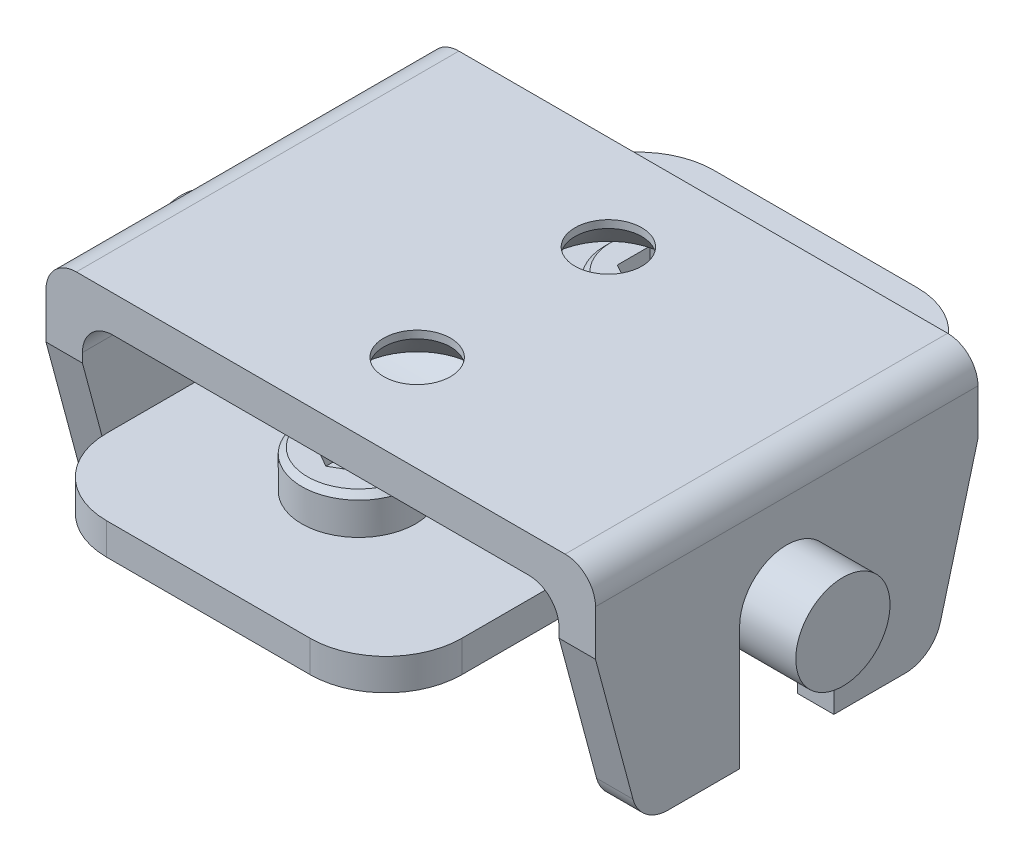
ISO-10303-21;
HEADER;
FILE_DESCRIPTION(('STEP AP214'),'2;1');
FILE_NAME('part.step','',(''),(''),'','','');
FILE_SCHEMA(('AUTOMOTIVE_DESIGN { 1 0 10303 214 1 1 1 1 }'));
ENDSEC;
DATA;
#1=APPLICATION_CONTEXT('core data for automotive mechanical design processes');
#2=APPLICATION_PROTOCOL_DEFINITION('international standard','automotive_design',2000,#1);
#3=PRODUCT_CONTEXT('',#1,'mechanical');
#4=PRODUCT('Part','Part','',(#3));
#5=PRODUCT_RELATED_PRODUCT_CATEGORY('part','',(#4));
#6=PRODUCT_DEFINITION_FORMATION('','',#4);
#7=PRODUCT_DEFINITION_CONTEXT('part definition',#1,'design');
#8=PRODUCT_DEFINITION('design','',#6,#7);
#9=PRODUCT_DEFINITION_SHAPE('','',#8);
#10=(LENGTH_UNIT() NAMED_UNIT(*) SI_UNIT(.MILLI.,.METRE.));
#11=(NAMED_UNIT(*) PLANE_ANGLE_UNIT() SI_UNIT($,.RADIAN.));
#12=(NAMED_UNIT(*) SI_UNIT($,.STERADIAN.) SOLID_ANGLE_UNIT());
#13=UNCERTAINTY_MEASURE_WITH_UNIT(LENGTH_MEASURE(1.E-05),#10,'distance_accuracy_value','');
#14=(GEOMETRIC_REPRESENTATION_CONTEXT(3) GLOBAL_UNCERTAINTY_ASSIGNED_CONTEXT((#13)) GLOBAL_UNIT_ASSIGNED_CONTEXT((#10,
#11,#12)) REPRESENTATION_CONTEXT('',''));
#15=CARTESIAN_POINT('',(0.,0.,0.));
#16=DIRECTION('',(0.,0.,1.));
#17=DIRECTION('',(1.,0.,0.));
#18=AXIS2_PLACEMENT_3D('',#15,#16,#17);
#19=CARTESIAN_POINT('',(27.686,0.65405,0.));
#20=DIRECTION('',(1.,0.,0.));
#21=DIRECTION('',(0.,0.,-1.));
#22=AXIS2_PLACEMENT_3D('',#19,#20,#21);
#23=PLANE('',#22);
#24=CARTESIAN_POINT('',(27.686,0.65405,0.));
#25=DIRECTION('',(1.,0.,0.));
#26=DIRECTION('',(0.,0.,-1.));
#27=AXIS2_PLACEMENT_3D('',#24,#25,#26);
#28=CIRCLE('',#27,3.94335);
#29=CARTESIAN_POINT('',(27.686,0.65405,-3.94335));
#30=VERTEX_POINT('',#29);
#31=EDGE_CURVE('P0_E489',#30,#30,#28,.T.);
#32=ORIENTED_EDGE('',*,*,#31,.T.);
#33=EDGE_LOOP('',(#32));
#34=FACE_BOUND('',#33,.T.);
#35=ADVANCED_FACE('P0_F15',(#34),#23,.T.);
#36=CARTESIAN_POINT('',(-27.686,0.65405,0.));
#37=DIRECTION('',(1.,0.,0.));
#38=DIRECTION('',(0.,0.,-1.));
#39=AXIS2_PLACEMENT_3D('',#36,#37,#38);
#40=PLANE('',#39);
#41=CARTESIAN_POINT('',(-27.686,0.65405,0.));
#42=DIRECTION('',(1.,0.,0.));
#43=DIRECTION('',(0.,0.,-1.));
#44=AXIS2_PLACEMENT_3D('',#41,#42,#43);
#45=CIRCLE('',#44,3.94335);
#46=CARTESIAN_POINT('',(-27.686,0.65405,-3.94335000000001));
#47=VERTEX_POINT('',#46);
#48=EDGE_CURVE('P0_E500',#47,#47,#45,.T.);
#49=ORIENTED_EDGE('',*,*,#48,.F.);
#50=EDGE_LOOP('',(#49));
#51=FACE_BOUND('',#50,.T.);
#52=ADVANCED_FACE('P0_F528',(#51),#40,.F.);
#53=CARTESIAN_POINT('',(-17.145,-1.524,12.7));
#54=DIRECTION('',(-1.,0.,0.));
#55=DIRECTION('',(0.,0.,1.));
#56=AXIS2_PLACEMENT_3D('',#53,#54,#55);
#57=PLANE('',#56);
#58=CARTESIAN_POINT('',(-17.145,0.65405,0.));
#59=DIRECTION('',(-1.,0.,0.));
#60=DIRECTION('',(0.,0.,1.));
#61=AXIS2_PLACEMENT_3D('',#58,#59,#60);
#62=CIRCLE('',#61,3.94335);
#63=CARTESIAN_POINT('',(-17.145,-1.524,3.28726442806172));
#64=VERTEX_POINT('',#63);
#65=CARTESIAN_POINT('',(-17.145,-1.524,-3.28726442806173));
#66=VERTEX_POINT('',#65);
#67=EDGE_CURVE('P0_E503',#64,#66,#62,.F.);
#68=ORIENTED_EDGE('',*,*,#67,.T.);
#69=DIRECTION('',(0.,0.,-1.));
#70=VECTOR('',#69,1.);
#71=CARTESIAN_POINT('',(-17.145,-1.524,12.7));
#72=LINE('',#71,#70);
#73=EDGE_CURVE('P0_E485',#64,#66,#72,.T.);
#74=ORIENTED_EDGE('',*,*,#73,.F.);
#75=EDGE_LOOP('',(#68,#74));
#76=FACE_BOUND('',#75,.T.);
#77=ADVANCED_FACE('P0_F522',(#76),#57,.F.);
#78=CARTESIAN_POINT('',(-15.621,-1.524,12.7));
#79=DIRECTION('',(0.,0.,-1.));
#80=DIRECTION('',(-1.,0.,0.));
#81=AXIS2_PLACEMENT_3D('',#78,#79,#80);
#82=CYLINDRICAL_SURFACE('',#81,1.524);
#83=CARTESIAN_POINT('',(-17.145,-1.524,3.28726442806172));
#84=CARTESIAN_POINT('',(-17.1450005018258,-1.57802279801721,3.25147056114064));
#85=CARTESIAN_POINT('',(-17.1421269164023,-1.63115290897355,3.21434522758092));
#86=CARTESIAN_POINT('',(-17.1312034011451,-1.73518733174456,3.13779184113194));
#87=CARTESIAN_POINT('',(-17.1231503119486,-1.78609026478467,3.09836239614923));
#88=CARTESIAN_POINT('',(-17.0919888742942,-1.93521669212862,2.97693026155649));
#89=CARTESIAN_POINT('',(-17.061882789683,-2.02963407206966,2.89193287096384));
#90=CARTESIAN_POINT('',(-17.000936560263,-2.17360046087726,2.74963989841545));
#91=CARTESIAN_POINT('',(-16.9745796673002,-2.22672617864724,2.69386922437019));
#92=CARTESIAN_POINT('',(-16.9167327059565,-2.32840618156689,2.5808386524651));
#93=CARTESIAN_POINT('',(-16.8852436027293,-2.37696132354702,2.52357903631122));
#94=CARTESIAN_POINT('',(-16.817586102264,-2.46954393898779,2.40804047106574));
#95=CARTESIAN_POINT('',(-16.7814115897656,-2.51356535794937,2.34976027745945));
#96=CARTESIAN_POINT('',(-16.7046958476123,-2.59702665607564,2.2328623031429));
#97=CARTESIAN_POINT('',(-16.6641561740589,-2.63646815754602,2.17424464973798));
#98=CARTESIAN_POINT('',(-16.5607307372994,-2.72649445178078,2.03262852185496));
#99=CARTESIAN_POINT('',(-16.4956197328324,-2.77478521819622,1.9497491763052));
#100=CARTESIAN_POINT('',(-16.390513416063,-2.84009487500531,1.82840876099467));
#101=CARTESIAN_POINT('',(-16.3543055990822,-2.86064819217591,1.78852344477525));
#102=CARTESIAN_POINT('',(-16.2789380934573,-2.89931511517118,1.71040753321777));
#103=CARTESIAN_POINT('',(-16.2397806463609,-2.91743054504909,1.67217571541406));
#104=CARTESIAN_POINT('',(-16.1659702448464,-2.94767182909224,1.60582185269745));
#105=CARTESIAN_POINT('',(-16.1319664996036,-2.96027277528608,1.57719964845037));
#106=CARTESIAN_POINT('',(-16.0610323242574,-2.98356997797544,1.52269764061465));
#107=CARTESIAN_POINT('',(-16.0240954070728,-2.99426183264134,1.49682422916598));
#108=CARTESIAN_POINT('',(-15.9461935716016,-3.01345094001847,1.44917652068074));
#109=CARTESIAN_POINT('',(-15.9051740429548,-3.02191068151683,1.42747377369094));
#110=CARTESIAN_POINT('',(-15.8194965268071,-3.03562972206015,1.39163569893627));
#111=CARTESIAN_POINT('',(-15.7748609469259,-3.04090724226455,1.37745734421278));
#112=CARTESIAN_POINT('',(-15.6990408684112,-3.04629880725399,1.36288863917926));
#113=CARTESIAN_POINT('',(-15.6685349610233,-3.04756666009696,1.35942751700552));
#114=CARTESIAN_POINT('',(-15.6073415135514,-3.04824507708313,1.35757963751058));
#115=CARTESIAN_POINT('',(-15.5766540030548,-3.04765593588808,1.3591920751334));
#116=CARTESIAN_POINT('',(-15.5161659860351,-3.04469117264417,1.36723773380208));
#117=CARTESIAN_POINT('',(-15.4863622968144,-3.04232306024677,1.37365068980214));
#118=CARTESIAN_POINT('',(-15.4280865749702,-3.03602580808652,1.39047846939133));
#119=CARTESIAN_POINT('',(-15.3996161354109,-3.03209485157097,1.40089794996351));
#120=CARTESIAN_POINT('',(-15.3230285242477,-3.01940985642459,1.4339463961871));
#121=CARTESIAN_POINT('',(-15.2765619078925,-3.00926758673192,1.45981495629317));
#122=CARTESIAN_POINT('',(-15.1880085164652,-2.98591875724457,1.51710384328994));
#123=CARTESIAN_POINT('',(-15.1459407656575,-2.97269962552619,1.54854681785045));
#124=CARTESIAN_POINT('',(-15.0620519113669,-2.94255423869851,1.61739774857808));
#125=CARTESIAN_POINT('',(-15.0205414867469,-2.92541127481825,1.65508422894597));
#126=CARTESIAN_POINT('',(-14.9408428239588,-2.88851125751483,1.73266309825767));
#127=CARTESIAN_POINT('',(-14.9026582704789,-2.86875136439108,1.77255785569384));
#128=CARTESIAN_POINT('',(-14.8290229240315,-2.82674577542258,1.85368868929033));
#129=CARTESIAN_POINT('',(-14.7935774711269,-2.80449542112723,1.89492717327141));
#130=CARTESIAN_POINT('',(-14.7251688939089,-2.75760499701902,1.97810563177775));
#131=CARTESIAN_POINT('',(-14.6922063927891,-2.73296433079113,2.0200457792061));
#132=CARTESIAN_POINT('',(-14.6138997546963,-2.66938891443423,2.12366889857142));
#133=CARTESIAN_POINT('',(-14.5698671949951,-2.62910793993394,2.18552513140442));
#134=CARTESIAN_POINT('',(-14.4866172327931,-2.54346865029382,2.30901242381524));
#135=CARTESIAN_POINT('',(-14.4474021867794,-2.49810787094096,2.3706433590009));
#136=CARTESIAN_POINT('',(-14.3741393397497,-2.40237284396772,2.49284946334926));
#137=CARTESIAN_POINT('',(-14.3400809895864,-2.3520091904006,2.55342655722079));
#138=CARTESIAN_POINT('',(-14.2775769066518,-2.24619483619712,2.67300718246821));
#139=CARTESIAN_POINT('',(-14.2491308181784,-2.19074445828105,2.7320108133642));
#140=CARTESIAN_POINT('',(-14.1884245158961,-2.05142700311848,2.87116706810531));
#141=CARTESIAN_POINT('',(-14.1592412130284,-1.96510861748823,2.95026816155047));
#142=CARTESIAN_POINT('',(-14.1163616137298,-1.78345678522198,3.10201835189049));
#143=CARTESIAN_POINT('',(-14.1026417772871,-1.68813728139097,3.17467710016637));
#144=CARTESIAN_POINT('',(-14.0949592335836,-1.50914296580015,3.29850508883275));
#145=CARTESIAN_POINT('',(-14.0977727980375,-1.42663849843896,3.35114856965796));
#146=CARTESIAN_POINT('',(-14.1178198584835,-1.25919771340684,3.44947716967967));
#147=CARTESIAN_POINT('',(-14.1350470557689,-1.17426247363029,3.49516531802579));
#148=CARTESIAN_POINT('',(-14.1855332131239,-1.00447862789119,3.57887005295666));
#149=CARTESIAN_POINT('',(-14.2189057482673,-0.919634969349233,3.61682954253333));
#150=CARTESIAN_POINT('',(-14.3021558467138,-0.754757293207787,3.68418249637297));
#151=CARTESIAN_POINT('',(-14.3520242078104,-0.674720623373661,3.71358071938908));
#152=CARTESIAN_POINT('',(-14.4601962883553,-0.533005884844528,3.76109256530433));
#153=CARTESIAN_POINT('',(-14.5167237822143,-0.470279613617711,3.78014631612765));
#154=CARTESIAN_POINT('',(-14.6402543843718,-0.354437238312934,3.81268775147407));
#155=CARTESIAN_POINT('',(-14.70725552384,-0.301319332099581,3.82617648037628));
#156=CARTESIAN_POINT('',(-14.8468245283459,-0.20872050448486,3.8480926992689));
#157=CARTESIAN_POINT('',(-14.9190551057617,-0.16877277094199,3.85670374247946));
#158=CARTESIAN_POINT('',(-15.0692865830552,-0.100982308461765,3.87054740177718));
#159=CARTESIAN_POINT('',(-15.1472874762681,-0.0731395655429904,3.87578002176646));
#160=CARTESIAN_POINT('',(-15.3077682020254,-0.0302002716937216,3.88359331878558));
#161=CARTESIAN_POINT('',(-15.3902877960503,-0.0152469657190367,3.88614426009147));
#162=CARTESIAN_POINT('',(-15.5567039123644,0.000936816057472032,3.88889710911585));
#163=CARTESIAN_POINT('',(-15.6406005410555,0.0021662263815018,3.88909883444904));
#164=CARTESIAN_POINT('',(-15.8082416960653,-0.00919254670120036,3.88717788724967));
#165=CARTESIAN_POINT('',(-15.8919769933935,-0.021913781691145,3.88503283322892));
#166=CARTESIAN_POINT('',(-16.0560883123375,-0.0609933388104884,3.87802945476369));
#167=CARTESIAN_POINT('',(-16.1364643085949,-0.0873517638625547,3.87317110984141));
#168=CARTESIAN_POINT('',(-16.2913822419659,-0.152789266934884,3.86006796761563));
#169=CARTESIAN_POINT('',(-16.3659353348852,-0.191843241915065,3.85182984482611));
#170=CARTESIAN_POINT('',(-16.5071952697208,-0.281333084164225,3.83107921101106));
#171=CARTESIAN_POINT('',(-16.5739035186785,-0.33176690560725,3.81856746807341));
#172=CARTESIAN_POINT('',(-16.6967717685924,-0.441418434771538,3.78855347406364));
#173=CARTESIAN_POINT('',(-16.7530572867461,-0.500513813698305,3.77111801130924));
#174=CARTESIAN_POINT('',(-16.8547307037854,-0.625676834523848,3.73049954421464));
#175=CARTESIAN_POINT('',(-16.9001193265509,-0.691744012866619,3.70731692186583));
#176=CARTESIAN_POINT('',(-16.9791229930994,-0.828101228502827,3.65493563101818));
#177=CARTESIAN_POINT('',(-17.0127672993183,-0.898380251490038,3.62575220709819));
#178=CARTESIAN_POINT('',(-17.0683755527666,-1.0407591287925,3.56142201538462));
#179=CARTESIAN_POINT('',(-17.0903414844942,-1.11285867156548,3.52627626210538));
#180=CARTESIAN_POINT('',(-17.1198671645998,-1.24213494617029,3.45813793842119));
#181=CARTESIAN_POINT('',(-17.1294367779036,-1.29939405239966,3.42613609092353));
#182=CARTESIAN_POINT('',(-17.1420024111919,-1.41274555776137,3.35897336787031));
#183=CARTESIAN_POINT('',(-17.1449994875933,-1.46883814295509,3.32381300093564));
#184=CARTESIAN_POINT('',(-17.145,-1.524,3.28726442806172));
#185=B_SPLINE_CURVE_WITH_KNOTS('',3,(#83,#84,#85,#86,#87,#88,#89,#90,#91,#92,#93,#94,#95,#96,
#97,#98,#99,#100,#101,#102,#103,#104,#105,#106,#107,#108,#109,#110,#111,#112,#113,#114,#115,
#116,#117,#118,#119,#120,#121,#122,#123,#124,#125,#126,#127,#128,#129,#130,#131,#132,#133,#134,
#135,#136,#137,#138,#139,#140,#141,#142,#143,#144,#145,#146,#147,#148,#149,#150,#151,#152,#153,
#154,#155,#156,#157,#158,#159,#160,#161,#162,#163,#164,#165,#166,#167,#168,#169,#170,#171,#172,
#173,#174,#175,#176,#177,#178,#179,#180,#181,#182,#183,#184),.UNSPECIFIED.,.T.,.F.,(4,2,2,2,2,2,
2,2,2,2,2,2,2,2,2,2,2,2,2,2,2,2,2,2,2,2,2,2,2,2,2,2,2,2,2,2,2,2,2,2,2,2,2,2,2,2,2,2,2,2,4),(0.,
0.194323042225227,0.388764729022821,0.778443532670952,1.02242277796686,1.2663561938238,
1.51061125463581,1.75477952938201,2.10168398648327,2.27455156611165,2.44728907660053,
2.58573100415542,2.72448813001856,2.86544678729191,3.00559046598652,3.09733240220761,
3.1890597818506,3.28040210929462,3.37185093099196,3.53332951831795,3.69547985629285,
3.87109769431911,4.04690768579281,4.22305220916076,4.39924079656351,4.65679189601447,
4.91446847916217,5.17161059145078,5.42873640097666,5.78940454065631,6.14952289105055,
6.44207950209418,6.73450833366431,7.02902485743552,7.32337736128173,7.58174930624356,
7.84007274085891,8.08788862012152,8.33570421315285,8.58623961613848,8.83679446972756,
9.08975988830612,9.34272721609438,9.59519736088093,9.84762215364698,10.0967750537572,
10.3459113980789,10.5944224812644,10.8428913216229,11.0413435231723,11.2397638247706),.UNSPECIFIED.);
#186=CARTESIAN_POINT('',(-15.621,0.,3.88873087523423));
#187=VERTEX_POINT('',#186);
#188=EDGE_CURVE('P0_E511',#187,#64,#185,.T.);
#189=ORIENTED_EDGE('',*,*,#188,.T.);
#190=ORIENTED_EDGE('',*,*,#73,.T.);
#191=CARTESIAN_POINT('',(-17.145,-1.524,-3.28726442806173));
#192=CARTESIAN_POINT('',(-17.1449983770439,-1.4451607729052,-3.33950063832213));
#193=CARTESIAN_POINT('',(-17.1388749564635,-1.36440339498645,-3.38890011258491));
#194=CARTESIAN_POINT('',(-17.1127130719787,-1.20122339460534,-3.48090903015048));
#195=CARTESIAN_POINT('',(-17.0926784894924,-1.11880124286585,-3.52352036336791));
#196=CARTESIAN_POINT('',(-17.0373850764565,-0.954830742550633,-3.60136040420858));
#197=CARTESIAN_POINT('',(-17.0020332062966,-0.873290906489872,-3.63654200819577));
#198=CARTESIAN_POINT('',(-16.915930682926,-0.71542115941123,-3.69888686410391));
#199=CARTESIAN_POINT('',(-16.8651864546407,-0.639089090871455,-3.72605345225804));
#200=CARTESIAN_POINT('',(-16.7552620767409,-0.502770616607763,-3.77046488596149));
#201=CARTESIAN_POINT('',(-16.6974500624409,-0.441912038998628,-3.78843433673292));
#202=CARTESIAN_POINT('',(-16.5717956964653,-0.329999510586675,-3.81903494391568));
#203=CARTESIAN_POINT('',(-16.5039546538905,-0.278944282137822,-3.83166679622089));
#204=CARTESIAN_POINT('',(-16.3626125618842,-0.190084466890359,-3.85220279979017));
#205=CARTESIAN_POINT('',(-16.2893695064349,-0.151900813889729,-3.86024818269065));
#206=CARTESIAN_POINT('',(-16.1374354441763,-0.0878005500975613,-3.87307890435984));
#207=CARTESIAN_POINT('',(-16.0587443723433,-0.0618840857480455,-3.87786420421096));
#208=CARTESIAN_POINT('',(-15.8971273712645,-0.0228926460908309,-3.88486285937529));
#209=CARTESIAN_POINT('',(-15.8141618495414,-0.00997610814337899,-3.88704454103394));
#210=CARTESIAN_POINT('',(-15.6472041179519,0.00207192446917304,-3.88908366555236));
#211=CARTESIAN_POINT('',(-15.5632118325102,0.00120239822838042,-3.88894093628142));
#212=CARTESIAN_POINT('',(-15.395806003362,-0.0143670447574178,-3.88629517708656));
#213=CARTESIAN_POINT('',(-15.3124040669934,-0.0291886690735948,-3.88377137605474));
#214=CARTESIAN_POINT('',(-15.1493184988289,-0.0723777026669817,-3.875924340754));
#215=CARTESIAN_POINT('',(-15.0696348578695,-0.10074507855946,-3.8706011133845));
#216=CARTESIAN_POINT('',(-14.9165155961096,-0.169999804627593,-3.85644785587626));
#217=CARTESIAN_POINT('',(-14.8430626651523,-0.21085091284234,-3.84762795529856));
#218=CARTESIAN_POINT('',(-14.7043020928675,-0.303670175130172,-3.82557797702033));
#219=CARTESIAN_POINT('',(-14.6389929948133,-0.355636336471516,-3.81234868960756));
#220=CARTESIAN_POINT('',(-14.5191691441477,-0.467970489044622,-3.78079715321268));
#221=CARTESIAN_POINT('',(-14.4645216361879,-0.528216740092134,-3.76254542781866));
#222=CARTESIAN_POINT('',(-14.3662651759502,-0.655284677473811,-3.72023208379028));
#223=CARTESIAN_POINT('',(-14.3226548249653,-0.722105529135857,-3.69617120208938));
#224=CARTESIAN_POINT('',(-14.2471330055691,-0.859747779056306,-3.64196253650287));
#225=CARTESIAN_POINT('',(-14.2152225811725,-0.930569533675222,-3.6118142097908));
#226=CARTESIAN_POINT('',(-14.1630551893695,-1.07368768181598,-3.54558242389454));
#227=CARTESIAN_POINT('',(-14.1428012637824,-1.14598445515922,-3.50949741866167));
#228=CARTESIAN_POINT('',(-14.1123109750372,-1.29470169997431,-3.42928263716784));
#229=CARTESIAN_POINT('',(-14.1028391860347,-1.37107283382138,-3.38477522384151));
#230=CARTESIAN_POINT('',(-14.0951520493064,-1.52099560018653,-3.29044926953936));
#231=CARTESIAN_POINT('',(-14.0969413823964,-1.59454604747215,-3.24062852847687));
#232=CARTESIAN_POINT('',(-14.1134340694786,-1.77073853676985,-3.11241575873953));
#233=CARTESIAN_POINT('',(-14.1337493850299,-1.87102622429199,-3.03150086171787));
#234=CARTESIAN_POINT('',(-14.1911876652,-2.06074298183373,-2.86288698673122));
#235=CARTESIAN_POINT('',(-14.2283628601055,-2.15013720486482,-2.77516763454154));
#236=CARTESIAN_POINT('',(-14.3009777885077,-2.28813692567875,-2.62677826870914));
#237=CARTESIAN_POINT('',(-14.3325445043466,-2.34013312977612,-2.56728292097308));
#238=CARTESIAN_POINT('',(-14.4008569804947,-2.43912002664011,-2.44711319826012));
#239=CARTESIAN_POINT('',(-14.43760244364,-2.48611100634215,-2.38643889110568));
#240=CARTESIAN_POINT('',(-14.5158195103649,-2.57502449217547,-2.26467668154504));
#241=CARTESIAN_POINT('',(-14.5572816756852,-2.61695678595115,-2.20358982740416));
#242=CARTESIAN_POINT('',(-14.6449052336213,-2.69587578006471,-2.08165098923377));
#243=CARTESIAN_POINT('',(-14.6910637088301,-2.73286551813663,-2.02079888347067));
#244=CARTESIAN_POINT('',(-14.7800545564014,-2.79593828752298,-1.91073079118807));
#245=CARTESIAN_POINT('',(-14.8220893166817,-2.82280236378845,-1.86131671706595));
#246=CARTESIAN_POINT('',(-14.9102724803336,-2.87308292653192,-1.7641800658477));
#247=CARTESIAN_POINT('',(-14.9564288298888,-2.89649251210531,-1.71646101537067));
#248=CARTESIAN_POINT('',(-15.0542673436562,-2.93973193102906,-1.62399783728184));
#249=CARTESIAN_POINT('',(-15.1060033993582,-2.95952073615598,-1.57929104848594));
#250=CARTESIAN_POINT('',(-15.2162718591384,-2.99440605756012,-1.49690857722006));
#251=CARTESIAN_POINT('',(-15.2747673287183,-3.0095265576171,-1.45919736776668));
#252=CARTESIAN_POINT('',(-15.367089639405,-3.02699896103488,-1.41426368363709));
#253=CARTESIAN_POINT('',(-15.3976550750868,-3.03187915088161,-1.40145112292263));
#254=CARTESIAN_POINT('',(-15.4605082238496,-3.03985585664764,-1.38028793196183));
#255=CARTESIAN_POINT('',(-15.4927925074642,-3.04295578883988,-1.37192875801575));
#256=CARTESIAN_POINT('',(-15.5588321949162,-3.0470930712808,-1.36073119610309));
#257=CARTESIAN_POINT('',(-15.592599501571,-3.04810838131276,-1.35795180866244));
#258=CARTESIAN_POINT('',(-15.6600703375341,-3.04787294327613,-1.35859317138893));
#259=CARTESIAN_POINT('',(-15.6937738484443,-3.0466216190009,-1.36201549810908));
#260=CARTESIAN_POINT('',(-15.7633141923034,-3.041781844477,-1.37509487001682));
#261=CARTESIAN_POINT('',(-15.799017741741,-3.03796792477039,-1.38535252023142));
#262=CARTESIAN_POINT('',(-15.868208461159,-3.02822469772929,-1.41104609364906));
#263=CARTESIAN_POINT('',(-15.9016896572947,-3.0222899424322,-1.42649534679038));
#264=CARTESIAN_POINT('',(-15.990674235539,-3.00362212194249,-1.47393219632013));
#265=CARTESIAN_POINT('',(-16.0437912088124,-2.98913385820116,-1.50961685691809));
#266=CARTESIAN_POINT('',(-16.1444217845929,-2.95627619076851,-1.58661134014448));
#267=CARTESIAN_POINT('',(-16.1919146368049,-2.93789307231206,-1.62794085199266));
#268=CARTESIAN_POINT('',(-16.2870623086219,-2.89582320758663,-1.71788029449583));
#269=CARTESIAN_POINT('',(-16.3342622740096,-2.87179061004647,-1.76680537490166));
#270=CARTESIAN_POINT('',(-16.4244967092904,-2.82002220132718,-1.86654811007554));
#271=CARTESIAN_POINT('',(-16.4675268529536,-2.79228261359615,-1.91736765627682));
#272=CARTESIAN_POINT('',(-16.5499910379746,-2.73318387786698,-2.01994181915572));
#273=CARTESIAN_POINT('',(-16.5894201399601,-2.70181988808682,-2.07169760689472));
#274=CARTESIAN_POINT('',(-16.6648423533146,-2.63552579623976,-2.17542948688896));
#275=CARTESIAN_POINT('',(-16.7008350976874,-2.60059531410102,-2.22740560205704));
#276=CARTESIAN_POINT('',(-16.7727702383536,-2.52352266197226,-2.33621653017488));
#277=CARTESIAN_POINT('',(-16.808357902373,-2.48100901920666,-2.39302521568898));
#278=CARTESIAN_POINT('',(-16.8751478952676,-2.39164257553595,-2.50578552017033));
#279=CARTESIAN_POINT('',(-16.9063489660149,-2.34478853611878,-2.56173688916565));
#280=CARTESIAN_POINT('',(-16.9925919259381,-2.19792176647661,-2.72724593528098));
#281=CARTESIAN_POINT('',(-17.0405904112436,-2.09127216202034,-2.8349369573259));
#282=CARTESIAN_POINT('',(-17.0979991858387,-1.90661869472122,-3.00030618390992));
#283=CARTESIAN_POINT('',(-17.1151593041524,-1.8337139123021,-3.06107869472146));
#284=CARTESIAN_POINT('',(-17.1386587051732,-1.68253418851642,-3.17796789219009));
#285=CARTESIAN_POINT('',(-17.1450016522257,-1.60426107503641,-3.23408614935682));
#286=CARTESIAN_POINT('',(-17.145,-1.524,-3.28726442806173));
#287=B_SPLINE_CURVE_WITH_KNOTS('',3,(#191,#192,#193,#194,#195,#196,#197,#198,#199,#200,#201,
#202,#203,#204,#205,#206,#207,#208,#209,#210,#211,#212,#213,#214,#215,#216,#217,#218,#219,#220,
#221,#222,#223,#224,#225,#226,#227,#228,#229,#230,#231,#232,#233,#234,#235,#236,#237,#238,#239,
#240,#241,#242,#243,#244,#245,#246,#247,#248,#249,#250,#251,#252,#253,#254,#255,#256,#257,#258,
#259,#260,#261,#262,#263,#264,#265,#266,#267,#268,#269,#270,#271,#272,#273,#274,#275,#276,#277,
#278,#279,#280,#281,#282,#283,#284,#285,#286),.UNSPECIFIED.,.T.,.F.,(4,2,2,2,2,2,2,2,2,2,2,2,2,
2,2,2,2,2,2,2,2,2,2,2,2,2,2,2,2,2,2,2,2,2,2,2,2,2,2,2,2,2,2,2,2,2,2,4),(0.,0.283451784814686,
0.566824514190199,0.851943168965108,1.13694297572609,1.39318121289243,1.64938603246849,
1.89720356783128,2.14502406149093,2.39582958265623,2.64665367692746,2.89968624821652,
3.15271819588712,3.4050224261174,3.6572814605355,3.90616474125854,4.15501646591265,
4.40389039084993,4.65282923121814,4.91849540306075,5.1842720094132,5.57348923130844,
5.96392053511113,6.21888848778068,6.47384181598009,6.7282936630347,6.98258839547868,
7.1930604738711,7.40394747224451,7.61709327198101,7.82912506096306,7.9293250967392,
8.02933220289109,8.13039132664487,8.23147614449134,8.34287653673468,8.45456517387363,
8.65029623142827,8.84672831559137,9.06272185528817,9.27893714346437,9.49544468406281,
9.71197532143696,9.94985127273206,10.1877953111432,10.6617150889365,10.9503766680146,
11.2389404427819),.UNSPECIFIED.);
#288=CARTESIAN_POINT('',(-15.621,0.,-3.88873087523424));
#289=VERTEX_POINT('',#288);
#290=EDGE_CURVE('P0_E505',#66,#289,#287,.T.);
#291=ORIENTED_EDGE('',*,*,#290,.T.);
#292=DIRECTION('',(0.,0.,-1.));
#293=VECTOR('',#292,1.);
#294=CARTESIAN_POINT('',(-15.621,0.,12.7));
#295=LINE('',#294,#293);
#296=EDGE_CURVE('P0_E493',#187,#289,#295,.T.);
#297=ORIENTED_EDGE('',*,*,#296,.F.);
#298=EDGE_LOOP('',(#189,#190,#291,#297));
#299=FACE_BOUND('',#298,.T.);
#300=ADVANCED_FACE('P0_F516',(#299),#82,.F.);
#301=CARTESIAN_POINT('',(15.621,0.,12.7));
#302=DIRECTION('',(0.,1.,0.));
#303=DIRECTION('',(1.,0.,0.));
#304=AXIS2_PLACEMENT_3D('',#301,#302,#303);
#305=PLANE('',#304);
#306=DIRECTION('',(1.,0.,0.));
#307=VECTOR('',#306,1.);
#308=CARTESIAN_POINT('',(-27.686,0.,3.88873087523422));
#309=LINE('',#308,#307);
#310=CARTESIAN_POINT('',(15.621,0.,3.88873087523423));
#311=VERTEX_POINT('',#310);
#312=EDGE_CURVE('P0_E1040',#311,#187,#309,.F.);
#313=ORIENTED_EDGE('',*,*,#312,.T.);
#314=ORIENTED_EDGE('',*,*,#296,.T.);
#315=DIRECTION('',(1.,0.,0.));
#316=VECTOR('',#315,1.);
#317=CARTESIAN_POINT('',(-27.686,0.,-3.88873087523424));
#318=LINE('',#317,#316);
#319=CARTESIAN_POINT('',(15.621,0.,-3.88873087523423));
#320=VERTEX_POINT('',#319);
#321=EDGE_CURVE('P0_E1047',#289,#320,#318,.T.);
#322=ORIENTED_EDGE('',*,*,#321,.T.);
#323=DIRECTION('',(0.,0.,-1.));
#324=VECTOR('',#323,1.);
#325=CARTESIAN_POINT('',(15.621,0.,12.7));
#326=LINE('',#325,#324);
#327=EDGE_CURVE('P0_E490',#311,#320,#326,.T.);
#328=ORIENTED_EDGE('',*,*,#327,.F.);
#329=EDGE_LOOP('',(#313,#314,#322,#328));
#330=FACE_BOUND('',#329,.T.);
#331=ADVANCED_FACE('P0_F521',(#330),#305,.F.);
#332=CARTESIAN_POINT('',(15.621,-1.524,12.7));
#333=DIRECTION('',(0.,0.,-1.));
#334=DIRECTION('',(-1.,0.,0.));
#335=AXIS2_PLACEMENT_3D('',#332,#333,#334);
#336=CYLINDRICAL_SURFACE('',#335,1.524);
#337=CARTESIAN_POINT('',(14.097,-1.524,3.28726442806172));
#338=CARTESIAN_POINT('',(14.0969994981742,-1.57802279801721,3.25147056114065));
#339=CARTESIAN_POINT('',(14.0998730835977,-1.63115290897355,3.21434522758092));
#340=CARTESIAN_POINT('',(14.1107965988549,-1.73518733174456,3.13779184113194));
#341=CARTESIAN_POINT('',(14.1188496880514,-1.78609026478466,3.09836239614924));
#342=CARTESIAN_POINT('',(14.1500111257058,-1.93521669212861,2.9769302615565));
#343=CARTESIAN_POINT('',(14.180117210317,-2.02963407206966,2.89193287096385));
#344=CARTESIAN_POINT('',(14.241063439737,-2.17360046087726,2.74963989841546));
#345=CARTESIAN_POINT('',(14.2674203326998,-2.22672617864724,2.69386922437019));
#346=CARTESIAN_POINT('',(14.3252672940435,-2.32840618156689,2.5808386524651));
#347=CARTESIAN_POINT('',(14.3567563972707,-2.37696132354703,2.52357903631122));
#348=CARTESIAN_POINT('',(14.424413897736,-2.46954393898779,2.40804047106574));
#349=CARTESIAN_POINT('',(14.4605884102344,-2.51356535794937,2.34976027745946));
#350=CARTESIAN_POINT('',(14.5373041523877,-2.59702665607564,2.2328623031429));
#351=CARTESIAN_POINT('',(14.5778438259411,-2.63646815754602,2.17424464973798));
#352=CARTESIAN_POINT('',(14.6812692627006,-2.72649445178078,2.03262852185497));
#353=CARTESIAN_POINT('',(14.7463802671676,-2.77478521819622,1.9497491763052));
#354=CARTESIAN_POINT('',(14.851486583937,-2.84009487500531,1.82840876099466));
#355=CARTESIAN_POINT('',(14.8876944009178,-2.86064819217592,1.78852344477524));
#356=CARTESIAN_POINT('',(14.9630619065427,-2.89931511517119,1.71040753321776));
#357=CARTESIAN_POINT('',(15.0022193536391,-2.91743054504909,1.67217571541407));
#358=CARTESIAN_POINT('',(15.0760297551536,-2.94767182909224,1.60582185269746));
#359=CARTESIAN_POINT('',(15.1100335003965,-2.96027277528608,1.57719964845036));
#360=CARTESIAN_POINT('',(15.1809676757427,-2.98356997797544,1.52269764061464));
#361=CARTESIAN_POINT('',(15.2179045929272,-2.99426183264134,1.49682422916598));
#362=CARTESIAN_POINT('',(15.2958064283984,-3.01345094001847,1.44917652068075));
#363=CARTESIAN_POINT('',(15.3368259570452,-3.02191068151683,1.42747377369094));
#364=CARTESIAN_POINT('',(15.4225034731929,-3.03562972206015,1.39163569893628));
#365=CARTESIAN_POINT('',(15.4671390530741,-3.04090724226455,1.37745734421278));
#366=CARTESIAN_POINT('',(15.5429591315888,-3.04629880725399,1.36288863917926));
#367=CARTESIAN_POINT('',(15.5734650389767,-3.04756666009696,1.35942751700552));
#368=CARTESIAN_POINT('',(15.6346584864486,-3.04824507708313,1.35757963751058));
#369=CARTESIAN_POINT('',(15.6653459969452,-3.04765593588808,1.3591920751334));
#370=CARTESIAN_POINT('',(15.7258340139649,-3.04469117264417,1.36723773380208));
#371=CARTESIAN_POINT('',(15.7556377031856,-3.04232306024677,1.37365068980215));
#372=CARTESIAN_POINT('',(15.8139134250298,-3.03602580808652,1.39047846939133));
#373=CARTESIAN_POINT('',(15.8423838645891,-3.03209485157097,1.40089794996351));
#374=CARTESIAN_POINT('',(15.9189714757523,-3.01940985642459,1.43394639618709));
#375=CARTESIAN_POINT('',(15.9654380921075,-3.00926758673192,1.45981495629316));
#376=CARTESIAN_POINT('',(16.0539914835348,-2.98591875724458,1.51710384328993));
#377=CARTESIAN_POINT('',(16.0960592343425,-2.9726996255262,1.54854681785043));
#378=CARTESIAN_POINT('',(16.179948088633,-2.94255423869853,1.61739774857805));
#379=CARTESIAN_POINT('',(16.221458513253,-2.92541127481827,1.65508422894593));
#380=CARTESIAN_POINT('',(16.3011571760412,-2.88851125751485,1.73266309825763));
#381=CARTESIAN_POINT('',(16.3393417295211,-2.8687513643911,1.77255785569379));
#382=CARTESIAN_POINT('',(16.4129770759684,-2.82674577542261,1.85368868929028));
#383=CARTESIAN_POINT('',(16.448422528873,-2.80449542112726,1.89492717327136));
#384=CARTESIAN_POINT('',(16.516831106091,-2.75760499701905,1.97810563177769));
#385=CARTESIAN_POINT('',(16.5497936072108,-2.73296433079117,2.02004577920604));
#386=CARTESIAN_POINT('',(16.6281002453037,-2.66938891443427,2.12366889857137));
#387=CARTESIAN_POINT('',(16.6721328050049,-2.62910793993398,2.18552513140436));
#388=CARTESIAN_POINT('',(16.7553827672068,-2.54346865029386,2.30901242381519));
#389=CARTESIAN_POINT('',(16.7945978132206,-2.498107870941,2.37064335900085));
#390=CARTESIAN_POINT('',(16.8678606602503,-2.40237284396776,2.49284946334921));
#391=CARTESIAN_POINT('',(16.9019190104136,-2.35200919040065,2.55342655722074));
#392=CARTESIAN_POINT('',(16.9644230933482,-2.24619483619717,2.67300718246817));
#393=CARTESIAN_POINT('',(16.9928691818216,-2.19074445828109,2.73201081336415));
#394=CARTESIAN_POINT('',(17.0535754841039,-2.05142700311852,2.87116706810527));
#395=CARTESIAN_POINT('',(17.0827587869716,-1.96510861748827,2.95026816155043));
#396=CARTESIAN_POINT('',(17.1256383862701,-1.78345678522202,3.10201835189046));
#397=CARTESIAN_POINT('',(17.1393582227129,-1.68813728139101,3.17467710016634));
#398=CARTESIAN_POINT('',(17.1470407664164,-1.50914296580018,3.29850508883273));
#399=CARTESIAN_POINT('',(17.1442272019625,-1.426638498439,3.35114856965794));
#400=CARTESIAN_POINT('',(17.1241801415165,-1.25919771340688,3.44947716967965));
#401=CARTESIAN_POINT('',(17.1069529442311,-1.17426247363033,3.49516531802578));
#402=CARTESIAN_POINT('',(17.0564667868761,-1.00447862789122,3.57887005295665));
#403=CARTESIAN_POINT('',(17.0230942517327,-0.919634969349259,3.61682954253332));
#404=CARTESIAN_POINT('',(16.9398441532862,-0.754757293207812,3.68418249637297));
#405=CARTESIAN_POINT('',(16.8899757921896,-0.674720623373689,3.71358071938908));
#406=CARTESIAN_POINT('',(16.7818037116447,-0.533005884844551,3.76109256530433));
#407=CARTESIAN_POINT('',(16.7252762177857,-0.470279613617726,3.78014631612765));
#408=CARTESIAN_POINT('',(16.6017456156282,-0.354437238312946,3.81268775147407));
#409=CARTESIAN_POINT('',(16.53474447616,-0.301319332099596,3.82617648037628));
#410=CARTESIAN_POINT('',(16.3951754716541,-0.208720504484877,3.8480926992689));
#411=CARTESIAN_POINT('',(16.3229448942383,-0.168772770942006,3.85670374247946));
#412=CARTESIAN_POINT('',(16.1727134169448,-0.100982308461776,3.87054740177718));
#413=CARTESIAN_POINT('',(16.094712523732,-0.073139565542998,3.87578002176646));
#414=CARTESIAN_POINT('',(15.9342317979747,-0.0302002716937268,3.88359331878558));
#415=CARTESIAN_POINT('',(15.8517122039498,-0.0152469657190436,3.88614426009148));
#416=CARTESIAN_POINT('',(15.6852960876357,0.000936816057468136,3.88889710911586));
#417=CARTESIAN_POINT('',(15.6013994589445,0.002166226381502,3.88909883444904));
#418=CARTESIAN_POINT('',(15.4337583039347,-0.00919254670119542,3.88717788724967));
#419=CARTESIAN_POINT('',(15.3500230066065,-0.0219137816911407,3.88503283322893));
#420=CARTESIAN_POINT('',(15.1859116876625,-0.0609933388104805,3.87802945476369));
#421=CARTESIAN_POINT('',(15.1055356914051,-0.0873517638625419,3.87317110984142));
#422=CARTESIAN_POINT('',(14.9506177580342,-0.152789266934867,3.86006796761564));
#423=CARTESIAN_POINT('',(14.8760646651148,-0.191843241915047,3.85182984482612));
#424=CARTESIAN_POINT('',(14.7348047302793,-0.281333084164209,3.83107921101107));
#425=CARTESIAN_POINT('',(14.6680964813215,-0.331766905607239,3.81856746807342));
#426=CARTESIAN_POINT('',(14.5452282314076,-0.441418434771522,3.78855347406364));
#427=CARTESIAN_POINT('',(14.488942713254,-0.500513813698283,3.77111801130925));
#428=CARTESIAN_POINT('',(14.3872692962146,-0.625676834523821,3.73049954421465));
#429=CARTESIAN_POINT('',(14.3418806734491,-0.691744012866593,3.70731692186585));
#430=CARTESIAN_POINT('',(14.2628770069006,-0.828101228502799,3.65493563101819));
#431=CARTESIAN_POINT('',(14.2292327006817,-0.898380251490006,3.62575220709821));
#432=CARTESIAN_POINT('',(14.1736244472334,-1.04075912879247,3.56142201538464));
#433=CARTESIAN_POINT('',(14.1516585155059,-1.11285867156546,3.52627626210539));
#434=CARTESIAN_POINT('',(14.1221328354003,-1.24213494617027,3.45813793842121));
#435=CARTESIAN_POINT('',(14.1125632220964,-1.29939405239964,3.42613609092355));
#436=CARTESIAN_POINT('',(14.099997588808,-1.41274555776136,3.35897336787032));
#437=CARTESIAN_POINT('',(14.0970005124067,-1.46883814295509,3.32381300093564));
#438=CARTESIAN_POINT('',(14.097,-1.524,3.28726442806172));
#439=B_SPLINE_CURVE_WITH_KNOTS('',3,(#337,#338,#339,#340,#341,#342,#343,#344,#345,#346,#347,
#348,#349,#350,#351,#352,#353,#354,#355,#356,#357,#358,#359,#360,#361,#362,#363,#364,#365,#366,
#367,#368,#369,#370,#371,#372,#373,#374,#375,#376,#377,#378,#379,#380,#381,#382,#383,#384,#385,
#386,#387,#388,#389,#390,#391,#392,#393,#394,#395,#396,#397,#398,#399,#400,#401,#402,#403,#404,
#405,#406,#407,#408,#409,#410,#411,#412,#413,#414,#415,#416,#417,#418,#419,#420,#421,#422,#423,
#424,#425,#426,#427,#428,#429,#430,#431,#432,#433,#434,#435,#436,#437,#438),.UNSPECIFIED.,.T.,
.F.,(4,2,2,2,2,2,2,2,2,2,2,2,2,2,2,2,2,2,2,2,2,2,2,2,2,2,2,2,2,2,2,2,2,2,2,2,2,2,2,2,2,2,2,2,2,
2,2,2,2,2,4),(0.,0.194323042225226,0.388764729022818,0.778443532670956,1.02242277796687,
1.26635619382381,1.5106112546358,1.754779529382,2.10168398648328,2.27455156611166,
2.44728907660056,2.58573100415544,2.72448813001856,2.8654467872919,3.00559046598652,
3.09733240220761,3.18905978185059,3.28040210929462,3.37185093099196,3.53332951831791,
3.69547985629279,3.87109769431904,4.04690768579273,4.22305220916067,4.39924079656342,
4.65679189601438,4.91446847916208,5.1716105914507,5.42873640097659,5.78940454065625,
6.1495228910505,6.44207950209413,6.73450833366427,7.02902485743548,7.32337736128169,
7.58174930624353,7.84007274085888,8.08788862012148,8.33570421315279,8.58623961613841,
8.83679446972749,9.08975988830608,9.34272721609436,9.59519736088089,9.84762215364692,
10.0967750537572,10.3459113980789,10.5944224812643,10.8428913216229,11.0413435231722,
11.2397638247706),.UNSPECIFIED.);
#440=CARTESIAN_POINT('',(17.145,-1.524,3.28726442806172));
#441=VERTEX_POINT('',#440);
#442=EDGE_CURVE('P0_E1059',#441,#311,#439,.T.);
#443=ORIENTED_EDGE('',*,*,#442,.T.);
#444=ORIENTED_EDGE('',*,*,#327,.T.);
#445=CARTESIAN_POINT('',(14.097,-1.524,-3.28726442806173));
#446=CARTESIAN_POINT('',(14.0970016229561,-1.4451607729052,-3.33950063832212));
#447=CARTESIAN_POINT('',(14.1031250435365,-1.36440339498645,-3.38890011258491));
#448=CARTESIAN_POINT('',(14.1292869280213,-1.20122339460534,-3.48090903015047));
#449=CARTESIAN_POINT('',(14.1493215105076,-1.11880124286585,-3.52352036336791));
#450=CARTESIAN_POINT('',(14.2046149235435,-0.954830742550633,-3.60136040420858));
#451=CARTESIAN_POINT('',(14.2399667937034,-0.873290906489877,-3.63654200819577));
#452=CARTESIAN_POINT('',(14.326069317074,-0.715421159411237,-3.69888686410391));
#453=CARTESIAN_POINT('',(14.3768135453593,-0.639089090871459,-3.72605345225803));
#454=CARTESIAN_POINT('',(14.4867379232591,-0.502770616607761,-3.77046488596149));
#455=CARTESIAN_POINT('',(14.5445499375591,-0.441912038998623,-3.78843433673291));
#456=CARTESIAN_POINT('',(14.6702043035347,-0.329999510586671,-3.81903494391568));
#457=CARTESIAN_POINT('',(14.7380453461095,-0.27894428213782,-3.83166679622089));
#458=CARTESIAN_POINT('',(14.8793874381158,-0.190084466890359,-3.85220279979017));
#459=CARTESIAN_POINT('',(14.9526304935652,-0.151900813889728,-3.86024818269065));
#460=CARTESIAN_POINT('',(15.1045645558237,-0.0878005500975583,-3.87307890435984));
#461=CARTESIAN_POINT('',(15.1832556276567,-0.0618840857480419,-3.87786420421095));
#462=CARTESIAN_POINT('',(15.3448726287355,-0.0228926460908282,-3.88486285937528));
#463=CARTESIAN_POINT('',(15.4278381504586,-0.00997610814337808,-3.88704454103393));
#464=CARTESIAN_POINT('',(15.5947958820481,0.00207192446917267,-3.88908366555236));
#465=CARTESIAN_POINT('',(15.6787881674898,0.00120239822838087,-3.88894093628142));
#466=CARTESIAN_POINT('',(15.846193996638,-0.0143670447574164,-3.88629517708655));
#467=CARTESIAN_POINT('',(15.9295959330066,-0.0291886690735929,-3.88377137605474));
#468=CARTESIAN_POINT('',(16.0926815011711,-0.0723777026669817,-3.875924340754));
#469=CARTESIAN_POINT('',(16.1723651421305,-0.100745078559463,-3.8706011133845));
#470=CARTESIAN_POINT('',(16.3254844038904,-0.169999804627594,-3.85644785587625));
#471=CARTESIAN_POINT('',(16.3989373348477,-0.210850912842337,-3.84762795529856));
#472=CARTESIAN_POINT('',(16.5376979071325,-0.303670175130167,-3.82557797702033));
#473=CARTESIAN_POINT('',(16.6030070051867,-0.355636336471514,-3.81234868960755));
#474=CARTESIAN_POINT('',(16.7228308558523,-0.467970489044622,-3.78079715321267));
#475=CARTESIAN_POINT('',(16.7774783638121,-0.528216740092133,-3.76254542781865));
#476=CARTESIAN_POINT('',(16.8757348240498,-0.655284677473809,-3.72023208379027));
#477=CARTESIAN_POINT('',(16.9193451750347,-0.722105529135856,-3.69617120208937));
#478=CARTESIAN_POINT('',(16.9948669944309,-0.859747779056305,-3.64196253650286));
#479=CARTESIAN_POINT('',(17.0267774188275,-0.93056953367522,-3.6118142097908));
#480=CARTESIAN_POINT('',(17.0789448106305,-1.07368768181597,-3.54558242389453));
#481=CARTESIAN_POINT('',(17.0991987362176,-1.14598445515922,-3.50949741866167));
#482=CARTESIAN_POINT('',(17.1296890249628,-1.29470169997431,-3.42928263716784));
#483=CARTESIAN_POINT('',(17.1391608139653,-1.37107283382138,-3.38477522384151));
#484=CARTESIAN_POINT('',(17.1468479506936,-1.52099560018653,-3.29044926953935));
#485=CARTESIAN_POINT('',(17.1450586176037,-1.59454604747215,-3.24062852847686));
#486=CARTESIAN_POINT('',(17.1285659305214,-1.77073853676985,-3.11241575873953));
#487=CARTESIAN_POINT('',(17.1082506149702,-1.87102622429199,-3.03150086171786));
#488=CARTESIAN_POINT('',(17.0508123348,-2.06074298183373,-2.86288698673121));
#489=CARTESIAN_POINT('',(17.0136371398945,-2.15013720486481,-2.77516763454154));
#490=CARTESIAN_POINT('',(16.9410222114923,-2.28813692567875,-2.62677826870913));
#491=CARTESIAN_POINT('',(16.9094554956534,-2.34013312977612,-2.56728292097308));
#492=CARTESIAN_POINT('',(16.8411430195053,-2.43912002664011,-2.44711319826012));
#493=CARTESIAN_POINT('',(16.80439755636,-2.48611100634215,-2.38643889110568));
#494=CARTESIAN_POINT('',(16.7261804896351,-2.57502449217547,-2.26467668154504));
#495=CARTESIAN_POINT('',(16.6847183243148,-2.61695678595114,-2.20358982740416));
#496=CARTESIAN_POINT('',(16.5970947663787,-2.69587578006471,-2.08165098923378));
#497=CARTESIAN_POINT('',(16.5509362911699,-2.73286551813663,-2.02079888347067));
#498=CARTESIAN_POINT('',(16.4619454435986,-2.79593828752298,-1.91073079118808));
#499=CARTESIAN_POINT('',(16.4199106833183,-2.82280236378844,-1.86131671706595));
#500=CARTESIAN_POINT('',(16.3317275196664,-2.87308292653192,-1.7641800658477));
#501=CARTESIAN_POINT('',(16.2855711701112,-2.89649251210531,-1.71646101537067));
#502=CARTESIAN_POINT('',(16.1877326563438,-2.93973193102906,-1.62399783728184));
#503=CARTESIAN_POINT('',(16.1359966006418,-2.95952073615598,-1.57929104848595));
#504=CARTESIAN_POINT('',(16.0257281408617,-2.99440605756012,-1.49690857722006));
#505=CARTESIAN_POINT('',(15.9672326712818,-3.0095265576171,-1.45919736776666));
#506=CARTESIAN_POINT('',(15.8749103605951,-3.02699896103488,-1.41426368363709));
#507=CARTESIAN_POINT('',(15.8443449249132,-3.03187915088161,-1.40145112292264));
#508=CARTESIAN_POINT('',(15.7814917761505,-3.03985585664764,-1.38028793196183));
#509=CARTESIAN_POINT('',(15.7492074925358,-3.04295578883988,-1.37192875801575));
#510=CARTESIAN_POINT('',(15.6831678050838,-3.0470930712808,-1.36073119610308));
#511=CARTESIAN_POINT('',(15.649400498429,-3.04810838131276,-1.35795180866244));
#512=CARTESIAN_POINT('',(15.5819296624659,-3.04787294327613,-1.35859317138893));
#513=CARTESIAN_POINT('',(15.5482261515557,-3.0466216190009,-1.36201549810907));
#514=CARTESIAN_POINT('',(15.4786858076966,-3.041781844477,-1.37509487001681));
#515=CARTESIAN_POINT('',(15.442982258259,-3.03796792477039,-1.38535252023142));
#516=CARTESIAN_POINT('',(15.373791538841,-3.02822469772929,-1.41104609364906));
#517=CARTESIAN_POINT('',(15.3403103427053,-3.0222899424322,-1.42649534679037));
#518=CARTESIAN_POINT('',(15.251325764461,-3.00362212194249,-1.47393219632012));
#519=CARTESIAN_POINT('',(15.1982087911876,-2.98913385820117,-1.50961685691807));
#520=CARTESIAN_POINT('',(15.0975782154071,-2.95627619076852,-1.58661134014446));
#521=CARTESIAN_POINT('',(15.0500853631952,-2.93789307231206,-1.62794085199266));
#522=CARTESIAN_POINT('',(14.9549376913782,-2.89582320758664,-1.71788029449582));
#523=CARTESIAN_POINT('',(14.9077377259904,-2.87179061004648,-1.76680537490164));
#524=CARTESIAN_POINT('',(14.8175032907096,-2.82002220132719,-1.86654811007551));
#525=CARTESIAN_POINT('',(14.7744731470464,-2.79228261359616,-1.9173676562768));
#526=CARTESIAN_POINT('',(14.6920089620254,-2.73318387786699,-2.0199418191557));
#527=CARTESIAN_POINT('',(14.6525798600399,-2.70181988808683,-2.0716976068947));
#528=CARTESIAN_POINT('',(14.5771576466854,-2.63552579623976,-2.17542948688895));
#529=CARTESIAN_POINT('',(14.5411649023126,-2.60059531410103,-2.22740560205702));
#530=CARTESIAN_POINT('',(14.4692297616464,-2.52352266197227,-2.33621653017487));
#531=CARTESIAN_POINT('',(14.433642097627,-2.48100901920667,-2.39302521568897));
#532=CARTESIAN_POINT('',(14.3668521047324,-2.39164257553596,-2.50578552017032));
#533=CARTESIAN_POINT('',(14.3356510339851,-2.34478853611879,-2.56173688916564));
#534=CARTESIAN_POINT('',(14.2494080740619,-2.19792176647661,-2.72724593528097));
#535=CARTESIAN_POINT('',(14.2014095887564,-2.09127216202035,-2.83493695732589));
#536=CARTESIAN_POINT('',(14.1440008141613,-1.90661869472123,-3.00030618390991));
#537=CARTESIAN_POINT('',(14.1268406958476,-1.83371391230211,-3.06107869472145));
#538=CARTESIAN_POINT('',(14.1033412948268,-1.68253418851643,-3.17796789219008));
#539=CARTESIAN_POINT('',(14.0969983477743,-1.60426107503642,-3.23408614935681));
#540=CARTESIAN_POINT('',(14.097,-1.524,-3.28726442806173));
#541=B_SPLINE_CURVE_WITH_KNOTS('',3,(#445,#446,#447,#448,#449,#450,#451,#452,#453,#454,#455,
#456,#457,#458,#459,#460,#461,#462,#463,#464,#465,#466,#467,#468,#469,#470,#471,#472,#473,#474,
#475,#476,#477,#478,#479,#480,#481,#482,#483,#484,#485,#486,#487,#488,#489,#490,#491,#492,#493,
#494,#495,#496,#497,#498,#499,#500,#501,#502,#503,#504,#505,#506,#507,#508,#509,#510,#511,#512,
#513,#514,#515,#516,#517,#518,#519,#520,#521,#522,#523,#524,#525,#526,#527,#528,#529,#530,#531,
#532,#533,#534,#535,#536,#537,#538,#539,#540),.UNSPECIFIED.,.T.,.F.,(4,2,2,2,2,2,2,2,2,2,2,2,2,
2,2,2,2,2,2,2,2,2,2,2,2,2,2,2,2,2,2,2,2,2,2,2,2,2,2,2,2,2,2,2,2,2,2,4),(0.,0.283451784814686,
0.566824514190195,0.851943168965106,1.1369429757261,1.39318121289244,1.64938603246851,
1.89720356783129,2.14502406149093,2.39582958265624,2.64665367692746,2.89968624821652,
3.15271819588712,3.4050224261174,3.6572814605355,3.90616474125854,4.15501646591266,
4.40389039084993,4.65282923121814,4.91849540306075,5.18427200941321,5.57348923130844,
5.96392053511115,6.21888848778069,6.4738418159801,6.72829366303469,6.98258839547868,
7.1930604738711,7.40394747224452,7.617093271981,7.82912506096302,7.92932509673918,
8.0293322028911,8.13039132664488,8.23147614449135,8.34287653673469,8.45456517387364,
8.65029623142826,8.84672831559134,9.06272185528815,9.27893714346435,9.4954446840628,
9.71197532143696,9.94985127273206,10.1877953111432,10.6617150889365,10.9503766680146,
11.2389404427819),.UNSPECIFIED.);
#542=CARTESIAN_POINT('',(17.145,-1.524,-3.28726442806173));
#543=VERTEX_POINT('',#542);
#544=EDGE_CURVE('P0_E1046',#320,#543,#541,.T.);
#545=ORIENTED_EDGE('',*,*,#544,.T.);
#546=DIRECTION('',(0.,0.,-1.));
#547=VECTOR('',#546,1.);
#548=CARTESIAN_POINT('',(17.145,-1.524,12.7));
#549=LINE('',#548,#547);
#550=EDGE_CURVE('P0_E486',#441,#543,#549,.T.);
#551=ORIENTED_EDGE('',*,*,#550,.F.);
#552=EDGE_LOOP('',(#443,#444,#545,#551));
#553=FACE_BOUND('',#552,.T.);
#554=ADVANCED_FACE('P0_F920',(#553),#336,.F.);
#555=CARTESIAN_POINT('',(17.145,-4.01626037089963,12.7));
#556=DIRECTION('',(1.,0.,0.));
#557=DIRECTION('',(0.,0.,-1.));
#558=AXIS2_PLACEMENT_3D('',#555,#556,#557);
#559=PLANE('',#558);
#560=CARTESIAN_POINT('',(17.145,0.65405,0.));
#561=DIRECTION('',(1.,0.,0.));
#562=DIRECTION('',(0.,0.,-1.));
#563=AXIS2_PLACEMENT_3D('',#560,#561,#562);
#564=CIRCLE('',#563,3.94335);
#565=EDGE_CURVE('P0_E1065',#543,#441,#564,.F.);
#566=ORIENTED_EDGE('',*,*,#565,.T.);
#567=ORIENTED_EDGE('',*,*,#550,.T.);
#568=EDGE_LOOP('',(#566,#567));
#569=FACE_BOUND('',#568,.T.);
#570=ADVANCED_FACE('P0_F911',(#569),#559,.F.);
#571=CARTESIAN_POINT('',(-27.686,0.65405,0.));
#572=DIRECTION('',(1.,0.,0.));
#573=DIRECTION('',(0.,0.,-1.));
#574=AXIS2_PLACEMENT_3D('',#571,#572,#573);
#575=CYLINDRICAL_SURFACE('',#574,3.94335);
#576=DIRECTION('',(1.,0.,0.));
#577=VECTOR('',#576,1.);
#578=CARTESIAN_POINT('',(-27.686,0.65405,3.94335));
#579=LINE('',#578,#577);
#580=CARTESIAN_POINT('',(-19.939,0.65405,3.94335));
#581=VERTEX_POINT('',#580);
#582=CARTESIAN_POINT('',(-22.987,0.65405,3.94335));
#583=VERTEX_POINT('',#582);
#584=EDGE_CURVE('P0_E675',#581,#583,#579,.F.);
#585=ORIENTED_EDGE('',*,*,#584,.T.);
#586=CARTESIAN_POINT('',(-22.987,0.65405,0.));
#587=DIRECTION('',(1.,0.,0.));
#588=DIRECTION('',(0.,0.,-1.));
#589=AXIS2_PLACEMENT_3D('',#586,#587,#588);
#590=CIRCLE('',#589,3.94335);
#591=CARTESIAN_POINT('',(-22.987,0.65405,-3.94335));
#592=VERTEX_POINT('',#591);
#593=EDGE_CURVE('P0_E677',#583,#592,#590,.F.);
#594=ORIENTED_EDGE('',*,*,#593,.T.);
#595=DIRECTION('',(1.,0.,0.));
#596=VECTOR('',#595,1.);
#597=CARTESIAN_POINT('',(-27.686,0.65405,-3.94335));
#598=LINE('',#597,#596);
#599=CARTESIAN_POINT('',(-19.939,0.65405,-3.94335));
#600=VERTEX_POINT('',#599);
#601=EDGE_CURVE('P0_E241',#600,#592,#598,.F.);
#602=ORIENTED_EDGE('',*,*,#601,.F.);
#603=CARTESIAN_POINT('',(-19.939,0.65405,0.));
#604=DIRECTION('',(-1.,0.,0.));
#605=DIRECTION('',(0.,0.,-1.));
#606=AXIS2_PLACEMENT_3D('',#603,#604,#605);
#607=CIRCLE('',#606,3.94335);
#608=EDGE_CURVE('P0_E670',#581,#600,#607,.T.);
#609=ORIENTED_EDGE('',*,*,#608,.F.);
#610=EDGE_LOOP('',(#585,#594,#602,#609));
#611=FACE_BOUND('',#610,.T.);
#612=ORIENTED_EDGE('',*,*,#565,.F.);
#613=ORIENTED_EDGE('',*,*,#544,.F.);
#614=ORIENTED_EDGE('',*,*,#321,.F.);
#615=ORIENTED_EDGE('',*,*,#290,.F.);
#616=ORIENTED_EDGE('',*,*,#67,.F.);
#617=ORIENTED_EDGE('',*,*,#188,.F.);
#618=ORIENTED_EDGE('',*,*,#312,.F.);
#619=ORIENTED_EDGE('',*,*,#442,.F.);
#620=EDGE_LOOP('',(#612,#613,#614,#615,#616,#617,#618,#619));
#621=FACE_BOUND('',#620,.T.);
#622=ORIENTED_EDGE('',*,*,#48,.T.);
#623=EDGE_LOOP('',(#622));
#624=FACE_BOUND('',#623,.T.);
#625=ORIENTED_EDGE('',*,*,#31,.F.);
#626=EDGE_LOOP('',(#625));
#627=FACE_BOUND('',#626,.T.);
#628=DIRECTION('',(1.,0.,0.));
#629=VECTOR('',#628,1.);
#630=CARTESIAN_POINT('',(-27.686,0.65405,-3.94335));
#631=LINE('',#630,#629);
#632=CARTESIAN_POINT('',(22.987,0.65405,-3.94335));
#633=VERTEX_POINT('',#632);
#634=CARTESIAN_POINT('',(19.939,0.65405,-3.94335));
#635=VERTEX_POINT('',#634);
#636=EDGE_CURVE('P0_E24',#633,#635,#631,.F.);
#637=ORIENTED_EDGE('',*,*,#636,.F.);
#638=CARTESIAN_POINT('',(22.987,0.65405,0.));
#639=DIRECTION('',(-1.,0.,0.));
#640=DIRECTION('',(0.,0.,1.));
#641=AXIS2_PLACEMENT_3D('',#638,#639,#640);
#642=CIRCLE('',#641,3.94335);
#643=CARTESIAN_POINT('',(22.987,0.65405,3.94335));
#644=VERTEX_POINT('',#643);
#645=EDGE_CURVE('P0_E10',#633,#644,#642,.F.);
#646=ORIENTED_EDGE('',*,*,#645,.T.);
#647=DIRECTION('',(1.,0.,0.));
#648=VECTOR('',#647,1.);
#649=CARTESIAN_POINT('',(-27.686,0.65405,3.94335));
#650=LINE('',#649,#648);
#651=CARTESIAN_POINT('',(19.939,0.65405,3.94335));
#652=VERTEX_POINT('',#651);
#653=EDGE_CURVE('P0_E269',#644,#652,#650,.F.);
#654=ORIENTED_EDGE('',*,*,#653,.T.);
#655=CARTESIAN_POINT('',(19.939,0.65405,0.));
#656=DIRECTION('',(-1.,0.,0.));
#657=DIRECTION('',(0.,0.,-1.));
#658=AXIS2_PLACEMENT_3D('',#655,#656,#657);
#659=CIRCLE('',#658,3.94335);
#660=EDGE_CURVE('P0_E34',#652,#635,#659,.T.);
#661=ORIENTED_EDGE('',*,*,#660,.T.);
#662=EDGE_LOOP('',(#637,#646,#654,#661));
#663=FACE_BOUND('',#662,.T.);
#664=ADVANCED_FACE('P0_F17',(#611,#621,#624,#627,#663),#575,.T.);
#665=CARTESIAN_POINT('',(0.,7.61365,7.9375));
#666=DIRECTION('',(0.,-1.,0.));
#667=DIRECTION('',(-1.,0.,0.));
#668=AXIS2_PLACEMENT_3D('',#665,#666,#667);
#669=CONICAL_SURFACE('',#668,4.889495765,0.715584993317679);
#670=CARTESIAN_POINT('',(0.,10.024244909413,7.9375));
#671=DIRECTION('',(0.,-1.,0.));
#672=DIRECTION('',(-1.,0.,0.));
#673=AXIS2_PLACEMENT_3D('',#670,#671,#672);
#674=CIRCLE('',#673,2.79399757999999);
#675=CARTESIAN_POINT('',(-2.79399758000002,10.024244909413,7.9375));
#676=VERTEX_POINT('',#675);
#677=EDGE_CURVE('P0_E287',#676,#676,#674,.T.);
#678=ORIENTED_EDGE('',*,*,#677,.F.);
#679=EDGE_LOOP('',(#678));
#680=FACE_BOUND('',#679,.T.);
#681=CARTESIAN_POINT('',(0.,7.61365,7.9375));
#682=DIRECTION('',(0.,-1.,0.));
#683=DIRECTION('',(-1.,0.,0.));
#684=AXIS2_PLACEMENT_3D('',#681,#682,#683);
#685=CIRCLE('',#684,4.889495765);
#686=CARTESIAN_POINT('',(-4.88949576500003,7.61365,7.9375));
#687=VERTEX_POINT('',#686);
#688=EDGE_CURVE('P0_E290',#687,#687,#685,.T.);
#689=ORIENTED_EDGE('',*,*,#688,.T.);
#690=EDGE_LOOP('',(#689));
#691=FACE_BOUND('',#690,.T.);
#692=ADVANCED_FACE('P0_F872',(#680,#691),#669,.F.);
#693=CARTESIAN_POINT('',(0.,7.61365,-8.0645));
#694=DIRECTION('',(0.,-1.,0.));
#695=DIRECTION('',(-1.,0.,0.));
#696=AXIS2_PLACEMENT_3D('',#693,#694,#695);
#697=CONICAL_SURFACE('',#696,4.889495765,0.715584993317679);
#698=CARTESIAN_POINT('',(0.,10.024244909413,-8.0645));
#699=DIRECTION('',(0.,-1.,0.));
#700=DIRECTION('',(-1.,0.,0.));
#701=AXIS2_PLACEMENT_3D('',#698,#699,#700);
#702=CIRCLE('',#701,2.79399757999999);
#703=CARTESIAN_POINT('',(-2.79399758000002,10.024244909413,-8.0645));
#704=VERTEX_POINT('',#703);
#705=EDGE_CURVE('P0_E276',#704,#704,#702,.T.);
#706=ORIENTED_EDGE('',*,*,#705,.F.);
#707=EDGE_LOOP('',(#706));
#708=FACE_BOUND('',#707,.T.);
#709=CARTESIAN_POINT('',(0.,7.61365,-8.0645));
#710=DIRECTION('',(0.,-1.,0.));
#711=DIRECTION('',(-1.,0.,0.));
#712=AXIS2_PLACEMENT_3D('',#709,#710,#711);
#713=CIRCLE('',#712,4.889495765);
#714=CARTESIAN_POINT('',(-4.88949576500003,7.61365,-8.0645));
#715=VERTEX_POINT('',#714);
#716=EDGE_CURVE('P0_E281',#715,#715,#713,.T.);
#717=ORIENTED_EDGE('',*,*,#716,.T.);
#718=EDGE_LOOP('',(#717));
#719=FACE_BOUND('',#718,.T.);
#720=ADVANCED_FACE('P0_F556',(#708,#719),#697,.F.);
#721=CARTESIAN_POINT('',(0.,7.61365,7.9375));
#722=DIRECTION('',(0.,-1.,0.));
#723=DIRECTION('',(-1.,0.,0.));
#724=AXIS2_PLACEMENT_3D('',#721,#722,#723);
#725=CYLINDRICAL_SURFACE('',#724,2.79399758);
#726=ORIENTED_EDGE('',*,*,#677,.T.);
#727=EDGE_LOOP('',(#726));
#728=FACE_BOUND('',#727,.T.);
#729=CARTESIAN_POINT('',(0.,10.66165,7.9375));
#730=DIRECTION('',(0.,1.,0.));
#731=DIRECTION('',(1.,0.,0.));
#732=AXIS2_PLACEMENT_3D('',#729,#730,#731);
#733=CIRCLE('',#732,2.79399758);
#734=CARTESIAN_POINT('',(2.79399757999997,10.66165,7.9375));
#735=VERTEX_POINT('',#734);
#736=EDGE_CURVE('P0_E293',#735,#735,#733,.T.);
#737=ORIENTED_EDGE('',*,*,#736,.T.);
#738=EDGE_LOOP('',(#737));
#739=FACE_BOUND('',#738,.T.);
#740=ADVANCED_FACE('P0_F567',(#728,#739),#725,.F.);
#741=CARTESIAN_POINT('',(0.,7.61365,-8.0645));
#742=DIRECTION('',(0.,-1.,0.));
#743=DIRECTION('',(-1.,0.,0.));
#744=AXIS2_PLACEMENT_3D('',#741,#742,#743);
#745=CYLINDRICAL_SURFACE('',#744,2.79399758);
#746=ORIENTED_EDGE('',*,*,#705,.T.);
#747=EDGE_LOOP('',(#746));
#748=FACE_BOUND('',#747,.T.);
#749=CARTESIAN_POINT('',(0.,10.66165,-8.0645));
#750=DIRECTION('',(0.,1.,0.));
#751=DIRECTION('',(1.,0.,0.));
#752=AXIS2_PLACEMENT_3D('',#749,#750,#751);
#753=CIRCLE('',#752,2.79399758);
#754=CARTESIAN_POINT('',(2.79399757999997,10.66165,-8.0645));
#755=VERTEX_POINT('',#754);
#756=EDGE_CURVE('P0_E284',#755,#755,#753,.T.);
#757=ORIENTED_EDGE('',*,*,#756,.T.);
#758=EDGE_LOOP('',(#757));
#759=FACE_BOUND('',#758,.T.);
#760=ADVANCED_FACE('P0_F584',(#748,#759),#745,.F.);
#761=CARTESIAN_POINT('',(19.939,7.61365,16.002));
#762=DIRECTION('',(0.,-1.,0.));
#763=DIRECTION('',(-1.,0.,0.));
#764=AXIS2_PLACEMENT_3D('',#761,#762,#763);
#765=PLANE('',#764);
#766=ORIENTED_EDGE('',*,*,#716,.F.);
#767=EDGE_LOOP('',(#766));
#768=FACE_BOUND('',#767,.T.);
#769=ORIENTED_EDGE('',*,*,#688,.F.);
#770=EDGE_LOOP('',(#769));
#771=FACE_BOUND('',#770,.T.);
#772=DIRECTION('',(-1.,0.,0.));
#773=VECTOR('',#772,1.);
#774=CARTESIAN_POINT('',(19.939,7.61365,-16.002));
#775=LINE('',#774,#773);
#776=CARTESIAN_POINT('',(17.399,7.61365,-16.002));
#777=VERTEX_POINT('',#776);
#778=CARTESIAN_POINT('',(-17.399,7.61365,-16.002));
#779=VERTEX_POINT('',#778);
#780=EDGE_CURVE('P0_E304',#777,#779,#775,.T.);
#781=ORIENTED_EDGE('',*,*,#780,.F.);
#782=DIRECTION('',(0.,0.,-1.));
#783=VECTOR('',#782,1.);
#784=CARTESIAN_POINT('',(17.399,7.61365,9.91993712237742));
#785=LINE('',#784,#783);
#786=CARTESIAN_POINT('',(17.399,7.61365,16.002));
#787=VERTEX_POINT('',#786);
#788=EDGE_CURVE('P0_E472',#777,#787,#785,.F.);
#789=ORIENTED_EDGE('',*,*,#788,.T.);
#790=DIRECTION('',(1.,0.,0.));
#791=VECTOR('',#790,1.);
#792=CARTESIAN_POINT('',(19.939,7.61365,16.002));
#793=LINE('',#792,#791);
#794=CARTESIAN_POINT('',(-17.399,7.61365,16.002));
#795=VERTEX_POINT('',#794);
#796=EDGE_CURVE('P0_E317',#795,#787,#793,.T.);
#797=ORIENTED_EDGE('',*,*,#796,.F.);
#798=DIRECTION('',(0.,0.,1.));
#799=VECTOR('',#798,1.);
#800=CARTESIAN_POINT('',(-17.399,7.61365,9.91993712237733));
#801=LINE('',#800,#799);
#802=EDGE_CURVE('P0_E476',#795,#779,#801,.F.);
#803=ORIENTED_EDGE('',*,*,#802,.T.);
#804=EDGE_LOOP('',(#781,#789,#797,#803));
#805=FACE_BOUND('',#804,.T.);
#806=ADVANCED_FACE('P0_F551',(#768,#771,#805),#765,.T.);
#807=CARTESIAN_POINT('',(19.939,10.66165,16.002));
#808=DIRECTION('',(0.,1.,0.));
#809=DIRECTION('',(1.,0.,0.));
#810=AXIS2_PLACEMENT_3D('',#807,#808,#809);
#811=PLANE('',#810);
#812=ORIENTED_EDGE('',*,*,#756,.F.);
#813=EDGE_LOOP('',(#812));
#814=FACE_BOUND('',#813,.T.);
#815=ORIENTED_EDGE('',*,*,#736,.F.);
#816=EDGE_LOOP('',(#815));
#817=FACE_BOUND('',#816,.T.);
#818=DIRECTION('',(1.,0.,0.));
#819=VECTOR('',#818,1.);
#820=CARTESIAN_POINT('',(19.939,10.66165,-16.002));
#821=LINE('',#820,#819);
#822=CARTESIAN_POINT('',(-20.447,10.66165,-16.002));
#823=VERTEX_POINT('',#822);
#824=CARTESIAN_POINT('',(20.447,10.66165,-16.002));
#825=VERTEX_POINT('',#824);
#826=EDGE_CURVE('P0_E334',#823,#825,#821,.T.);
#827=ORIENTED_EDGE('',*,*,#826,.F.);
#828=DIRECTION('',(0.,0.,-1.));
#829=VECTOR('',#828,1.);
#830=CARTESIAN_POINT('',(-20.447,10.66165,9.91993712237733));
#831=LINE('',#830,#829);
#832=CARTESIAN_POINT('',(-20.447,10.66165,16.002));
#833=VERTEX_POINT('',#832);
#834=EDGE_CURVE('P0_E314',#823,#833,#831,.F.);
#835=ORIENTED_EDGE('',*,*,#834,.T.);
#836=DIRECTION('',(1.,0.,0.));
#837=VECTOR('',#836,1.);
#838=CARTESIAN_POINT('',(19.939,10.66165,16.002));
#839=LINE('',#838,#837);
#840=CARTESIAN_POINT('',(20.447,10.66165,16.002));
#841=VERTEX_POINT('',#840);
#842=EDGE_CURVE('P0_E329',#833,#841,#839,.T.);
#843=ORIENTED_EDGE('',*,*,#842,.T.);
#844=DIRECTION('',(0.,0.,1.));
#845=VECTOR('',#844,1.);
#846=CARTESIAN_POINT('',(20.447,10.66165,9.91993712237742));
#847=LINE('',#846,#845);
#848=EDGE_CURVE('P0_E312',#841,#825,#847,.F.);
#849=ORIENTED_EDGE('',*,*,#848,.T.);
#850=EDGE_LOOP('',(#827,#835,#843,#849));
#851=FACE_BOUND('',#850,.T.);
#852=ADVANCED_FACE('P0_F561',(#814,#817,#851),#811,.T.);
#853=CARTESIAN_POINT('',(20.447,8.12165,9.91993712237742));
#854=DIRECTION('',(0.,0.,-1.));
#855=DIRECTION('',(-1.,0.,0.));
#856=AXIS2_PLACEMENT_3D('',#853,#854,#855);
#857=CYLINDRICAL_SURFACE('',#856,2.54);
#858=CARTESIAN_POINT('',(20.447,8.12165,-16.002));
#859=DIRECTION('',(0.,0.,-1.));
#860=DIRECTION('',(0.,1.,0.));
#861=AXIS2_PLACEMENT_3D('',#858,#859,#860);
#862=CIRCLE('',#861,2.54);
#863=CARTESIAN_POINT('',(22.987,8.12165,-16.002));
#864=VERTEX_POINT('',#863);
#865=EDGE_CURVE('P0_E307',#825,#864,#862,.T.);
#866=ORIENTED_EDGE('',*,*,#865,.F.);
#867=ORIENTED_EDGE('',*,*,#848,.F.);
#868=CARTESIAN_POINT('',(20.447,8.12165,16.002));
#869=DIRECTION('',(0.,0.,1.));
#870=DIRECTION('',(1.,0.,0.));
#871=AXIS2_PLACEMENT_3D('',#868,#869,#870);
#872=CIRCLE('',#871,2.54);
#873=CARTESIAN_POINT('',(22.987,8.12165,16.002));
#874=VERTEX_POINT('',#873);
#875=EDGE_CURVE('P0_E316',#874,#841,#872,.T.);
#876=ORIENTED_EDGE('',*,*,#875,.F.);
#877=DIRECTION('',(0.,0.,1.));
#878=VECTOR('',#877,1.);
#879=CARTESIAN_POINT('',(22.987,8.12165,9.91993712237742));
#880=LINE('',#879,#878);
#881=EDGE_CURVE('P0_E631',#864,#874,#880,.T.);
#882=ORIENTED_EDGE('',*,*,#881,.F.);
#883=EDGE_LOOP('',(#866,#867,#876,#882));
#884=FACE_BOUND('',#883,.T.);
#885=ADVANCED_FACE('P0_F574',(#884),#857,.T.);
#886=CARTESIAN_POINT('',(19.939,-6.61035,-9.91993712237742));
#887=DIRECTION('',(1.,0.,0.));
#888=DIRECTION('',(0.,0.,-1.));
#889=AXIS2_PLACEMENT_3D('',#886,#887,#888);
#890=CYLINDRICAL_SURFACE('',#889,3.048);
#891=CARTESIAN_POINT('',(22.987,-6.61035,-9.91993712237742));
#892=DIRECTION('',(1.,0.,0.));
#893=DIRECTION('',(0.,0.,1.));
#894=AXIS2_PLACEMENT_3D('',#891,#892,#893);
#895=CIRCLE('',#894,3.048);
#896=CARTESIAN_POINT('',(22.987,-9.65835,-9.91993712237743));
#897=VERTEX_POINT('',#896);
#898=CARTESIAN_POINT('',(22.987,-7.39923044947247,-12.8640790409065));
#899=VERTEX_POINT('',#898);
#900=EDGE_CURVE('P0_E387',#897,#899,#895,.T.);
#901=ORIENTED_EDGE('',*,*,#900,.F.);
#902=DIRECTION('',(1.,0.,0.));
#903=VECTOR('',#902,1.);
#904=CARTESIAN_POINT('',(19.939,-9.65835,-9.91993712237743));
#905=LINE('',#904,#903);
#906=CARTESIAN_POINT('',(19.939,-9.65835,-9.91993712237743));
#907=VERTEX_POINT('',#906);
#908=EDGE_CURVE('P0_E349',#907,#897,#905,.T.);
#909=ORIENTED_EDGE('',*,*,#908,.F.);
#910=CARTESIAN_POINT('',(19.939,-6.61035,-9.91993712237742));
#911=DIRECTION('',(1.,0.,0.));
#912=DIRECTION('',(0.,0.,1.));
#913=AXIS2_PLACEMENT_3D('',#910,#911,#912);
#914=CIRCLE('',#913,3.048);
#915=CARTESIAN_POINT('',(19.939,-7.39923044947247,-12.8640790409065));
#916=VERTEX_POINT('',#915);
#917=EDGE_CURVE('P0_E363',#907,#916,#914,.T.);
#918=ORIENTED_EDGE('',*,*,#917,.T.);
#919=DIRECTION('',(1.,0.,0.));
#920=VECTOR('',#919,1.);
#921=CARTESIAN_POINT('',(19.939,-7.39923044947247,-12.8640790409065));
#922=LINE('',#921,#920);
#923=EDGE_CURVE('P0_E347',#916,#899,#922,.T.);
#924=ORIENTED_EDGE('',*,*,#923,.T.);
#925=EDGE_LOOP('',(#901,#909,#918,#924));
#926=FACE_BOUND('',#925,.T.);
#927=ADVANCED_FACE('P0_F580',(#926),#890,.T.);
#928=CARTESIAN_POINT('',(19.939,-7.39923044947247,-12.8640790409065));
#929=DIRECTION('',(0.,-0.258819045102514,-0.96592582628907));
#930=DIRECTION('',(0.,0.96592582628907,-0.258819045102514));
#931=AXIS2_PLACEMENT_3D('',#928,#929,#930);
#932=PLANE('',#931);
#933=DIRECTION('',(0.,0.96592582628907,-0.258819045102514));
#934=VECTOR('',#933,1.);
#935=CARTESIAN_POINT('',(22.987,-7.39923044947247,-12.8640790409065));
#936=LINE('',#935,#934);
#937=CARTESIAN_POINT('',(22.987,4.31165,-16.002));
#938=VERTEX_POINT('',#937);
#939=EDGE_CURVE('P0_E384',#899,#938,#936,.T.);
#940=ORIENTED_EDGE('',*,*,#939,.F.);
#941=ORIENTED_EDGE('',*,*,#923,.F.);
#942=DIRECTION('',(0.,0.96592582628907,-0.258819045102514));
#943=VECTOR('',#942,1.);
#944=CARTESIAN_POINT('',(19.939,-7.39923044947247,-12.8640790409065));
#945=LINE('',#944,#943);
#946=CARTESIAN_POINT('',(19.939,4.31165,-16.002));
#947=VERTEX_POINT('',#946);
#948=EDGE_CURVE('P0_E359',#916,#947,#945,.T.);
#949=ORIENTED_EDGE('',*,*,#948,.T.);
#950=DIRECTION('',(1.,0.,0.));
#951=VECTOR('',#950,1.);
#952=CARTESIAN_POINT('',(19.939,4.31165,-16.002));
#953=LINE('',#952,#951);
#954=EDGE_CURVE('P0_E340',#947,#938,#953,.T.);
#955=ORIENTED_EDGE('',*,*,#954,.T.);
#956=EDGE_LOOP('',(#940,#941,#949,#955));
#957=FACE_BOUND('',#956,.T.);
#958=ADVANCED_FACE('P0_F591',(#957),#932,.T.);
#959=CARTESIAN_POINT('',(17.399,5.07365,9.91993712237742));
#960=DIRECTION('',(0.,0.,1.));
#961=DIRECTION('',(1.,0.,0.));
#962=AXIS2_PLACEMENT_3D('',#959,#960,#961);
#963=CYLINDRICAL_SURFACE('',#962,2.54);
#964=CARTESIAN_POINT('',(17.399,5.07365,16.002));
#965=DIRECTION('',(0.,0.,1.));
#966=DIRECTION('',(1.,0.,0.));
#967=AXIS2_PLACEMENT_3D('',#964,#965,#966);
#968=CIRCLE('',#967,2.54);
#969=CARTESIAN_POINT('',(19.939,5.07365,16.002));
#970=VERTEX_POINT('',#969);
#971=EDGE_CURVE('P0_E474',#787,#970,#968,.F.);
#972=ORIENTED_EDGE('',*,*,#971,.F.);
#973=ORIENTED_EDGE('',*,*,#788,.F.);
#974=CARTESIAN_POINT('',(17.399,5.07365,-16.002));
#975=DIRECTION('',(0.,0.,-1.));
#976=DIRECTION('',(0.,1.,0.));
#977=AXIS2_PLACEMENT_3D('',#974,#975,#976);
#978=CIRCLE('',#977,2.54);
#979=CARTESIAN_POINT('',(19.939,5.07365,-16.002));
#980=VERTEX_POINT('',#979);
#981=EDGE_CURVE('P0_E471',#980,#777,#978,.F.);
#982=ORIENTED_EDGE('',*,*,#981,.F.);
#983=DIRECTION('',(0.,0.,-1.));
#984=VECTOR('',#983,1.);
#985=CARTESIAN_POINT('',(19.939,5.07365,9.91993712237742));
#986=LINE('',#985,#984);
#987=EDGE_CURVE('P0_E636',#970,#980,#986,.T.);
#988=ORIENTED_EDGE('',*,*,#987,.F.);
#989=EDGE_LOOP('',(#972,#973,#982,#988));
#990=FACE_BOUND('',#989,.T.);
#991=ADVANCED_FACE('P0_F568',(#990),#963,.F.);
#992=CARTESIAN_POINT('',(19.939,-7.39923044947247,12.8640790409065));
#993=DIRECTION('',(0.,-0.258819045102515,0.96592582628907));
#994=DIRECTION('',(0.,-0.96592582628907,-0.258819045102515));
#995=AXIS2_PLACEMENT_3D('',#992,#993,#994);
#996=PLANE('',#995);
#997=DIRECTION('',(0.,-0.96592582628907,-0.258819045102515));
#998=VECTOR('',#997,1.);
#999=CARTESIAN_POINT('',(22.987,-7.39923044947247,12.8640790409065));
#1000=LINE('',#999,#998);
#1001=CARTESIAN_POINT('',(22.987,4.31165,16.002));
#1002=VERTEX_POINT('',#1001);
#1003=CARTESIAN_POINT('',(22.987,-7.39923044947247,12.8640790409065));
#1004=VERTEX_POINT('',#1003);
#1005=EDGE_CURVE('P0_E398',#1002,#1004,#1000,.T.);
#1006=ORIENTED_EDGE('',*,*,#1005,.F.);
#1007=DIRECTION('',(1.,0.,0.));
#1008=VECTOR('',#1007,1.);
#1009=CARTESIAN_POINT('',(19.939,4.31165,16.002));
#1010=LINE('',#1009,#1008);
#1011=CARTESIAN_POINT('',(19.939,4.31165,16.002));
#1012=VERTEX_POINT('',#1011);
#1013=EDGE_CURVE('P0_E355',#1012,#1002,#1010,.T.);
#1014=ORIENTED_EDGE('',*,*,#1013,.F.);
#1015=DIRECTION('',(0.,-0.96592582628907,-0.258819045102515));
#1016=VECTOR('',#1015,1.);
#1017=CARTESIAN_POINT('',(19.939,-7.39923044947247,12.8640790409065));
#1018=LINE('',#1017,#1016);
#1019=CARTESIAN_POINT('',(19.939,-7.39923044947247,12.8640790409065));
#1020=VERTEX_POINT('',#1019);
#1021=EDGE_CURVE('P0_E377',#1012,#1020,#1018,.T.);
#1022=ORIENTED_EDGE('',*,*,#1021,.T.);
#1023=DIRECTION('',(1.,0.,0.));
#1024=VECTOR('',#1023,1.);
#1025=CARTESIAN_POINT('',(19.939,-7.39923044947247,12.8640790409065));
#1026=LINE('',#1025,#1024);
#1027=EDGE_CURVE('P0_E353',#1020,#1004,#1026,.T.);
#1028=ORIENTED_EDGE('',*,*,#1027,.T.);
#1029=EDGE_LOOP('',(#1006,#1014,#1022,#1028));
#1030=FACE_BOUND('',#1029,.T.);
#1031=ADVANCED_FACE('P0_F552',(#1030),#996,.T.);
#1032=CARTESIAN_POINT('',(19.939,-6.61035,9.91993712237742));
#1033=DIRECTION('',(1.,0.,0.));
#1034=DIRECTION('',(0.,0.,-1.));
#1035=AXIS2_PLACEMENT_3D('',#1032,#1033,#1034);
#1036=CYLINDRICAL_SURFACE('',#1035,3.048);
#1037=CARTESIAN_POINT('',(22.987,-6.61035,9.91993712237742));
#1038=DIRECTION('',(1.,0.,0.));
#1039=DIRECTION('',(0.,0.,1.));
#1040=AXIS2_PLACEMENT_3D('',#1037,#1038,#1039);
#1041=CIRCLE('',#1040,3.048);
#1042=CARTESIAN_POINT('',(22.987,-9.65835,9.91993712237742));
#1043=VERTEX_POINT('',#1042);
#1044=EDGE_CURVE('P0_E395',#1004,#1043,#1041,.T.);
#1045=ORIENTED_EDGE('',*,*,#1044,.F.);
#1046=ORIENTED_EDGE('',*,*,#1027,.F.);
#1047=CARTESIAN_POINT('',(19.939,-6.61035,9.91993712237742));
#1048=DIRECTION('',(1.,0.,0.));
#1049=DIRECTION('',(0.,0.,1.));
#1050=AXIS2_PLACEMENT_3D('',#1047,#1048,#1049);
#1051=CIRCLE('',#1050,3.048);
#1052=CARTESIAN_POINT('',(19.939,-9.65835,9.91993712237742));
#1053=VERTEX_POINT('',#1052);
#1054=EDGE_CURVE('P0_E374',#1020,#1053,#1051,.T.);
#1055=ORIENTED_EDGE('',*,*,#1054,.T.);
#1056=DIRECTION('',(1.,0.,0.));
#1057=VECTOR('',#1056,1.);
#1058=CARTESIAN_POINT('',(19.939,-9.65835,9.91993712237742));
#1059=LINE('',#1058,#1057);
#1060=EDGE_CURVE('P0_E351',#1053,#1043,#1059,.T.);
#1061=ORIENTED_EDGE('',*,*,#1060,.T.);
#1062=EDGE_LOOP('',(#1045,#1046,#1055,#1061));
#1063=FACE_BOUND('',#1062,.T.);
#1064=ADVANCED_FACE('P0_F613',(#1063),#1036,.T.);
#1065=CARTESIAN_POINT('',(19.939,-9.65835,-4.0386));
#1066=DIRECTION('',(0.,-1.,0.));
#1067=DIRECTION('',(0.,0.,-1.));
#1068=AXIS2_PLACEMENT_3D('',#1065,#1066,#1067);
#1069=PLANE('',#1068);
#1070=DIRECTION('',(0.,0.,-1.));
#1071=VECTOR('',#1070,1.);
#1072=CARTESIAN_POINT('',(22.987,-9.65835,-4.0386));
#1073=LINE('',#1072,#1071);
#1074=CARTESIAN_POINT('',(22.987,-9.65835,-3.94335));
#1075=VERTEX_POINT('',#1074);
#1076=EDGE_CURVE('P0_E390',#1075,#897,#1073,.T.);
#1077=ORIENTED_EDGE('',*,*,#1076,.F.);
#1078=DIRECTION('',(1.,0.,0.));
#1079=VECTOR('',#1078,1.);
#1080=CARTESIAN_POINT('',(19.939,-9.65835,-3.94335));
#1081=LINE('',#1080,#1079);
#1082=CARTESIAN_POINT('',(19.939,-9.65835,-3.94335));
#1083=VERTEX_POINT('',#1082);
#1084=EDGE_CURVE('P0_E273',#1083,#1075,#1081,.T.);
#1085=ORIENTED_EDGE('',*,*,#1084,.F.);
#1086=DIRECTION('',(0.,0.,-1.));
#1087=VECTOR('',#1086,1.);
#1088=CARTESIAN_POINT('',(19.939,-9.65835,-4.0386));
#1089=LINE('',#1088,#1087);
#1090=EDGE_CURVE('P0_E367',#1083,#907,#1089,.T.);
#1091=ORIENTED_EDGE('',*,*,#1090,.T.);
#1092=ORIENTED_EDGE('',*,*,#908,.T.);
#1093=EDGE_LOOP('',(#1077,#1085,#1091,#1092));
#1094=FACE_BOUND('',#1093,.T.);
#1095=ADVANCED_FACE('P0_F607',(#1094),#1069,.T.);
#1096=CARTESIAN_POINT('',(19.939,-9.65835,9.91993712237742));
#1097=DIRECTION('',(0.,-1.,0.));
#1098=DIRECTION('',(0.,0.,-1.));
#1099=AXIS2_PLACEMENT_3D('',#1096,#1097,#1098);
#1100=PLANE('',#1099);
#1101=DIRECTION('',(0.,0.,-1.));
#1102=VECTOR('',#1101,1.);
#1103=CARTESIAN_POINT('',(22.987,-9.65835,9.91993712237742));
#1104=LINE('',#1103,#1102);
#1105=CARTESIAN_POINT('',(22.987,-9.65835,3.94335));
#1106=VERTEX_POINT('',#1105);
#1107=EDGE_CURVE('P0_E393',#1043,#1106,#1104,.T.);
#1108=ORIENTED_EDGE('',*,*,#1107,.F.);
#1109=ORIENTED_EDGE('',*,*,#1060,.F.);
#1110=DIRECTION('',(0.,0.,-1.));
#1111=VECTOR('',#1110,1.);
#1112=CARTESIAN_POINT('',(19.939,-9.65835,9.91993712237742));
#1113=LINE('',#1112,#1111);
#1114=CARTESIAN_POINT('',(19.939,-9.65835,3.94335));
#1115=VERTEX_POINT('',#1114);
#1116=EDGE_CURVE('P0_E372',#1053,#1115,#1113,.T.);
#1117=ORIENTED_EDGE('',*,*,#1116,.T.);
#1118=DIRECTION('',(1.,0.,0.));
#1119=VECTOR('',#1118,1.);
#1120=CARTESIAN_POINT('',(19.939,-9.65835,3.94335));
#1121=LINE('',#1120,#1119);
#1122=EDGE_CURVE('P0_E272',#1115,#1106,#1121,.T.);
#1123=ORIENTED_EDGE('',*,*,#1122,.T.);
#1124=EDGE_LOOP('',(#1108,#1109,#1117,#1123));
#1125=FACE_BOUND('',#1124,.T.);
#1126=ADVANCED_FACE('P0_F612',(#1125),#1100,.T.);
#1127=CARTESIAN_POINT('',(-20.447,8.12165,9.91993712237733));
#1128=DIRECTION('',(0.,0.,1.));
#1129=DIRECTION('',(1.,0.,0.));
#1130=AXIS2_PLACEMENT_3D('',#1127,#1128,#1129);
#1131=CYLINDRICAL_SURFACE('',#1130,2.54);
#1132=CARTESIAN_POINT('',(-20.447,8.12165,16.002));
#1133=DIRECTION('',(0.,0.,1.));
#1134=DIRECTION('',(1.,0.,0.));
#1135=AXIS2_PLACEMENT_3D('',#1132,#1133,#1134);
#1136=CIRCLE('',#1135,2.54);
#1137=CARTESIAN_POINT('',(-22.987,8.12165,16.002));
#1138=VERTEX_POINT('',#1137);
#1139=EDGE_CURVE('P0_E640',#833,#1138,#1136,.T.);
#1140=ORIENTED_EDGE('',*,*,#1139,.F.);
#1141=ORIENTED_EDGE('',*,*,#834,.F.);
#1142=CARTESIAN_POINT('',(-20.447,8.12165,-16.002));
#1143=DIRECTION('',(0.,0.,-1.));
#1144=DIRECTION('',(0.,1.,0.));
#1145=AXIS2_PLACEMENT_3D('',#1142,#1143,#1144);
#1146=CIRCLE('',#1145,2.54);
#1147=CARTESIAN_POINT('',(-22.987,8.12165,-16.002));
#1148=VERTEX_POINT('',#1147);
#1149=EDGE_CURVE('P0_E309',#1148,#823,#1146,.T.);
#1150=ORIENTED_EDGE('',*,*,#1149,.F.);
#1151=DIRECTION('',(0.,0.,-1.));
#1152=VECTOR('',#1151,1.);
#1153=CARTESIAN_POINT('',(-22.987,8.12165,9.91993712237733));
#1154=LINE('',#1153,#1152);
#1155=EDGE_CURVE('P0_E310',#1138,#1148,#1154,.T.);
#1156=ORIENTED_EDGE('',*,*,#1155,.F.);
#1157=EDGE_LOOP('',(#1140,#1141,#1150,#1156));
#1158=FACE_BOUND('',#1157,.T.);
#1159=ADVANCED_FACE('P0_F583',(#1158),#1131,.T.);
#1160=CARTESIAN_POINT('',(-22.987,-6.61035,9.91993712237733));
#1161=DIRECTION('',(1.,0.,0.));
#1162=DIRECTION('',(0.,0.,-1.));
#1163=AXIS2_PLACEMENT_3D('',#1160,#1161,#1162);
#1164=CYLINDRICAL_SURFACE('',#1163,3.048);
#1165=CARTESIAN_POINT('',(-19.939,-6.61035,9.91993712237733));
#1166=DIRECTION('',(-1.,0.,0.));
#1167=DIRECTION('',(0.,0.,-1.));
#1168=AXIS2_PLACEMENT_3D('',#1165,#1166,#1167);
#1169=CIRCLE('',#1168,3.048);
#1170=CARTESIAN_POINT('',(-19.939,-9.65835,9.91993712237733));
#1171=VERTEX_POINT('',#1170);
#1172=CARTESIAN_POINT('',(-19.939,-7.39923044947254,12.8640790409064));
#1173=VERTEX_POINT('',#1172);
#1174=EDGE_CURVE('P0_E455',#1171,#1173,#1169,.T.);
#1175=ORIENTED_EDGE('',*,*,#1174,.T.);
#1176=DIRECTION('',(1.,0.,0.));
#1177=VECTOR('',#1176,1.);
#1178=CARTESIAN_POINT('',(-22.987,-7.39923044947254,12.8640790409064));
#1179=LINE('',#1178,#1177);
#1180=CARTESIAN_POINT('',(-22.987,-7.39923044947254,12.8640790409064));
#1181=VERTEX_POINT('',#1180);
#1182=EDGE_CURVE('P0_E428',#1181,#1173,#1179,.T.);
#1183=ORIENTED_EDGE('',*,*,#1182,.F.);
#1184=CARTESIAN_POINT('',(-22.987,-6.61035,9.91993712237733));
#1185=DIRECTION('',(-1.,0.,0.));
#1186=DIRECTION('',(0.,0.,-1.));
#1187=AXIS2_PLACEMENT_3D('',#1184,#1185,#1186);
#1188=CIRCLE('',#1187,3.048);
#1189=CARTESIAN_POINT('',(-22.987,-9.65835,9.91993712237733));
#1190=VERTEX_POINT('',#1189);
#1191=EDGE_CURVE('P0_E419',#1190,#1181,#1188,.T.);
#1192=ORIENTED_EDGE('',*,*,#1191,.F.);
#1193=DIRECTION('',(1.,0.,0.));
#1194=VECTOR('',#1193,1.);
#1195=CARTESIAN_POINT('',(-22.987,-9.65835,9.91993712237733));
#1196=LINE('',#1195,#1194);
#1197=EDGE_CURVE('P0_E431',#1190,#1171,#1196,.T.);
#1198=ORIENTED_EDGE('',*,*,#1197,.T.);
#1199=EDGE_LOOP('',(#1175,#1183,#1192,#1198));
#1200=FACE_BOUND('',#1199,.T.);
#1201=ADVANCED_FACE('P0_F569',(#1200),#1164,.T.);
#1202=CARTESIAN_POINT('',(-22.987,4.31165,16.002));
#1203=DIRECTION('',(0.,0.258819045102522,-0.965925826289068));
#1204=DIRECTION('',(0.,0.965925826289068,0.258819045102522));
#1205=AXIS2_PLACEMENT_3D('',#1202,#1203,#1204);
#1206=PLANE('',#1205);
#1207=DIRECTION('',(0.,0.965925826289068,0.258819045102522));
#1208=VECTOR('',#1207,1.);
#1209=CARTESIAN_POINT('',(-19.939,4.31165,16.002));
#1210=LINE('',#1209,#1208);
#1211=CARTESIAN_POINT('',(-19.939,4.31165,16.002));
#1212=VERTEX_POINT('',#1211);
#1213=EDGE_CURVE('P0_E408',#1173,#1212,#1210,.T.);
#1214=ORIENTED_EDGE('',*,*,#1213,.T.);
#1215=DIRECTION('',(1.,0.,0.));
#1216=VECTOR('',#1215,1.);
#1217=CARTESIAN_POINT('',(-22.987,4.31165,16.002));
#1218=LINE('',#1217,#1216);
#1219=CARTESIAN_POINT('',(-22.987,4.31165,16.002));
#1220=VERTEX_POINT('',#1219);
#1221=EDGE_CURVE('P0_E425',#1220,#1212,#1218,.T.);
#1222=ORIENTED_EDGE('',*,*,#1221,.F.);
#1223=DIRECTION('',(0.,0.965925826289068,0.258819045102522));
#1224=VECTOR('',#1223,1.);
#1225=CARTESIAN_POINT('',(-22.987,4.31165,16.002));
#1226=LINE('',#1225,#1224);
#1227=EDGE_CURVE('P0_E421',#1181,#1220,#1226,.T.);
#1228=ORIENTED_EDGE('',*,*,#1227,.F.);
#1229=ORIENTED_EDGE('',*,*,#1182,.T.);
#1230=EDGE_LOOP('',(#1214,#1222,#1228,#1229));
#1231=FACE_BOUND('',#1230,.T.);
#1232=ADVANCED_FACE('P0_F462',(#1231),#1206,.F.);
#1233=CARTESIAN_POINT('',(19.939,10.66165,16.002));
#1234=DIRECTION('',(0.,0.,1.));
#1235=DIRECTION('',(1.,0.,0.));
#1236=AXIS2_PLACEMENT_3D('',#1233,#1234,#1235);
#1237=PLANE('',#1236);
#1238=ORIENTED_EDGE('',*,*,#842,.F.);
#1239=ORIENTED_EDGE('',*,*,#1139,.T.);
#1240=DIRECTION('',(0.,1.,0.));
#1241=VECTOR('',#1240,1.);
#1242=CARTESIAN_POINT('',(-22.987,10.66165,16.002));
#1243=LINE('',#1242,#1241);
#1244=EDGE_CURVE('P0_E423',#1220,#1138,#1243,.T.);
#1245=ORIENTED_EDGE('',*,*,#1244,.F.);
#1246=ORIENTED_EDGE('',*,*,#1221,.T.);
#1247=DIRECTION('',(0.,1.,0.));
#1248=VECTOR('',#1247,1.);
#1249=CARTESIAN_POINT('',(-19.939,10.66165,16.002));
#1250=LINE('',#1249,#1248);
#1251=CARTESIAN_POINT('',(-19.939,5.07365,16.002));
#1252=VERTEX_POINT('',#1251);
#1253=EDGE_CURVE('P0_E403',#1212,#1252,#1250,.T.);
#1254=ORIENTED_EDGE('',*,*,#1253,.T.);
#1255=CARTESIAN_POINT('',(-17.399,5.07365,16.002));
#1256=DIRECTION('',(0.,0.,1.));
#1257=DIRECTION('',(1.,0.,0.));
#1258=AXIS2_PLACEMENT_3D('',#1255,#1256,#1257);
#1259=CIRCLE('',#1258,2.54);
#1260=EDGE_CURVE('P0_E481',#1252,#795,#1259,.F.);
#1261=ORIENTED_EDGE('',*,*,#1260,.T.);
#1262=ORIENTED_EDGE('',*,*,#796,.T.);
#1263=ORIENTED_EDGE('',*,*,#971,.T.);
#1264=DIRECTION('',(0.,-1.,0.));
#1265=VECTOR('',#1264,1.);
#1266=CARTESIAN_POINT('',(19.939,10.66165,16.002));
#1267=LINE('',#1266,#1265);
#1268=EDGE_CURVE('P0_E322',#970,#1012,#1267,.T.);
#1269=ORIENTED_EDGE('',*,*,#1268,.T.);
#1270=ORIENTED_EDGE('',*,*,#1013,.T.);
#1271=DIRECTION('',(0.,-1.,0.));
#1272=VECTOR('',#1271,1.);
#1273=CARTESIAN_POINT('',(22.987,10.66165,16.002));
#1274=LINE('',#1273,#1272);
#1275=EDGE_CURVE('P0_E401',#874,#1002,#1274,.T.);
#1276=ORIENTED_EDGE('',*,*,#1275,.F.);
#1277=ORIENTED_EDGE('',*,*,#875,.T.);
#1278=EDGE_LOOP('',(#1238,#1239,#1245,#1246,#1254,#1261,#1262,#1263,#1269,#1270,#1276,#1277));
#1279=FACE_BOUND('',#1278,.T.);
#1280=ADVANCED_FACE('P0_F467',(#1279),#1237,.T.);
#1281=CARTESIAN_POINT('',(-17.399,5.07365,9.91993712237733));
#1282=DIRECTION('',(0.,0.,-1.));
#1283=DIRECTION('',(-1.,0.,0.));
#1284=AXIS2_PLACEMENT_3D('',#1281,#1282,#1283);
#1285=CYLINDRICAL_SURFACE('',#1284,2.54);
#1286=CARTESIAN_POINT('',(-17.399,5.07365,-16.002));
#1287=DIRECTION('',(0.,0.,-1.));
#1288=DIRECTION('',(0.,1.,0.));
#1289=AXIS2_PLACEMENT_3D('',#1286,#1287,#1288);
#1290=CIRCLE('',#1289,2.54);
#1291=CARTESIAN_POINT('',(-19.939,5.07365,-16.002));
#1292=VERTEX_POINT('',#1291);
#1293=EDGE_CURVE('P0_E483',#779,#1292,#1290,.F.);
#1294=ORIENTED_EDGE('',*,*,#1293,.F.);
#1295=ORIENTED_EDGE('',*,*,#802,.F.);
#1296=ORIENTED_EDGE('',*,*,#1260,.F.);
#1297=DIRECTION('',(0.,0.,1.));
#1298=VECTOR('',#1297,1.);
#1299=CARTESIAN_POINT('',(-19.939,5.07365,9.91993712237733));
#1300=LINE('',#1299,#1298);
#1301=EDGE_CURVE('P0_E468',#1292,#1252,#1300,.T.);
#1302=ORIENTED_EDGE('',*,*,#1301,.F.);
#1303=EDGE_LOOP('',(#1294,#1295,#1296,#1302));
#1304=FACE_BOUND('',#1303,.T.);
#1305=ADVANCED_FACE('P0_F559',(#1304),#1285,.F.);
#1306=CARTESIAN_POINT('',(19.939,0.65405,3.94335));
#1307=DIRECTION('',(0.,0.,-1.));
#1308=DIRECTION('',(0.,1.,0.));
#1309=AXIS2_PLACEMENT_3D('',#1306,#1307,#1308);
#1310=PLANE('',#1309);
#1311=DIRECTION('',(0.,1.,0.));
#1312=VECTOR('',#1311,1.);
#1313=CARTESIAN_POINT('',(22.987,0.65405,3.94335));
#1314=LINE('',#1313,#1312);
#1315=EDGE_CURVE('P0_E253',#1106,#644,#1314,.T.);
#1316=ORIENTED_EDGE('',*,*,#1315,.F.);
#1317=ORIENTED_EDGE('',*,*,#1122,.F.);
#1318=DIRECTION('',(0.,1.,0.));
#1319=VECTOR('',#1318,1.);
#1320=CARTESIAN_POINT('',(19.939,0.65405,3.94335));
#1321=LINE('',#1320,#1319);
#1322=EDGE_CURVE('P0_E264',#1115,#652,#1321,.T.);
#1323=ORIENTED_EDGE('',*,*,#1322,.T.);
#1324=ORIENTED_EDGE('',*,*,#653,.F.);
#1325=EDGE_LOOP('',(#1316,#1317,#1323,#1324));
#1326=FACE_BOUND('',#1325,.T.);
#1327=ADVANCED_FACE('P0_F553',(#1326),#1310,.T.);
#1328=CARTESIAN_POINT('',(19.939,0.65405,-3.94335));
#1329=DIRECTION('',(0.,0.,1.));
#1330=DIRECTION('',(0.,-1.,0.));
#1331=AXIS2_PLACEMENT_3D('',#1328,#1329,#1330);
#1332=PLANE('',#1331);
#1333=DIRECTION('',(0.,-1.,0.));
#1334=VECTOR('',#1333,1.);
#1335=CARTESIAN_POINT('',(22.987,0.65405,-3.94335));
#1336=LINE('',#1335,#1334);
#1337=EDGE_CURVE('P0_E261',#633,#1075,#1336,.T.);
#1338=ORIENTED_EDGE('',*,*,#1337,.F.);
#1339=ORIENTED_EDGE('',*,*,#636,.T.);
#1340=DIRECTION('',(0.,-1.,0.));
#1341=VECTOR('',#1340,1.);
#1342=CARTESIAN_POINT('',(19.939,0.65405,-3.94335));
#1343=LINE('',#1342,#1341);
#1344=EDGE_CURVE('P0_E267',#635,#1083,#1343,.T.);
#1345=ORIENTED_EDGE('',*,*,#1344,.T.);
#1346=ORIENTED_EDGE('',*,*,#1084,.T.);
#1347=EDGE_LOOP('',(#1338,#1339,#1345,#1346));
#1348=FACE_BOUND('',#1347,.T.);
#1349=ADVANCED_FACE('P0_F541',(#1348),#1332,.T.);
#1350=CARTESIAN_POINT('',(19.939,-6.61035,9.91993712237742));
#1351=DIRECTION('',(-1.,0.,0.));
#1352=DIRECTION('',(0.,0.,1.));
#1353=AXIS2_PLACEMENT_3D('',#1350,#1351,#1352);
#1354=PLANE('',#1353);
#1355=ORIENTED_EDGE('',*,*,#1090,.F.);
#1356=ORIENTED_EDGE('',*,*,#1344,.F.);
#1357=ORIENTED_EDGE('',*,*,#660,.F.);
#1358=ORIENTED_EDGE('',*,*,#1322,.F.);
#1359=ORIENTED_EDGE('',*,*,#1116,.F.);
#1360=ORIENTED_EDGE('',*,*,#1054,.F.);
#1361=ORIENTED_EDGE('',*,*,#1021,.F.);
#1362=ORIENTED_EDGE('',*,*,#1268,.F.);
#1363=ORIENTED_EDGE('',*,*,#987,.T.);
#1364=DIRECTION('',(0.,1.,0.));
#1365=VECTOR('',#1364,1.);
#1366=CARTESIAN_POINT('',(19.939,10.66165,-16.002));
#1367=LINE('',#1366,#1365);
#1368=EDGE_CURVE('P0_E357',#947,#980,#1367,.T.);
#1369=ORIENTED_EDGE('',*,*,#1368,.F.);
#1370=ORIENTED_EDGE('',*,*,#948,.F.);
#1371=ORIENTED_EDGE('',*,*,#917,.F.);
#1372=EDGE_LOOP('',(#1355,#1356,#1357,#1358,#1359,#1360,#1361,#1362,#1363,#1369,#1370,#1371));
#1373=FACE_BOUND('',#1372,.T.);
#1374=ADVANCED_FACE('P0_F538',(#1373),#1354,.T.);
#1375=CARTESIAN_POINT('',(22.987,-6.61035,9.91993712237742));
#1376=DIRECTION('',(-1.,0.,0.));
#1377=DIRECTION('',(0.,0.,1.));
#1378=AXIS2_PLACEMENT_3D('',#1375,#1376,#1377);
#1379=PLANE('',#1378);
#1380=DIRECTION('',(0.,1.,0.));
#1381=VECTOR('',#1380,1.);
#1382=CARTESIAN_POINT('',(22.987,10.66165,-16.002));
#1383=LINE('',#1382,#1381);
#1384=EDGE_CURVE('P0_E381',#938,#864,#1383,.T.);
#1385=ORIENTED_EDGE('',*,*,#1384,.T.);
#1386=ORIENTED_EDGE('',*,*,#881,.T.);
#1387=ORIENTED_EDGE('',*,*,#1275,.T.);
#1388=ORIENTED_EDGE('',*,*,#1005,.T.);
#1389=ORIENTED_EDGE('',*,*,#1044,.T.);
#1390=ORIENTED_EDGE('',*,*,#1107,.T.);
#1391=ORIENTED_EDGE('',*,*,#1315,.T.);
#1392=ORIENTED_EDGE('',*,*,#645,.F.);
#1393=ORIENTED_EDGE('',*,*,#1337,.T.);
#1394=ORIENTED_EDGE('',*,*,#1076,.T.);
#1395=ORIENTED_EDGE('',*,*,#900,.T.);
#1396=ORIENTED_EDGE('',*,*,#939,.T.);
#1397=EDGE_LOOP('',(#1385,#1386,#1387,#1388,#1389,#1390,#1391,#1392,#1393,#1394,#1395,#1396));
#1398=FACE_BOUND('',#1397,.T.);
#1399=ADVANCED_FACE('P0_F540',(#1398),#1379,.F.);
#1400=CARTESIAN_POINT('',(19.939,10.66165,-16.002));
#1401=DIRECTION('',(0.,0.,-1.));
#1402=DIRECTION('',(0.,1.,0.));
#1403=AXIS2_PLACEMENT_3D('',#1400,#1401,#1402);
#1404=PLANE('',#1403);
#1405=DIRECTION('',(0.,-1.,0.));
#1406=VECTOR('',#1405,1.);
#1407=CARTESIAN_POINT('',(-22.987,10.66165,-16.002));
#1408=LINE('',#1407,#1406);
#1409=CARTESIAN_POINT('',(-22.987,4.31165,-16.002));
#1410=VERTEX_POINT('',#1409);
#1411=EDGE_CURVE('P0_E407',#1148,#1410,#1408,.T.);
#1412=ORIENTED_EDGE('',*,*,#1411,.F.);
#1413=ORIENTED_EDGE('',*,*,#1149,.T.);
#1414=ORIENTED_EDGE('',*,*,#826,.T.);
#1415=ORIENTED_EDGE('',*,*,#865,.T.);
#1416=ORIENTED_EDGE('',*,*,#1384,.F.);
#1417=ORIENTED_EDGE('',*,*,#954,.F.);
#1418=ORIENTED_EDGE('',*,*,#1368,.T.);
#1419=ORIENTED_EDGE('',*,*,#981,.T.);
#1420=ORIENTED_EDGE('',*,*,#780,.T.);
#1421=ORIENTED_EDGE('',*,*,#1293,.T.);
#1422=DIRECTION('',(0.,-1.,0.));
#1423=VECTOR('',#1422,1.);
#1424=CARTESIAN_POINT('',(-19.939,10.66165,-16.002));
#1425=LINE('',#1424,#1423);
#1426=CARTESIAN_POINT('',(-19.939,4.31165,-16.002));
#1427=VERTEX_POINT('',#1426);
#1428=EDGE_CURVE('P0_E296',#1292,#1427,#1425,.T.);
#1429=ORIENTED_EDGE('',*,*,#1428,.T.);
#1430=DIRECTION('',(1.,0.,0.));
#1431=VECTOR('',#1430,1.);
#1432=CARTESIAN_POINT('',(-22.987,4.31165,-16.002));
#1433=LINE('',#1432,#1431);
#1434=EDGE_CURVE('P0_E321',#1410,#1427,#1433,.T.);
#1435=ORIENTED_EDGE('',*,*,#1434,.F.);
#1436=EDGE_LOOP('',(#1412,#1413,#1414,#1415,#1416,#1417,#1418,#1419,#1420,#1421,#1429,#1435));
#1437=FACE_BOUND('',#1436,.T.);
#1438=ADVANCED_FACE('P0_F548',(#1437),#1404,.T.);
#1439=CARTESIAN_POINT('',(-22.987,4.31165,-16.002));
#1440=DIRECTION('',(0.,0.258819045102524,0.965925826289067));
#1441=DIRECTION('',(0.,-0.965925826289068,0.258819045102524));
#1442=AXIS2_PLACEMENT_3D('',#1439,#1440,#1441);
#1443=PLANE('',#1442);
#1444=DIRECTION('',(0.,-0.965925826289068,0.258819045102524));
#1445=VECTOR('',#1444,1.);
#1446=CARTESIAN_POINT('',(-19.939,4.31165,-16.002));
#1447=LINE('',#1446,#1445);
#1448=CARTESIAN_POINT('',(-19.939,-7.39923044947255,-12.8640790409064));
#1449=VERTEX_POINT('',#1448);
#1450=EDGE_CURVE('P0_E299',#1427,#1449,#1447,.T.);
#1451=ORIENTED_EDGE('',*,*,#1450,.T.);
#1452=DIRECTION('',(1.,0.,0.));
#1453=VECTOR('',#1452,1.);
#1454=CARTESIAN_POINT('',(-22.987,-7.39923044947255,-12.8640790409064));
#1455=LINE('',#1454,#1453);
#1456=CARTESIAN_POINT('',(-22.987,-7.39923044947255,-12.8640790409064));
#1457=VERTEX_POINT('',#1456);
#1458=EDGE_CURVE('P0_E435',#1457,#1449,#1455,.T.);
#1459=ORIENTED_EDGE('',*,*,#1458,.F.);
#1460=DIRECTION('',(0.,-0.965925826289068,0.258819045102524));
#1461=VECTOR('',#1460,1.);
#1462=CARTESIAN_POINT('',(-22.987,4.31165,-16.002));
#1463=LINE('',#1462,#1461);
#1464=EDGE_CURVE('P0_E415',#1410,#1457,#1463,.T.);
#1465=ORIENTED_EDGE('',*,*,#1464,.F.);
#1466=ORIENTED_EDGE('',*,*,#1434,.T.);
#1467=EDGE_LOOP('',(#1451,#1459,#1465,#1466));
#1468=FACE_BOUND('',#1467,.T.);
#1469=ADVANCED_FACE('P0_F445',(#1468),#1443,.F.);
#1470=CARTESIAN_POINT('',(-22.987,-6.61035,-9.91993712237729));
#1471=DIRECTION('',(1.,0.,0.));
#1472=DIRECTION('',(0.,0.,-1.));
#1473=AXIS2_PLACEMENT_3D('',#1470,#1471,#1472);
#1474=CYLINDRICAL_SURFACE('',#1473,3.048);
#1475=CARTESIAN_POINT('',(-19.939,-6.61035,-9.91993712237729));
#1476=DIRECTION('',(-1.,0.,0.));
#1477=DIRECTION('',(0.,0.,-1.));
#1478=AXIS2_PLACEMENT_3D('',#1475,#1476,#1477);
#1479=CIRCLE('',#1478,3.048);
#1480=CARTESIAN_POINT('',(-19.939,-9.65835,-9.91993712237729));
#1481=VERTEX_POINT('',#1480);
#1482=EDGE_CURVE('P0_E451',#1449,#1481,#1479,.T.);
#1483=ORIENTED_EDGE('',*,*,#1482,.T.);
#1484=DIRECTION('',(1.,0.,0.));
#1485=VECTOR('',#1484,1.);
#1486=CARTESIAN_POINT('',(-22.987,-9.65835,-9.91993712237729));
#1487=LINE('',#1486,#1485);
#1488=CARTESIAN_POINT('',(-22.987,-9.65835,-9.91993712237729));
#1489=VERTEX_POINT('',#1488);
#1490=EDGE_CURVE('P0_E434',#1489,#1481,#1487,.T.);
#1491=ORIENTED_EDGE('',*,*,#1490,.F.);
#1492=CARTESIAN_POINT('',(-22.987,-6.61035,-9.91993712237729));
#1493=DIRECTION('',(-1.,0.,0.));
#1494=DIRECTION('',(0.,0.,-1.));
#1495=AXIS2_PLACEMENT_3D('',#1492,#1493,#1494);
#1496=CIRCLE('',#1495,3.048);
#1497=EDGE_CURVE('P0_E229',#1457,#1489,#1496,.T.);
#1498=ORIENTED_EDGE('',*,*,#1497,.F.);
#1499=ORIENTED_EDGE('',*,*,#1458,.T.);
#1500=EDGE_LOOP('',(#1483,#1491,#1498,#1499));
#1501=FACE_BOUND('',#1500,.T.);
#1502=ADVANCED_FACE('P0_F595',(#1501),#1474,.T.);
#1503=CARTESIAN_POINT('',(-22.987,-9.65835,4.0386));
#1504=DIRECTION('',(0.,1.,0.));
#1505=DIRECTION('',(0.,0.,1.));
#1506=AXIS2_PLACEMENT_3D('',#1503,#1504,#1505);
#1507=PLANE('',#1506);
#1508=DIRECTION('',(0.,0.,1.));
#1509=VECTOR('',#1508,1.);
#1510=CARTESIAN_POINT('',(-19.939,-9.65835,4.0386));
#1511=LINE('',#1510,#1509);
#1512=CARTESIAN_POINT('',(-19.939,-9.65835,3.94335));
#1513=VERTEX_POINT('',#1512);
#1514=EDGE_CURVE('P0_E452',#1513,#1171,#1511,.T.);
#1515=ORIENTED_EDGE('',*,*,#1514,.T.);
#1516=ORIENTED_EDGE('',*,*,#1197,.F.);
#1517=DIRECTION('',(0.,0.,1.));
#1518=VECTOR('',#1517,1.);
#1519=CARTESIAN_POINT('',(-22.987,-9.65835,4.0386));
#1520=LINE('',#1519,#1518);
#1521=CARTESIAN_POINT('',(-22.987,-9.65835,3.94335));
#1522=VERTEX_POINT('',#1521);
#1523=EDGE_CURVE('P0_E234',#1522,#1190,#1520,.T.);
#1524=ORIENTED_EDGE('',*,*,#1523,.F.);
#1525=DIRECTION('',(-1.,0.,0.));
#1526=VECTOR('',#1525,1.);
#1527=CARTESIAN_POINT('',(-19.939,-9.65835,3.94335));
#1528=LINE('',#1527,#1526);
#1529=EDGE_CURVE('P0_E249',#1513,#1522,#1528,.T.);
#1530=ORIENTED_EDGE('',*,*,#1529,.F.);
#1531=EDGE_LOOP('',(#1515,#1516,#1524,#1530));
#1532=FACE_BOUND('',#1531,.T.);
#1533=ADVANCED_FACE('P0_F653',(#1532),#1507,.F.);
#1534=CARTESIAN_POINT('',(-22.987,-9.65835,-9.91993712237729));
#1535=DIRECTION('',(0.,1.,0.));
#1536=DIRECTION('',(1.,0.,0.));
#1537=AXIS2_PLACEMENT_3D('',#1534,#1535,#1536);
#1538=PLANE('',#1537);
#1539=DIRECTION('',(0.,0.,1.));
#1540=VECTOR('',#1539,1.);
#1541=CARTESIAN_POINT('',(-19.939,-9.65835,-9.91993712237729));
#1542=LINE('',#1541,#1540);
#1543=CARTESIAN_POINT('',(-19.939,-9.65835,-3.94335));
#1544=VERTEX_POINT('',#1543);
#1545=EDGE_CURVE('P0_E247',#1481,#1544,#1542,.T.);
#1546=ORIENTED_EDGE('',*,*,#1545,.T.);
#1547=DIRECTION('',(-1.,0.,0.));
#1548=VECTOR('',#1547,1.);
#1549=CARTESIAN_POINT('',(-19.939,-9.65835,-3.94335));
#1550=LINE('',#1549,#1548);
#1551=CARTESIAN_POINT('',(-22.987,-9.65835,-3.94335));
#1552=VERTEX_POINT('',#1551);
#1553=EDGE_CURVE('P0_E240',#1544,#1552,#1550,.T.);
#1554=ORIENTED_EDGE('',*,*,#1553,.T.);
#1555=DIRECTION('',(0.,0.,1.));
#1556=VECTOR('',#1555,1.);
#1557=CARTESIAN_POINT('',(-22.987,-9.65835,-9.91993712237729));
#1558=LINE('',#1557,#1556);
#1559=EDGE_CURVE('P0_E222',#1489,#1552,#1558,.T.);
#1560=ORIENTED_EDGE('',*,*,#1559,.F.);
#1561=ORIENTED_EDGE('',*,*,#1490,.T.);
#1562=EDGE_LOOP('',(#1546,#1554,#1560,#1561));
#1563=FACE_BOUND('',#1562,.T.);
#1564=ADVANCED_FACE('P0_F245',(#1563),#1538,.F.);
#1565=CARTESIAN_POINT('',(-19.939,0.65405,-3.94335));
#1566=DIRECTION('',(0.,0.,-1.));
#1567=DIRECTION('',(0.,1.,0.));
#1568=AXIS2_PLACEMENT_3D('',#1565,#1566,#1567);
#1569=PLANE('',#1568);
#1570=DIRECTION('',(0.,-1.,0.));
#1571=VECTOR('',#1570,1.);
#1572=CARTESIAN_POINT('',(-22.987,0.65405,-3.94335));
#1573=LINE('',#1572,#1571);
#1574=EDGE_CURVE('P0_E227',#592,#1552,#1573,.T.);
#1575=ORIENTED_EDGE('',*,*,#1574,.T.);
#1576=ORIENTED_EDGE('',*,*,#1553,.F.);
#1577=DIRECTION('',(0.,-1.,0.));
#1578=VECTOR('',#1577,1.);
#1579=CARTESIAN_POINT('',(-19.939,0.65405,-3.94335));
#1580=LINE('',#1579,#1578);
#1581=EDGE_CURVE('P0_E256',#600,#1544,#1580,.T.);
#1582=ORIENTED_EDGE('',*,*,#1581,.F.);
#1583=ORIENTED_EDGE('',*,*,#601,.T.);
#1584=EDGE_LOOP('',(#1575,#1576,#1582,#1583));
#1585=FACE_BOUND('',#1584,.T.);
#1586=ADVANCED_FACE('P0_F238',(#1585),#1569,.F.);
#1587=CARTESIAN_POINT('',(-19.939,0.65405,3.94335));
#1588=DIRECTION('',(0.,0.,1.));
#1589=DIRECTION('',(0.,-1.,0.));
#1590=AXIS2_PLACEMENT_3D('',#1587,#1588,#1589);
#1591=PLANE('',#1590);
#1592=DIRECTION('',(0.,1.,0.));
#1593=VECTOR('',#1592,1.);
#1594=CARTESIAN_POINT('',(-22.987,0.65405,3.94335));
#1595=LINE('',#1594,#1593);
#1596=EDGE_CURVE('P0_E243',#1522,#583,#1595,.T.);
#1597=ORIENTED_EDGE('',*,*,#1596,.T.);
#1598=ORIENTED_EDGE('',*,*,#584,.F.);
#1599=DIRECTION('',(0.,1.,0.));
#1600=VECTOR('',#1599,1.);
#1601=CARTESIAN_POINT('',(-19.939,0.65405,3.94335));
#1602=LINE('',#1601,#1600);
#1603=EDGE_CURVE('P0_E250',#1513,#581,#1602,.T.);
#1604=ORIENTED_EDGE('',*,*,#1603,.F.);
#1605=ORIENTED_EDGE('',*,*,#1529,.T.);
#1606=EDGE_LOOP('',(#1597,#1598,#1604,#1605));
#1607=FACE_BOUND('',#1606,.T.);
#1608=ADVANCED_FACE('P0_F674',(#1607),#1591,.F.);
#1609=CARTESIAN_POINT('',(-19.939,-6.61035,9.91993712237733));
#1610=DIRECTION('',(1.,0.,0.));
#1611=DIRECTION('',(0.,0.,-1.));
#1612=AXIS2_PLACEMENT_3D('',#1609,#1610,#1611);
#1613=PLANE('',#1612);
#1614=ORIENTED_EDGE('',*,*,#1514,.F.);
#1615=ORIENTED_EDGE('',*,*,#1603,.T.);
#1616=ORIENTED_EDGE('',*,*,#608,.T.);
#1617=ORIENTED_EDGE('',*,*,#1581,.T.);
#1618=ORIENTED_EDGE('',*,*,#1545,.F.);
#1619=ORIENTED_EDGE('',*,*,#1482,.F.);
#1620=ORIENTED_EDGE('',*,*,#1450,.F.);
#1621=ORIENTED_EDGE('',*,*,#1428,.F.);
#1622=ORIENTED_EDGE('',*,*,#1301,.T.);
#1623=ORIENTED_EDGE('',*,*,#1253,.F.);
#1624=ORIENTED_EDGE('',*,*,#1213,.F.);
#1625=ORIENTED_EDGE('',*,*,#1174,.F.);
#1626=EDGE_LOOP('',(#1614,#1615,#1616,#1617,#1618,#1619,#1620,#1621,#1622,#1623,#1624,#1625));
#1627=FACE_BOUND('',#1626,.T.);
#1628=ADVANCED_FACE('P0_F448',(#1627),#1613,.T.);
#1629=CARTESIAN_POINT('',(-22.987,-6.61035,9.91993712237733));
#1630=DIRECTION('',(1.,0.,0.));
#1631=DIRECTION('',(0.,0.,-1.));
#1632=AXIS2_PLACEMENT_3D('',#1629,#1630,#1631);
#1633=PLANE('',#1632);
#1634=ORIENTED_EDGE('',*,*,#1596,.F.);
#1635=ORIENTED_EDGE('',*,*,#1523,.T.);
#1636=ORIENTED_EDGE('',*,*,#1191,.T.);
#1637=ORIENTED_EDGE('',*,*,#1227,.T.);
#1638=ORIENTED_EDGE('',*,*,#1244,.T.);
#1639=ORIENTED_EDGE('',*,*,#1155,.T.);
#1640=ORIENTED_EDGE('',*,*,#1411,.T.);
#1641=ORIENTED_EDGE('',*,*,#1464,.T.);
#1642=ORIENTED_EDGE('',*,*,#1497,.T.);
#1643=ORIENTED_EDGE('',*,*,#1559,.T.);
#1644=ORIENTED_EDGE('',*,*,#1574,.F.);
#1645=ORIENTED_EDGE('',*,*,#593,.F.);
#1646=EDGE_LOOP('',(#1634,#1635,#1636,#1637,#1638,#1639,#1640,#1641,#1642,#1643,#1644,#1645));
#1647=FACE_BOUND('',#1646,.T.);
#1648=ADVANCED_FACE('P0_F225',(#1647),#1633,.F.);
#1649=CLOSED_SHELL('',(#35,#52,#77,#300,#331,#554,#570,#664,#692,#720,#740,#760,#806,#852,#885,
#927,#958,#991,#1031,#1064,#1095,#1126,#1159,#1201,#1232,#1280,#1305,#1327,#1349,#1374,#1399,
#1438,#1469,#1502,#1533,#1564,#1586,#1608,#1628,#1648));
#1650=MANIFOLD_SOLID_BREP('P0_B1',#1649);
#1651=CARTESIAN_POINT('',(-2.50825000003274,4.08305,-8.57555401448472));
#1652=DIRECTION('',(0.,1.,0.));
#1653=DIRECTION('',(0.,0.,1.));
#1654=AXIS2_PLACEMENT_3D('',#1651,#1652,#1653);
#1655=PLANE('',#1654);
#1656=DIRECTION('',(0.,0.,1.));
#1657=VECTOR('',#1656,1.);
#1658=CARTESIAN_POINT('',(-2.50825000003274,4.08305,-14.0748153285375));
#1659=LINE('',#1658,#1657);
#1660=CARTESIAN_POINT('',(-2.50825000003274,4.08305,-14.0748153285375));
#1661=VERTEX_POINT('',#1660);
#1662=CARTESIAN_POINT('',(-2.50825000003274,4.08305,-11.3251846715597));
#1663=VERTEX_POINT('',#1662);
#1664=EDGE_CURVE('P1_E1014',#1661,#1663,#1659,.T.);
#1665=ORIENTED_EDGE('',*,*,#1664,.T.);
#1666=DIRECTION('',(0.866025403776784,0.,0.500000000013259));
#1667=VECTOR('',#1666,1.);
#1668=CARTESIAN_POINT('',(-2.50825000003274,4.08305,-11.3251846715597));
#1669=LINE('',#1668,#1667);
#1670=CARTESIAN_POINT('',(-0.127000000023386,4.08305,-9.95036934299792));
#1671=VERTEX_POINT('',#1670);
#1672=EDGE_CURVE('P1_E221',#1663,#1671,#1669,.T.);
#1673=ORIENTED_EDGE('',*,*,#1672,.T.);
#1674=DIRECTION('',(0.866025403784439,0.,-0.5));
#1675=VECTOR('',#1674,1.);
#1676=CARTESIAN_POINT('',(-0.127000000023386,4.08305,-9.95036934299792));
#1677=LINE('',#1676,#1675);
#1678=CARTESIAN_POINT('',(2.25424999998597,4.08305,-11.3251846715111));
#1679=VERTEX_POINT('',#1678);
#1680=EDGE_CURVE('P1_E1022',#1671,#1679,#1677,.T.);
#1681=ORIENTED_EDGE('',*,*,#1680,.T.);
#1682=DIRECTION('',(0.,0.,-1.));
#1683=VECTOR('',#1682,1.);
#1684=CARTESIAN_POINT('',(2.25424999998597,4.08305,-11.3251846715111));
#1685=LINE('',#1684,#1683);
#1686=CARTESIAN_POINT('',(2.25424999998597,4.08305,-14.0748153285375));
#1687=VERTEX_POINT('',#1686);
#1688=EDGE_CURVE('P1_E1045',#1679,#1687,#1685,.T.);
#1689=ORIENTED_EDGE('',*,*,#1688,.T.);
#1690=DIRECTION('',(-0.866025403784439,0.,-0.5));
#1691=VECTOR('',#1690,1.);
#1692=CARTESIAN_POINT('',(2.25424999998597,4.08305,-14.0748153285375));
#1693=LINE('',#1692,#1691);
#1694=CARTESIAN_POINT('',(-0.127000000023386,4.08305,-15.4496306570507));
#1695=VERTEX_POINT('',#1694);
#1696=EDGE_CURVE('P1_E1034',#1687,#1695,#1693,.T.);
#1697=ORIENTED_EDGE('',*,*,#1696,.T.);
#1698=DIRECTION('',(-0.866025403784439,0.,0.5));
#1699=VECTOR('',#1698,1.);
#1700=CARTESIAN_POINT('',(-0.127000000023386,4.08305,-15.4496306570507));
#1701=LINE('',#1700,#1699);
#1702=EDGE_CURVE('P1_E223',#1695,#1661,#1701,.T.);
#1703=ORIENTED_EDGE('',*,*,#1702,.T.);
#1704=EDGE_LOOP('',(#1665,#1673,#1681,#1689,#1697,#1703));
#1705=FACE_BOUND('',#1704,.T.);
#1706=ADVANCED_FACE('P1_F15',(#1705),#1655,.T.);
#1707=CARTESIAN_POINT('',(-2.50825000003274,4.08305,-11.3251846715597));
#1708=DIRECTION('',(-0.500000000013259,0.,0.866025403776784));
#1709=DIRECTION('',(0.866025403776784,0.,0.500000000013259));
#1710=AXIS2_PLACEMENT_3D('',#1707,#1708,#1709);
#1711=PLANE('',#1710);
#1712=DIRECTION('',(0.866025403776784,0.,0.500000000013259));
#1713=VECTOR('',#1712,1.);
#1714=CARTESIAN_POINT('',(-2.50825000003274,6.47065,-11.3251846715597));
#1715=LINE('',#1714,#1713);
#1716=CARTESIAN_POINT('',(-2.50825000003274,6.47065,-11.3251846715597));
#1717=VERTEX_POINT('',#1716);
#1718=CARTESIAN_POINT('',(-0.127000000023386,6.47065,-9.95036934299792));
#1719=VERTEX_POINT('',#1718);
#1720=EDGE_CURVE('P1_E214',#1717,#1719,#1715,.T.);
#1721=ORIENTED_EDGE('',*,*,#1720,.T.);
#1722=DIRECTION('',(0.,1.,0.));
#1723=VECTOR('',#1722,1.);
#1724=CARTESIAN_POINT('',(-0.127000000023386,4.08305,-9.95036934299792));
#1725=LINE('',#1724,#1723);
#1726=EDGE_CURVE('P1_E224',#1671,#1719,#1725,.T.);
#1727=ORIENTED_EDGE('',*,*,#1726,.F.);
#1728=ORIENTED_EDGE('',*,*,#1672,.F.);
#1729=DIRECTION('',(0.,1.,0.));
#1730=VECTOR('',#1729,1.);
#1731=CARTESIAN_POINT('',(-2.50825000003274,4.08305,-11.3251846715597));
#1732=LINE('',#1731,#1730);
#1733=EDGE_CURVE('P1_E206',#1663,#1717,#1732,.T.);
#1734=ORIENTED_EDGE('',*,*,#1733,.T.);
#1735=EDGE_LOOP('',(#1721,#1727,#1728,#1734));
#1736=FACE_BOUND('',#1735,.T.);
#1737=ADVANCED_FACE('P1_F218',(#1736),#1711,.F.);
#1738=CARTESIAN_POINT('',(-0.127000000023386,4.08305,-9.95036934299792));
#1739=DIRECTION('',(0.5,0.,0.866025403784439));
#1740=DIRECTION('',(0.866025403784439,0.,-0.5));
#1741=AXIS2_PLACEMENT_3D('',#1738,#1739,#1740);
#1742=PLANE('',#1741);
#1743=DIRECTION('',(0.866025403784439,0.,-0.5));
#1744=VECTOR('',#1743,1.);
#1745=CARTESIAN_POINT('',(-0.127000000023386,6.47065,-9.95036934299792));
#1746=LINE('',#1745,#1744);
#1747=CARTESIAN_POINT('',(2.25424999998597,6.47065,-11.3251846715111));
#1748=VERTEX_POINT('',#1747);
#1749=EDGE_CURVE('P1_E230',#1719,#1748,#1746,.T.);
#1750=ORIENTED_EDGE('',*,*,#1749,.T.);
#1751=DIRECTION('',(0.,1.,0.));
#1752=VECTOR('',#1751,1.);
#1753=CARTESIAN_POINT('',(2.25424999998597,4.08305,-11.3251846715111));
#1754=LINE('',#1753,#1752);
#1755=EDGE_CURVE('P1_E1032',#1679,#1748,#1754,.T.);
#1756=ORIENTED_EDGE('',*,*,#1755,.F.);
#1757=ORIENTED_EDGE('',*,*,#1680,.F.);
#1758=ORIENTED_EDGE('',*,*,#1726,.T.);
#1759=EDGE_LOOP('',(#1750,#1756,#1757,#1758));
#1760=FACE_BOUND('',#1759,.T.);
#1761=ADVANCED_FACE('P1_F964',(#1760),#1742,.F.);
#1762=CARTESIAN_POINT('',(2.25424999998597,4.08305,-11.3251846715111));
#1763=DIRECTION('',(1.,0.,0.));
#1764=DIRECTION('',(0.,0.,-1.));
#1765=AXIS2_PLACEMENT_3D('',#1762,#1763,#1764);
#1766=PLANE('',#1765);
#1767=DIRECTION('',(0.,0.,-1.));
#1768=VECTOR('',#1767,1.);
#1769=CARTESIAN_POINT('',(2.25424999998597,6.47065,-11.3251846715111));
#1770=LINE('',#1769,#1768);
#1771=CARTESIAN_POINT('',(2.25424999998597,6.47065,-14.0748153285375));
#1772=VERTEX_POINT('',#1771);
#1773=EDGE_CURVE('P1_E232',#1748,#1772,#1770,.T.);
#1774=ORIENTED_EDGE('',*,*,#1773,.T.);
#1775=DIRECTION('',(0.,1.,0.));
#1776=VECTOR('',#1775,1.);
#1777=CARTESIAN_POINT('',(2.25424999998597,4.08305,-14.0748153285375));
#1778=LINE('',#1777,#1776);
#1779=EDGE_CURVE('P1_E1030',#1687,#1772,#1778,.T.);
#1780=ORIENTED_EDGE('',*,*,#1779,.F.);
#1781=ORIENTED_EDGE('',*,*,#1688,.F.);
#1782=ORIENTED_EDGE('',*,*,#1755,.T.);
#1783=EDGE_LOOP('',(#1774,#1780,#1781,#1782));
#1784=FACE_BOUND('',#1783,.T.);
#1785=ADVANCED_FACE('P1_F953',(#1784),#1766,.F.);
#1786=CARTESIAN_POINT('',(2.25424999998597,4.08305,-14.0748153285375));
#1787=DIRECTION('',(0.5,0.,-0.866025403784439));
#1788=DIRECTION('',(-0.866025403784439,0.,-0.5));
#1789=AXIS2_PLACEMENT_3D('',#1786,#1787,#1788);
#1790=PLANE('',#1789);
#1791=DIRECTION('',(-0.866025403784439,0.,-0.5));
#1792=VECTOR('',#1791,1.);
#1793=CARTESIAN_POINT('',(2.25424999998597,6.47065,-14.0748153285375));
#1794=LINE('',#1793,#1792);
#1795=CARTESIAN_POINT('',(-0.127000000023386,6.47065,-15.4496306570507));
#1796=VERTEX_POINT('',#1795);
#1797=EDGE_CURVE('P1_E1020',#1772,#1796,#1794,.T.);
#1798=ORIENTED_EDGE('',*,*,#1797,.T.);
#1799=DIRECTION('',(0.,1.,0.));
#1800=VECTOR('',#1799,1.);
#1801=CARTESIAN_POINT('',(-0.127000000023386,4.08305,-15.4496306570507));
#1802=LINE('',#1801,#1800);
#1803=EDGE_CURVE('P1_E1033',#1695,#1796,#1802,.T.);
#1804=ORIENTED_EDGE('',*,*,#1803,.F.);
#1805=ORIENTED_EDGE('',*,*,#1696,.F.);
#1806=ORIENTED_EDGE('',*,*,#1779,.T.);
#1807=EDGE_LOOP('',(#1798,#1804,#1805,#1806));
#1808=FACE_BOUND('',#1807,.T.);
#1809=ADVANCED_FACE('P1_F942',(#1808),#1790,.F.);
#1810=CARTESIAN_POINT('',(-0.127000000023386,4.08305,-15.4496306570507));
#1811=DIRECTION('',(-0.5,0.,-0.866025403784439));
#1812=DIRECTION('',(-0.866025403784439,0.,0.5));
#1813=AXIS2_PLACEMENT_3D('',#1810,#1811,#1812);
#1814=PLANE('',#1813);
#1815=DIRECTION('',(-0.866025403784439,0.,0.5));
#1816=VECTOR('',#1815,1.);
#1817=CARTESIAN_POINT('',(-0.127000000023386,6.47065,-15.4496306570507));
#1818=LINE('',#1817,#1816);
#1819=CARTESIAN_POINT('',(-2.50825000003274,6.47065,-14.0748153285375));
#1820=VERTEX_POINT('',#1819);
#1821=EDGE_CURVE('P1_E1018',#1796,#1820,#1818,.T.);
#1822=ORIENTED_EDGE('',*,*,#1821,.T.);
#1823=DIRECTION('',(0.,1.,0.));
#1824=VECTOR('',#1823,1.);
#1825=CARTESIAN_POINT('',(-2.50825000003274,4.08305,-14.0748153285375));
#1826=LINE('',#1825,#1824);
#1827=EDGE_CURVE('P1_E208',#1661,#1820,#1826,.T.);
#1828=ORIENTED_EDGE('',*,*,#1827,.F.);
#1829=ORIENTED_EDGE('',*,*,#1702,.F.);
#1830=ORIENTED_EDGE('',*,*,#1803,.T.);
#1831=EDGE_LOOP('',(#1822,#1828,#1829,#1830));
#1832=FACE_BOUND('',#1831,.T.);
#1833=ADVANCED_FACE('P1_F932',(#1832),#1814,.F.);
#1834=CARTESIAN_POINT('',(-2.50825000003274,4.08305,-14.0748153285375));
#1835=DIRECTION('',(-1.,0.,0.));
#1836=DIRECTION('',(0.,0.,1.));
#1837=AXIS2_PLACEMENT_3D('',#1834,#1835,#1836);
#1838=PLANE('',#1837);
#1839=DIRECTION('',(0.,0.,1.));
#1840=VECTOR('',#1839,1.);
#1841=CARTESIAN_POINT('',(-2.50825000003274,6.47065,-14.0748153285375));
#1842=LINE('',#1841,#1840);
#1843=EDGE_CURVE('P1_E202',#1820,#1717,#1842,.T.);
#1844=ORIENTED_EDGE('',*,*,#1843,.T.);
#1845=ORIENTED_EDGE('',*,*,#1733,.F.);
#1846=ORIENTED_EDGE('',*,*,#1664,.F.);
#1847=ORIENTED_EDGE('',*,*,#1827,.T.);
#1848=EDGE_LOOP('',(#1844,#1845,#1846,#1847));
#1849=FACE_BOUND('',#1848,.T.);
#1850=ADVANCED_FACE('P1_F204',(#1849),#1838,.F.);
#1851=CARTESIAN_POINT('',(4.15925,6.47065,-12.7));
#1852=DIRECTION('',(0.,1.,0.));
#1853=DIRECTION('',(0.,0.,1.));
#1854=AXIS2_PLACEMENT_3D('',#1851,#1852,#1853);
#1855=PLANE('',#1854);
#1856=ORIENTED_EDGE('',*,*,#1843,.F.);
#1857=ORIENTED_EDGE('',*,*,#1821,.F.);
#1858=ORIENTED_EDGE('',*,*,#1797,.F.);
#1859=ORIENTED_EDGE('',*,*,#1773,.F.);
#1860=ORIENTED_EDGE('',*,*,#1749,.F.);
#1861=ORIENTED_EDGE('',*,*,#1720,.F.);
#1862=EDGE_LOOP('',(#1856,#1857,#1858,#1859,#1860,#1861));
#1863=FACE_BOUND('',#1862,.T.);
#1864=CARTESIAN_POINT('',(-0.127,6.47065,-12.7));
#1865=DIRECTION('',(0.,-1.,0.));
#1866=DIRECTION('',(0.,0.,-1.));
#1867=AXIS2_PLACEMENT_3D('',#1864,#1865,#1866);
#1868=CIRCLE('',#1867,4.28625);
#1869=CARTESIAN_POINT('',(-0.127,6.47065,-16.98625));
#1870=VERTEX_POINT('',#1869);
#1871=EDGE_CURVE('P1_E1053',#1870,#1870,#1868,.T.);
#1872=ORIENTED_EDGE('',*,*,#1871,.F.);
#1873=EDGE_LOOP('',(#1872));
#1874=FACE_BOUND('',#1873,.T.);
#1875=ADVANCED_FACE('P1_F226',(#1863,#1874),#1855,.T.);
#1876=CARTESIAN_POINT('',(-0.127,5.9944,-12.7));
#1877=DIRECTION('',(0.,-1.,0.));
#1878=DIRECTION('',(0.,0.,-1.));
#1879=AXIS2_PLACEMENT_3D('',#1876,#1877,#1878);
#1880=CONICAL_SURFACE('',#1879,4.7625,0.785398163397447);
#1881=ORIENTED_EDGE('',*,*,#1871,.T.);
#1882=EDGE_LOOP('',(#1881));
#1883=FACE_BOUND('',#1882,.T.);
#1884=CARTESIAN_POINT('',(-0.127,5.9944,-12.7));
#1885=DIRECTION('',(0.,-1.,0.));
#1886=DIRECTION('',(0.,0.,-1.));
#1887=AXIS2_PLACEMENT_3D('',#1884,#1885,#1886);
#1888=CIRCLE('',#1887,4.7625);
#1889=CARTESIAN_POINT('',(-0.127,5.9944,-17.4625));
#1890=VERTEX_POINT('',#1889);
#1891=EDGE_CURVE('P1_E1056',#1890,#1890,#1888,.T.);
#1892=ORIENTED_EDGE('',*,*,#1891,.F.);
#1893=EDGE_LOOP('',(#1892));
#1894=FACE_BOUND('',#1893,.T.);
#1895=ADVANCED_FACE('P1_F902',(#1883,#1894),#1880,.T.);
#1896=CARTESIAN_POINT('',(-0.127,3.29565,-12.7));
#1897=DIRECTION('',(0.,-1.,0.));
#1898=DIRECTION('',(0.,0.,-1.));
#1899=AXIS2_PLACEMENT_3D('',#1896,#1897,#1898);
#1900=CYLINDRICAL_SURFACE('',#1899,4.7625);
#1901=CARTESIAN_POINT('',(-0.127,3.29565,-12.7));
#1902=DIRECTION('',(0.,1.,0.));
#1903=DIRECTION('',(0.,0.,1.));
#1904=AXIS2_PLACEMENT_3D('',#1901,#1902,#1903);
#1905=CIRCLE('',#1904,4.7625);
#1906=CARTESIAN_POINT('',(-0.127,3.29565,-7.9375));
#1907=VERTEX_POINT('',#1906);
#1908=EDGE_CURVE('P1_E1062',#1907,#1907,#1905,.F.);
#1909=ORIENTED_EDGE('',*,*,#1908,.F.);
#1910=EDGE_LOOP('',(#1909));
#1911=FACE_BOUND('',#1910,.T.);
#1912=ORIENTED_EDGE('',*,*,#1891,.T.);
#1913=EDGE_LOOP('',(#1912));
#1914=FACE_BOUND('',#1913,.T.);
#1915=ADVANCED_FACE('P1_F891',(#1911,#1914),#1900,.T.);
#1916=CARTESIAN_POINT('',(-0.127,3.09565,-12.7));
#1917=DIRECTION('',(0.,-1.,0.));
#1918=DIRECTION('',(0.,0.,-1.));
#1919=AXIS2_PLACEMENT_3D('',#1916,#1917,#1918);
#1920=PLANE('',#1919);
#1921=CARTESIAN_POINT('',(-0.127,3.09565,-12.7));
#1922=DIRECTION('',(0.,-1.,0.));
#1923=DIRECTION('',(0.,0.,-1.));
#1924=AXIS2_PLACEMENT_3D('',#1921,#1922,#1923);
#1925=CIRCLE('',#1924,3.175);
#1926=CARTESIAN_POINT('',(-0.127,3.09565,-15.875));
#1927=VERTEX_POINT('',#1926);
#1928=EDGE_CURVE('P1_E1059',#1927,#1927,#1925,.T.);
#1929=ORIENTED_EDGE('',*,*,#1928,.F.);
#1930=EDGE_LOOP('',(#1929));
#1931=FACE_BOUND('',#1930,.T.);
#1932=CARTESIAN_POINT('',(-0.126999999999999,3.09565,-12.7));
#1933=DIRECTION('',(0.,-1.,0.));
#1934=DIRECTION('',(0.,0.,-1.));
#1935=AXIS2_PLACEMENT_3D('',#1932,#1933,#1934);
#1936=CIRCLE('',#1935,3.5687);
#1937=CARTESIAN_POINT('',(-0.126999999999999,3.09565,-16.2687));
#1938=VERTEX_POINT('',#1937);
#1939=EDGE_CURVE('P1_E1065',#1938,#1938,#1936,.T.);
#1940=ORIENTED_EDGE('',*,*,#1939,.T.);
#1941=EDGE_LOOP('',(#1940));
#1942=FACE_BOUND('',#1941,.T.);
#1943=ADVANCED_FACE('P1_F880',(#1931,#1942),#1920,.T.);
#1944=CARTESIAN_POINT('',(-0.127,-6.22935,-12.7));
#1945=DIRECTION('',(0.,-1.,0.));
#1946=DIRECTION('',(0.,0.,-1.));
#1947=AXIS2_PLACEMENT_3D('',#1944,#1945,#1946);
#1948=PLANE('',#1947);
#1949=CARTESIAN_POINT('',(-0.127,-6.22935,-12.7));
#1950=DIRECTION('',(0.,-1.,0.));
#1951=DIRECTION('',(0.,0.,-1.));
#1952=AXIS2_PLACEMENT_3D('',#1949,#1950,#1951);
#1953=CIRCLE('',#1952,2.41935);
#1954=CARTESIAN_POINT('',(-0.127,-6.22935,-15.11935));
#1955=VERTEX_POINT('',#1954);
#1956=EDGE_CURVE('P1_E1050',#1955,#1955,#1953,.T.);
#1957=ORIENTED_EDGE('',*,*,#1956,.T.);
#1958=EDGE_LOOP('',(#1957));
#1959=FACE_BOUND('',#1958,.T.);
#1960=ADVANCED_FACE('P1_F869',(#1959),#1948,.T.);
#1961=CARTESIAN_POINT('',(-0.127,-6.22935,-12.7));
#1962=DIRECTION('',(0.,1.,0.));
#1963=DIRECTION('',(0.,0.,1.));
#1964=AXIS2_PLACEMENT_3D('',#1961,#1962,#1963);
#1965=CONICAL_SURFACE('',#1964,2.41935,0.785398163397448);
#1966=CARTESIAN_POINT('',(-0.127,-5.4737,-12.7));
#1967=DIRECTION('',(0.,-1.,0.));
#1968=DIRECTION('',(0.,0.,-1.));
#1969=AXIS2_PLACEMENT_3D('',#1966,#1967,#1968);
#1970=CIRCLE('',#1969,3.175);
#1971=CARTESIAN_POINT('',(-0.127,-5.4737,-15.875));
#1972=VERTEX_POINT('',#1971);
#1973=EDGE_CURVE('P1_E1042',#1972,#1972,#1970,.T.);
#1974=ORIENTED_EDGE('',*,*,#1973,.T.);
#1975=EDGE_LOOP('',(#1974));
#1976=FACE_BOUND('',#1975,.T.);
#1977=ORIENTED_EDGE('',*,*,#1956,.F.);
#1978=EDGE_LOOP('',(#1977));
#1979=FACE_BOUND('',#1978,.T.);
#1980=ADVANCED_FACE('P1_F456',(#1976,#1979),#1965,.T.);
#1981=CARTESIAN_POINT('',(-0.127,3.29565,-12.7));
#1982=DIRECTION('',(0.,-1.,0.));
#1983=DIRECTION('',(0.,0.,-1.));
#1984=AXIS2_PLACEMENT_3D('',#1981,#1982,#1983);
#1985=CYLINDRICAL_SURFACE('',#1984,3.175);
#1986=ORIENTED_EDGE('',*,*,#1928,.T.);
#1987=EDGE_LOOP('',(#1986));
#1988=FACE_BOUND('',#1987,.T.);
#1989=ORIENTED_EDGE('',*,*,#1973,.F.);
#1990=EDGE_LOOP('',(#1989));
#1991=FACE_BOUND('',#1990,.T.);
#1992=ADVANCED_FACE('P1_F446',(#1988,#1991),#1985,.T.);
#1993=CARTESIAN_POINT('',(-0.127000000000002,-6.22935,12.7));
#1994=DIRECTION('',(0.,-1.,0.));
#1995=DIRECTION('',(0.,0.,-1.));
#1996=AXIS2_PLACEMENT_3D('',#1993,#1994,#1995);
#1997=PLANE('',#1996);
#1998=CARTESIAN_POINT('',(-0.127000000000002,-6.22935,12.7));
#1999=DIRECTION('',(0.,-1.,0.));
#2000=DIRECTION('',(0.,0.,-1.));
#2001=AXIS2_PLACEMENT_3D('',#1998,#1999,#2000);
#2002=CIRCLE('',#2001,2.41935);
#2003=CARTESIAN_POINT('',(-0.127000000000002,-6.22935,10.28065));
#2004=VERTEX_POINT('',#2003);
#2005=EDGE_CURVE('P1_E250',#2004,#2004,#2002,.T.);
#2006=ORIENTED_EDGE('',*,*,#2005,.T.);
#2007=EDGE_LOOP('',(#2006));
#2008=FACE_BOUND('',#2007,.T.);
#2009=ADVANCED_FACE('P1_F443',(#2008),#1997,.T.);
#2010=CARTESIAN_POINT('',(-2.50825000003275,4.08305,16.8244459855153));
#2011=DIRECTION('',(0.,1.,0.));
#2012=DIRECTION('',(0.,0.,1.));
#2013=AXIS2_PLACEMENT_3D('',#2010,#2011,#2012);
#2014=PLANE('',#2013);
#2015=DIRECTION('',(0.,0.,1.));
#2016=VECTOR('',#2015,1.);
#2017=CARTESIAN_POINT('',(-2.50825000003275,4.08305,11.3251846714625));
#2018=LINE('',#2017,#2016);
#2019=CARTESIAN_POINT('',(-2.50825000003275,4.08305,11.3251846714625));
#2020=VERTEX_POINT('',#2019);
#2021=CARTESIAN_POINT('',(-2.50825000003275,4.08305,14.0748153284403));
#2022=VERTEX_POINT('',#2021);
#2023=EDGE_CURVE('P1_E284',#2020,#2022,#2018,.T.);
#2024=ORIENTED_EDGE('',*,*,#2023,.T.);
#2025=DIRECTION('',(0.866025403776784,0.,0.500000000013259));
#2026=VECTOR('',#2025,1.);
#2027=CARTESIAN_POINT('',(-2.50825000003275,4.08305,14.0748153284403));
#2028=LINE('',#2027,#2026);
#2029=CARTESIAN_POINT('',(-0.127000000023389,4.08305,15.4496306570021));
#2030=VERTEX_POINT('',#2029);
#2031=EDGE_CURVE('P1_E281',#2022,#2030,#2028,.T.);
#2032=ORIENTED_EDGE('',*,*,#2031,.T.);
#2033=DIRECTION('',(0.866025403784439,0.,-0.5));
#2034=VECTOR('',#2033,1.);
#2035=CARTESIAN_POINT('',(-0.127000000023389,4.08305,15.4496306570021));
#2036=LINE('',#2035,#2034);
#2037=CARTESIAN_POINT('',(2.25424999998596,4.08305,14.0748153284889));
#2038=VERTEX_POINT('',#2037);
#2039=EDGE_CURVE('P1_E278',#2030,#2038,#2036,.T.);
#2040=ORIENTED_EDGE('',*,*,#2039,.T.);
#2041=DIRECTION('',(0.,0.,-1.));
#2042=VECTOR('',#2041,1.);
#2043=CARTESIAN_POINT('',(2.25424999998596,4.08305,14.0748153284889));
#2044=LINE('',#2043,#2042);
#2045=CARTESIAN_POINT('',(2.25424999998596,4.08305,11.3251846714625));
#2046=VERTEX_POINT('',#2045);
#2047=EDGE_CURVE('P1_E275',#2038,#2046,#2044,.T.);
#2048=ORIENTED_EDGE('',*,*,#2047,.T.);
#2049=DIRECTION('',(-0.866025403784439,0.,-0.5));
#2050=VECTOR('',#2049,1.);
#2051=CARTESIAN_POINT('',(2.25424999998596,4.08305,11.3251846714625));
#2052=LINE('',#2051,#2050);
#2053=CARTESIAN_POINT('',(-0.12700000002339,4.08305,9.95036934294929));
#2054=VERTEX_POINT('',#2053);
#2055=EDGE_CURVE('P1_E272',#2046,#2054,#2052,.T.);
#2056=ORIENTED_EDGE('',*,*,#2055,.T.);
#2057=DIRECTION('',(-0.866025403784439,0.,0.5));
#2058=VECTOR('',#2057,1.);
#2059=CARTESIAN_POINT('',(-0.12700000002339,4.08305,9.95036934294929));
#2060=LINE('',#2059,#2058);
#2061=EDGE_CURVE('P1_E260',#2054,#2020,#2060,.T.);
#2062=ORIENTED_EDGE('',*,*,#2061,.T.);
#2063=EDGE_LOOP('',(#2024,#2032,#2040,#2048,#2056,#2062));
#2064=FACE_BOUND('',#2063,.T.);
#2065=ADVANCED_FACE('P1_F445',(#2064),#2014,.T.);
#2066=CARTESIAN_POINT('',(-0.127000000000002,-6.22935,12.7));
#2067=DIRECTION('',(0.,1.,0.));
#2068=DIRECTION('',(0.,0.,1.));
#2069=AXIS2_PLACEMENT_3D('',#2066,#2067,#2068);
#2070=CONICAL_SURFACE('',#2069,2.41935,0.785398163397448);
#2071=CARTESIAN_POINT('',(-0.127000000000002,-5.4737,12.7));
#2072=DIRECTION('',(0.,-1.,0.));
#2073=DIRECTION('',(0.,0.,-1.));
#2074=AXIS2_PLACEMENT_3D('',#2071,#2072,#2073);
#2075=CIRCLE('',#2074,3.175);
#2076=CARTESIAN_POINT('',(-0.127000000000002,-5.4737,9.525));
#2077=VERTEX_POINT('',#2076);
#2078=EDGE_CURVE('P1_E253',#2077,#2077,#2075,.T.);
#2079=ORIENTED_EDGE('',*,*,#2078,.T.);
#2080=EDGE_LOOP('',(#2079));
#2081=FACE_BOUND('',#2080,.T.);
#2082=ORIENTED_EDGE('',*,*,#2005,.F.);
#2083=EDGE_LOOP('',(#2082));
#2084=FACE_BOUND('',#2083,.T.);
#2085=ADVANCED_FACE('P1_F453',(#2081,#2084),#2070,.T.);
#2086=CARTESIAN_POINT('',(-2.50825000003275,4.08305,14.0748153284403));
#2087=DIRECTION('',(-0.500000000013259,0.,0.866025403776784));
#2088=DIRECTION('',(0.866025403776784,0.,0.500000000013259));
#2089=AXIS2_PLACEMENT_3D('',#2086,#2087,#2088);
#2090=PLANE('',#2089);
#2091=DIRECTION('',(0.866025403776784,0.,0.500000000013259));
#2092=VECTOR('',#2091,1.);
#2093=CARTESIAN_POINT('',(-2.50825000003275,6.47065,14.0748153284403));
#2094=LINE('',#2093,#2092);
#2095=CARTESIAN_POINT('',(-2.50825000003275,6.47065,14.0748153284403));
#2096=VERTEX_POINT('',#2095);
#2097=CARTESIAN_POINT('',(-0.127000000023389,6.47065,15.4496306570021));
#2098=VERTEX_POINT('',#2097);
#2099=EDGE_CURVE('P1_E299',#2096,#2098,#2094,.T.);
#2100=ORIENTED_EDGE('',*,*,#2099,.T.);
#2101=DIRECTION('',(0.,1.,0.));
#2102=VECTOR('',#2101,1.);
#2103=CARTESIAN_POINT('',(-0.127000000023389,4.08305,15.4496306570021));
#2104=LINE('',#2103,#2102);
#2105=EDGE_CURVE('P1_E261',#2030,#2098,#2104,.T.);
#2106=ORIENTED_EDGE('',*,*,#2105,.F.);
#2107=ORIENTED_EDGE('',*,*,#2031,.F.);
#2108=DIRECTION('',(0.,1.,0.));
#2109=VECTOR('',#2108,1.);
#2110=CARTESIAN_POINT('',(-2.50825000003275,4.08305,14.0748153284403));
#2111=LINE('',#2110,#2109);
#2112=EDGE_CURVE('P1_E257',#2022,#2096,#2111,.T.);
#2113=ORIENTED_EDGE('',*,*,#2112,.T.);
#2114=EDGE_LOOP('',(#2100,#2106,#2107,#2113));
#2115=FACE_BOUND('',#2114,.T.);
#2116=ADVANCED_FACE('P1_F464',(#2115),#2090,.F.);
#2117=CARTESIAN_POINT('',(-0.127000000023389,4.08305,15.4496306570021));
#2118=DIRECTION('',(0.5,0.,0.866025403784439));
#2119=DIRECTION('',(0.866025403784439,0.,-0.5));
#2120=AXIS2_PLACEMENT_3D('',#2117,#2118,#2119);
#2121=PLANE('',#2120);
#2122=DIRECTION('',(0.866025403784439,0.,-0.5));
#2123=VECTOR('',#2122,1.);
#2124=CARTESIAN_POINT('',(-0.127000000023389,6.47065,15.4496306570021));
#2125=LINE('',#2124,#2123);
#2126=CARTESIAN_POINT('',(2.25424999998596,6.47065,14.0748153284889));
#2127=VERTEX_POINT('',#2126);
#2128=EDGE_CURVE('P1_E296',#2098,#2127,#2125,.T.);
#2129=ORIENTED_EDGE('',*,*,#2128,.T.);
#2130=DIRECTION('',(0.,1.,0.));
#2131=VECTOR('',#2130,1.);
#2132=CARTESIAN_POINT('',(2.25424999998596,4.08305,14.0748153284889));
#2133=LINE('',#2132,#2131);
#2134=EDGE_CURVE('P1_E263',#2038,#2127,#2133,.T.);
#2135=ORIENTED_EDGE('',*,*,#2134,.F.);
#2136=ORIENTED_EDGE('',*,*,#2039,.F.);
#2137=ORIENTED_EDGE('',*,*,#2105,.T.);
#2138=EDGE_LOOP('',(#2129,#2135,#2136,#2137));
#2139=FACE_BOUND('',#2138,.T.);
#2140=ADVANCED_FACE('P1_F477',(#2139),#2121,.F.);
#2141=CARTESIAN_POINT('',(2.25424999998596,4.08305,14.0748153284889));
#2142=DIRECTION('',(1.,0.,0.));
#2143=DIRECTION('',(0.,0.,-1.));
#2144=AXIS2_PLACEMENT_3D('',#2141,#2142,#2143);
#2145=PLANE('',#2144);
#2146=DIRECTION('',(0.,0.,-1.));
#2147=VECTOR('',#2146,1.);
#2148=CARTESIAN_POINT('',(2.25424999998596,6.47065,14.0748153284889));
#2149=LINE('',#2148,#2147);
#2150=CARTESIAN_POINT('',(2.25424999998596,6.47065,11.3251846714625));
#2151=VERTEX_POINT('',#2150);
#2152=EDGE_CURVE('P1_E293',#2127,#2151,#2149,.T.);
#2153=ORIENTED_EDGE('',*,*,#2152,.T.);
#2154=DIRECTION('',(0.,1.,0.));
#2155=VECTOR('',#2154,1.);
#2156=CARTESIAN_POINT('',(2.25424999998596,4.08305,11.3251846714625));
#2157=LINE('',#2156,#2155);
#2158=EDGE_CURVE('P1_E265',#2046,#2151,#2157,.T.);
#2159=ORIENTED_EDGE('',*,*,#2158,.F.);
#2160=ORIENTED_EDGE('',*,*,#2047,.F.);
#2161=ORIENTED_EDGE('',*,*,#2134,.T.);
#2162=EDGE_LOOP('',(#2153,#2159,#2160,#2161));
#2163=FACE_BOUND('',#2162,.T.);
#2164=ADVANCED_FACE('P1_F481',(#2163),#2145,.F.);
#2165=CARTESIAN_POINT('',(2.25424999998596,4.08305,11.3251846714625));
#2166=DIRECTION('',(0.5,0.,-0.866025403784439));
#2167=DIRECTION('',(-0.866025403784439,0.,-0.5));
#2168=AXIS2_PLACEMENT_3D('',#2165,#2166,#2167);
#2169=PLANE('',#2168);
#2170=DIRECTION('',(-0.866025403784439,0.,-0.5));
#2171=VECTOR('',#2170,1.);
#2172=CARTESIAN_POINT('',(2.25424999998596,6.47065,11.3251846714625));
#2173=LINE('',#2172,#2171);
#2174=CARTESIAN_POINT('',(-0.12700000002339,6.47065,9.95036934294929));
#2175=VERTEX_POINT('',#2174);
#2176=EDGE_CURVE('P1_E290',#2151,#2175,#2173,.T.);
#2177=ORIENTED_EDGE('',*,*,#2176,.T.);
#2178=DIRECTION('',(0.,1.,0.));
#2179=VECTOR('',#2178,1.);
#2180=CARTESIAN_POINT('',(-0.12700000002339,4.08305,9.95036934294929));
#2181=LINE('',#2180,#2179);
#2182=EDGE_CURVE('P1_E267',#2054,#2175,#2181,.T.);
#2183=ORIENTED_EDGE('',*,*,#2182,.F.);
#2184=ORIENTED_EDGE('',*,*,#2055,.F.);
#2185=ORIENTED_EDGE('',*,*,#2158,.T.);
#2186=EDGE_LOOP('',(#2177,#2183,#2184,#2185));
#2187=FACE_BOUND('',#2186,.T.);
#2188=ADVANCED_FACE('P1_F485',(#2187),#2169,.F.);
#2189=CARTESIAN_POINT('',(-0.12700000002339,4.08305,9.95036934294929));
#2190=DIRECTION('',(-0.5,0.,-0.866025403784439));
#2191=DIRECTION('',(-0.866025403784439,0.,0.5));
#2192=AXIS2_PLACEMENT_3D('',#2189,#2190,#2191);
#2193=PLANE('',#2192);
#2194=DIRECTION('',(-0.866025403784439,0.,0.5));
#2195=VECTOR('',#2194,1.);
#2196=CARTESIAN_POINT('',(-0.12700000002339,6.47065,9.95036934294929));
#2197=LINE('',#2196,#2195);
#2198=CARTESIAN_POINT('',(-2.50825000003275,6.47065,11.3251846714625));
#2199=VERTEX_POINT('',#2198);
#2200=EDGE_CURVE('P1_E287',#2175,#2199,#2197,.T.);
#2201=ORIENTED_EDGE('',*,*,#2200,.T.);
#2202=DIRECTION('',(0.,1.,0.));
#2203=VECTOR('',#2202,1.);
#2204=CARTESIAN_POINT('',(-2.50825000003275,4.08305,11.3251846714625));
#2205=LINE('',#2204,#2203);
#2206=EDGE_CURVE('P1_E256',#2020,#2199,#2205,.T.);
#2207=ORIENTED_EDGE('',*,*,#2206,.F.);
#2208=ORIENTED_EDGE('',*,*,#2061,.F.);
#2209=ORIENTED_EDGE('',*,*,#2182,.T.);
#2210=EDGE_LOOP('',(#2201,#2207,#2208,#2209));
#2211=FACE_BOUND('',#2210,.T.);
#2212=ADVANCED_FACE('P1_F473',(#2211),#2193,.F.);
#2213=CARTESIAN_POINT('',(-2.50825000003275,4.08305,11.3251846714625));
#2214=DIRECTION('',(-1.,0.,0.));
#2215=DIRECTION('',(0.,0.,1.));
#2216=AXIS2_PLACEMENT_3D('',#2213,#2214,#2215);
#2217=PLANE('',#2216);
#2218=DIRECTION('',(0.,0.,1.));
#2219=VECTOR('',#2218,1.);
#2220=CARTESIAN_POINT('',(-2.50825000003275,6.47065,11.3251846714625));
#2221=LINE('',#2220,#2219);
#2222=EDGE_CURVE('P1_E302',#2199,#2096,#2221,.T.);
#2223=ORIENTED_EDGE('',*,*,#2222,.T.);
#2224=ORIENTED_EDGE('',*,*,#2112,.F.);
#2225=ORIENTED_EDGE('',*,*,#2023,.F.);
#2226=ORIENTED_EDGE('',*,*,#2206,.T.);
#2227=EDGE_LOOP('',(#2223,#2224,#2225,#2226));
#2228=FACE_BOUND('',#2227,.T.);
#2229=ADVANCED_FACE('P1_F469',(#2228),#2217,.F.);
#2230=CARTESIAN_POINT('',(-0.127000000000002,3.29565,12.7));
#2231=DIRECTION('',(0.,-1.,0.));
#2232=DIRECTION('',(0.,0.,-1.));
#2233=AXIS2_PLACEMENT_3D('',#2230,#2231,#2232);
#2234=CYLINDRICAL_SURFACE('',#2233,3.175);
#2235=CARTESIAN_POINT('',(-0.127000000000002,3.09565,12.7));
#2236=DIRECTION('',(0.,-1.,0.));
#2237=DIRECTION('',(0.,0.,-1.));
#2238=AXIS2_PLACEMENT_3D('',#2235,#2236,#2237);
#2239=CIRCLE('',#2238,3.175);
#2240=CARTESIAN_POINT('',(-0.127000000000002,3.09565,9.525));
#2241=VERTEX_POINT('',#2240);
#2242=EDGE_CURVE('P1_E241',#2241,#2241,#2239,.T.);
#2243=ORIENTED_EDGE('',*,*,#2242,.T.);
#2244=EDGE_LOOP('',(#2243));
#2245=FACE_BOUND('',#2244,.T.);
#2246=ORIENTED_EDGE('',*,*,#2078,.F.);
#2247=EDGE_LOOP('',(#2246));
#2248=FACE_BOUND('',#2247,.T.);
#2249=ADVANCED_FACE('P1_F466',(#2245,#2248),#2234,.T.);
#2250=CARTESIAN_POINT('',(4.15925,6.47065,12.7));
#2251=DIRECTION('',(0.,1.,0.));
#2252=DIRECTION('',(0.,0.,1.));
#2253=AXIS2_PLACEMENT_3D('',#2250,#2251,#2252);
#2254=PLANE('',#2253);
#2255=ORIENTED_EDGE('',*,*,#2222,.F.);
#2256=ORIENTED_EDGE('',*,*,#2200,.F.);
#2257=ORIENTED_EDGE('',*,*,#2176,.F.);
#2258=ORIENTED_EDGE('',*,*,#2152,.F.);
#2259=ORIENTED_EDGE('',*,*,#2128,.F.);
#2260=ORIENTED_EDGE('',*,*,#2099,.F.);
#2261=EDGE_LOOP('',(#2255,#2256,#2257,#2258,#2259,#2260));
#2262=FACE_BOUND('',#2261,.T.);
#2263=CARTESIAN_POINT('',(-0.127000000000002,6.47065,12.7));
#2264=DIRECTION('',(0.,-1.,0.));
#2265=DIRECTION('',(0.,0.,-1.));
#2266=AXIS2_PLACEMENT_3D('',#2263,#2264,#2265);
#2267=CIRCLE('',#2266,4.28625);
#2268=CARTESIAN_POINT('',(-0.127000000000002,6.47065,8.41375));
#2269=VERTEX_POINT('',#2268);
#2270=EDGE_CURVE('P1_E247',#2269,#2269,#2267,.T.);
#2271=ORIENTED_EDGE('',*,*,#2270,.F.);
#2272=EDGE_LOOP('',(#2271));
#2273=FACE_BOUND('',#2272,.T.);
#2274=ADVANCED_FACE('P1_F461',(#2262,#2273),#2254,.T.);
#2275=CARTESIAN_POINT('',(-0.127000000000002,3.09565,12.7));
#2276=DIRECTION('',(0.,-1.,0.));
#2277=DIRECTION('',(0.,0.,-1.));
#2278=AXIS2_PLACEMENT_3D('',#2275,#2276,#2277);
#2279=PLANE('',#2278);
#2280=ORIENTED_EDGE('',*,*,#2242,.F.);
#2281=EDGE_LOOP('',(#2280));
#2282=FACE_BOUND('',#2281,.T.);
#2283=CARTESIAN_POINT('',(-0.127000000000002,3.09565,12.7));
#2284=DIRECTION('',(0.,-1.,0.));
#2285=DIRECTION('',(0.,0.,-1.));
#2286=AXIS2_PLACEMENT_3D('',#2283,#2284,#2285);
#2287=CIRCLE('',#2286,3.5687);
#2288=CARTESIAN_POINT('',(-0.127000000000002,3.09565,9.1313));
#2289=VERTEX_POINT('',#2288);
#2290=EDGE_CURVE('P1_E213',#2289,#2289,#2287,.T.);
#2291=ORIENTED_EDGE('',*,*,#2290,.T.);
#2292=EDGE_LOOP('',(#2291));
#2293=FACE_BOUND('',#2292,.T.);
#2294=ADVANCED_FACE('P1_F438',(#2282,#2293),#2279,.T.);
#2295=CARTESIAN_POINT('',(-0.127000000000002,5.9944,12.7));
#2296=DIRECTION('',(0.,-1.,0.));
#2297=DIRECTION('',(0.,0.,-1.));
#2298=AXIS2_PLACEMENT_3D('',#2295,#2296,#2297);
#2299=CONICAL_SURFACE('',#2298,4.7625,0.785398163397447);
#2300=ORIENTED_EDGE('',*,*,#2270,.T.);
#2301=EDGE_LOOP('',(#2300));
#2302=FACE_BOUND('',#2301,.T.);
#2303=CARTESIAN_POINT('',(-0.127000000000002,5.9944,12.7));
#2304=DIRECTION('',(0.,-1.,0.));
#2305=DIRECTION('',(0.,0.,-1.));
#2306=AXIS2_PLACEMENT_3D('',#2303,#2304,#2305);
#2307=CIRCLE('',#2306,4.7625);
#2308=CARTESIAN_POINT('',(-0.127000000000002,5.9944,7.9375));
#2309=VERTEX_POINT('',#2308);
#2310=EDGE_CURVE('P1_E244',#2309,#2309,#2307,.T.);
#2311=ORIENTED_EDGE('',*,*,#2310,.F.);
#2312=EDGE_LOOP('',(#2311));
#2313=FACE_BOUND('',#2312,.T.);
#2314=ADVANCED_FACE('P1_F428',(#2302,#2313),#2299,.T.);
#2315=CARTESIAN_POINT('',(-0.127000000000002,0.65405,12.7));
#2316=DIRECTION('',(0.,1.,0.));
#2317=DIRECTION('',(1.,0.,0.));
#2318=AXIS2_PLACEMENT_3D('',#2315,#2316,#2317);
#2319=CYLINDRICAL_SURFACE('',#2318,3.5687);
#2320=ORIENTED_EDGE('',*,*,#2290,.F.);
#2321=EDGE_LOOP('',(#2320));
#2322=FACE_BOUND('',#2321,.T.);
#2323=CARTESIAN_POINT('',(-0.127000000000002,0.65405,12.7));
#2324=DIRECTION('',(0.,1.,0.));
#2325=DIRECTION('',(1.,0.,0.));
#2326=AXIS2_PLACEMENT_3D('',#2323,#2324,#2325);
#2327=CIRCLE('',#2326,3.5687);
#2328=CARTESIAN_POINT('',(3.4417,0.65405,12.7));
#2329=VERTEX_POINT('',#2328);
#2330=EDGE_CURVE('P1_E23',#2329,#2329,#2327,.T.);
#2331=ORIENTED_EDGE('',*,*,#2330,.F.);
#2332=EDGE_LOOP('',(#2331));
#2333=FACE_BOUND('',#2332,.T.);
#2334=ADVANCED_FACE('P1_F425',(#2322,#2333),#2319,.F.);
#2335=CARTESIAN_POINT('',(-14.859,0.65405,25.4));
#2336=DIRECTION('',(0.,0.,1.));
#2337=DIRECTION('',(1.,0.,0.));
#2338=AXIS2_PLACEMENT_3D('',#2335,#2336,#2337);
#2339=PLANE('',#2338);
#2340=DIRECTION('',(1.,0.,0.));
#2341=VECTOR('',#2340,1.);
#2342=CARTESIAN_POINT('',(-14.859,0.65405,25.4));
#2343=LINE('',#2342,#2341);
#2344=CARTESIAN_POINT('',(-8.509,0.65405,25.4));
#2345=VERTEX_POINT('',#2344);
#2346=CARTESIAN_POINT('',(8.509,0.65405,25.4));
#2347=VERTEX_POINT('',#2346);
#2348=EDGE_CURVE('P1_E357',#2345,#2347,#2343,.T.);
#2349=ORIENTED_EDGE('',*,*,#2348,.T.);
#2350=DIRECTION('',(0.,-1.,0.));
#2351=VECTOR('',#2350,1.);
#2352=CARTESIAN_POINT('',(8.509,4.56565,25.4));
#2353=LINE('',#2352,#2351);
#2354=CARTESIAN_POINT('',(8.509,3.29565,25.4));
#2355=VERTEX_POINT('',#2354);
#2356=EDGE_CURVE('P1_E325',#2347,#2355,#2353,.F.);
#2357=ORIENTED_EDGE('',*,*,#2356,.T.);
#2358=DIRECTION('',(1.,0.,0.));
#2359=VECTOR('',#2358,1.);
#2360=CARTESIAN_POINT('',(-14.859,3.29565,25.4));
#2361=LINE('',#2360,#2359);
#2362=CARTESIAN_POINT('',(-8.509,3.29565,25.4));
#2363=VERTEX_POINT('',#2362);
#2364=EDGE_CURVE('P1_E354',#2363,#2355,#2361,.T.);
#2365=ORIENTED_EDGE('',*,*,#2364,.F.);
#2366=DIRECTION('',(0.,-1.,0.));
#2367=VECTOR('',#2366,1.);
#2368=CARTESIAN_POINT('',(-8.509,0.65405,25.4));
#2369=LINE('',#2368,#2367);
#2370=EDGE_CURVE('P1_E327',#2363,#2345,#2369,.T.);
#2371=ORIENTED_EDGE('',*,*,#2370,.T.);
#2372=EDGE_LOOP('',(#2349,#2357,#2365,#2371));
#2373=FACE_BOUND('',#2372,.T.);
#2374=ADVANCED_FACE('P1_F427',(#2373),#2339,.T.);
#2375=CARTESIAN_POINT('',(-0.127000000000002,3.29565,12.7));
#2376=DIRECTION('',(0.,-1.,0.));
#2377=DIRECTION('',(0.,0.,-1.));
#2378=AXIS2_PLACEMENT_3D('',#2375,#2376,#2377);
#2379=CYLINDRICAL_SURFACE('',#2378,4.7625);
#2380=CARTESIAN_POINT('',(-0.127000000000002,3.29565,12.7));
#2381=DIRECTION('',(0.,1.,0.));
#2382=DIRECTION('',(0.,0.,1.));
#2383=AXIS2_PLACEMENT_3D('',#2380,#2381,#2382);
#2384=CIRCLE('',#2383,4.7625);
#2385=CARTESIAN_POINT('',(-0.127000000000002,3.29565,17.4625));
#2386=VERTEX_POINT('',#2385);
#2387=EDGE_CURVE('P1_E238',#2386,#2386,#2384,.F.);
#2388=ORIENTED_EDGE('',*,*,#2387,.F.);
#2389=EDGE_LOOP('',(#2388));
#2390=FACE_BOUND('',#2389,.T.);
#2391=ORIENTED_EDGE('',*,*,#2310,.T.);
#2392=EDGE_LOOP('',(#2391));
#2393=FACE_BOUND('',#2392,.T.);
#2394=ADVANCED_FACE('P1_F435',(#2390,#2393),#2379,.T.);
#2395=CARTESIAN_POINT('',(-8.509,0.65405,19.05));
#2396=DIRECTION('',(0.,-1.,0.));
#2397=DIRECTION('',(-1.,0.,0.));
#2398=AXIS2_PLACEMENT_3D('',#2395,#2396,#2397);
#2399=CYLINDRICAL_SURFACE('',#2398,6.35);
#2400=CARTESIAN_POINT('',(-8.509,3.29565,19.05));
#2401=DIRECTION('',(0.,1.,0.));
#2402=DIRECTION('',(1.,0.,0.));
#2403=AXIS2_PLACEMENT_3D('',#2400,#2401,#2402);
#2404=CIRCLE('',#2403,6.35);
#2405=CARTESIAN_POINT('',(-14.859,3.29565,19.05));
#2406=VERTEX_POINT('',#2405);
#2407=EDGE_CURVE('P1_E323',#2406,#2363,#2404,.T.);
#2408=ORIENTED_EDGE('',*,*,#2407,.F.);
#2409=DIRECTION('',(0.,-1.,0.));
#2410=VECTOR('',#2409,1.);
#2411=CARTESIAN_POINT('',(-14.859,4.56565,19.05));
#2412=LINE('',#2411,#2410);
#2413=CARTESIAN_POINT('',(-14.859,0.65405,19.05));
#2414=VERTEX_POINT('',#2413);
#2415=EDGE_CURVE('P1_E317',#2414,#2406,#2412,.F.);
#2416=ORIENTED_EDGE('',*,*,#2415,.F.);
#2417=CARTESIAN_POINT('',(-8.509,0.65405,19.05));
#2418=DIRECTION('',(0.,-1.,0.));
#2419=DIRECTION('',(-1.,0.,0.));
#2420=AXIS2_PLACEMENT_3D('',#2417,#2418,#2419);
#2421=CIRCLE('',#2420,6.35);
#2422=EDGE_CURVE('P1_E332',#2345,#2414,#2421,.T.);
#2423=ORIENTED_EDGE('',*,*,#2422,.F.);
#2424=ORIENTED_EDGE('',*,*,#2370,.F.);
#2425=EDGE_LOOP('',(#2408,#2416,#2423,#2424));
#2426=FACE_BOUND('',#2425,.T.);
#2427=ADVANCED_FACE('P1_F521',(#2426),#2399,.T.);
#2428=CARTESIAN_POINT('',(-14.859,4.56565,6.83368578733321));
#2429=DIRECTION('',(1.,0.,0.));
#2430=DIRECTION('',(0.,0.,-1.));
#2431=AXIS2_PLACEMENT_3D('',#2428,#2429,#2430);
#2432=CYLINDRICAL_SURFACE('',#2431,1.27);
#2433=CARTESIAN_POINT('',(14.859,4.56565,6.83368578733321));
#2434=DIRECTION('',(-1.,0.,0.));
#2435=DIRECTION('',(0.,0.,1.));
#2436=AXIS2_PLACEMENT_3D('',#2433,#2434,#2435);
#2437=CIRCLE('',#2436,1.27);
#2438=CARTESIAN_POINT('',(14.859,3.93474677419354,5.73147840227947));
#2439=VERTEX_POINT('',#2438);
#2440=CARTESIAN_POINT('',(14.859,3.29565,6.83368578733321));
#2441=VERTEX_POINT('',#2440);
#2442=EDGE_CURVE('P1_E408',#2439,#2441,#2437,.T.);
#2443=ORIENTED_EDGE('',*,*,#2442,.F.);
#2444=DIRECTION('',(1.,0.,0.));
#2445=VECTOR('',#2444,1.);
#2446=CARTESIAN_POINT('',(-14.859,3.93474677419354,5.73147840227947));
#2447=LINE('',#2446,#2445);
#2448=CARTESIAN_POINT('',(-14.859,3.93474677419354,5.73147840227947));
#2449=VERTEX_POINT('',#2448);
#2450=EDGE_CURVE('P1_E350',#2449,#2439,#2447,.T.);
#2451=ORIENTED_EDGE('',*,*,#2450,.F.);
#2452=CARTESIAN_POINT('',(-14.859,4.56565,6.83368578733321));
#2453=DIRECTION('',(-1.,0.,0.));
#2454=DIRECTION('',(0.,0.,1.));
#2455=AXIS2_PLACEMENT_3D('',#2452,#2453,#2454);
#2456=CIRCLE('',#2455,1.27);
#2457=CARTESIAN_POINT('',(-14.859,3.29565,6.83368578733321));
#2458=VERTEX_POINT('',#2457);
#2459=EDGE_CURVE('P1_E381',#2449,#2458,#2456,.T.);
#2460=ORIENTED_EDGE('',*,*,#2459,.T.);
#2461=DIRECTION('',(1.,0.,0.));
#2462=VECTOR('',#2461,1.);
#2463=CARTESIAN_POINT('',(-14.859,3.29565,6.83368578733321));
#2464=LINE('',#2463,#2462);
#2465=EDGE_CURVE('P1_E352',#2458,#2441,#2464,.T.);
#2466=ORIENTED_EDGE('',*,*,#2465,.T.);
#2467=EDGE_LOOP('',(#2443,#2451,#2460,#2466));
#2468=FACE_BOUND('',#2467,.T.);
#2469=ADVANCED_FACE('P1_F517',(#2468),#2432,.F.);
#2470=CARTESIAN_POINT('',(-14.859,0.65405,0.));
#2471=DIRECTION('',(1.,0.,0.));
#2472=DIRECTION('',(0.,0.,-1.));
#2473=AXIS2_PLACEMENT_3D('',#2470,#2471,#2472);
#2474=CYLINDRICAL_SURFACE('',#2473,6.604);
#2475=CARTESIAN_POINT('',(14.859,0.65405,0.));
#2476=DIRECTION('',(1.,0.,0.));
#2477=DIRECTION('',(0.,0.,-1.));
#2478=AXIS2_PLACEMENT_3D('',#2475,#2476,#2477);
#2479=CIRCLE('',#2478,6.604);
#2480=CARTESIAN_POINT('',(14.859,3.93474677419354,-5.73147840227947));
#2481=VERTEX_POINT('',#2480);
#2482=EDGE_CURVE('P1_E411',#2481,#2439,#2479,.T.);
#2483=ORIENTED_EDGE('',*,*,#2482,.F.);
#2484=DIRECTION('',(1.,0.,0.));
#2485=VECTOR('',#2484,1.);
#2486=CARTESIAN_POINT('',(-14.859,3.93474677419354,-5.73147840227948));
#2487=LINE('',#2486,#2485);
#2488=CARTESIAN_POINT('',(-14.859,3.93474677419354,-5.73147840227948));
#2489=VERTEX_POINT('',#2488);
#2490=EDGE_CURVE('P1_E38',#2489,#2481,#2487,.T.);
#2491=ORIENTED_EDGE('',*,*,#2490,.F.);
#2492=CARTESIAN_POINT('',(-14.859,0.65405,0.));
#2493=DIRECTION('',(1.,0.,0.));
#2494=DIRECTION('',(0.,0.,-1.));
#2495=AXIS2_PLACEMENT_3D('',#2492,#2493,#2494);
#2496=CIRCLE('',#2495,6.604);
#2497=EDGE_CURVE('P1_E384',#2489,#2449,#2496,.T.);
#2498=ORIENTED_EDGE('',*,*,#2497,.T.);
#2499=ORIENTED_EDGE('',*,*,#2450,.T.);
#2500=EDGE_LOOP('',(#2483,#2491,#2498,#2499));
#2501=FACE_BOUND('',#2500,.T.);
#2502=ADVANCED_FACE('P1_F513',(#2501),#2474,.T.);
#2503=CARTESIAN_POINT('',(-14.859,1.92405,-5.07593437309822));
#2504=DIRECTION('',(1.,0.,0.));
#2505=DIRECTION('',(0.,0.,-1.));
#2506=AXIS2_PLACEMENT_3D('',#2503,#2504,#2505);
#2507=CYLINDRICAL_SURFACE('',#2506,1.27);
#2508=CARTESIAN_POINT('',(14.859,1.92405,-5.07593437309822));
#2509=DIRECTION('',(1.,0.,0.));
#2510=DIRECTION('',(0.,0.,1.));
#2511=AXIS2_PLACEMENT_3D('',#2508,#2509,#2510);
#2512=CIRCLE('',#2511,1.27);
#2513=CARTESIAN_POINT('',(14.859,1.61579757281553,-3.84391146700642));
#2514=VERTEX_POINT('',#2513);
#2515=CARTESIAN_POINT('',(14.859,0.65405,-5.07593437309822));
#2516=VERTEX_POINT('',#2515);
#2517=EDGE_CURVE('P1_E394',#2514,#2516,#2512,.T.);
#2518=ORIENTED_EDGE('',*,*,#2517,.F.);
#2519=DIRECTION('',(1.,0.,0.));
#2520=VECTOR('',#2519,1.);
#2521=CARTESIAN_POINT('',(-14.859,1.61579757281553,-3.84391146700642));
#2522=LINE('',#2521,#2520);
#2523=CARTESIAN_POINT('',(-14.859,1.61579757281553,-3.84391146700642));
#2524=VERTEX_POINT('',#2523);
#2525=EDGE_CURVE('P1_E365',#2524,#2514,#2522,.T.);
#2526=ORIENTED_EDGE('',*,*,#2525,.F.);
#2527=CARTESIAN_POINT('',(-14.859,1.92405,-5.07593437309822));
#2528=DIRECTION('',(1.,0.,0.));
#2529=DIRECTION('',(0.,0.,1.));
#2530=AXIS2_PLACEMENT_3D('',#2527,#2528,#2529);
#2531=CIRCLE('',#2530,1.27);
#2532=CARTESIAN_POINT('',(-14.859,0.65405,-5.07593437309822));
#2533=VERTEX_POINT('',#2532);
#2534=EDGE_CURVE('P1_E343',#2524,#2533,#2531,.T.);
#2535=ORIENTED_EDGE('',*,*,#2534,.T.);
#2536=DIRECTION('',(1.,0.,0.));
#2537=VECTOR('',#2536,1.);
#2538=CARTESIAN_POINT('',(-14.859,0.65405,-5.07593437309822));
#2539=LINE('',#2538,#2537);
#2540=EDGE_CURVE('P1_E339',#2533,#2516,#2539,.T.);
#2541=ORIENTED_EDGE('',*,*,#2540,.T.);
#2542=EDGE_LOOP('',(#2518,#2526,#2535,#2541));
#2543=FACE_BOUND('',#2542,.T.);
#2544=ADVANCED_FACE('P1_F516',(#2543),#2507,.T.);
#2545=CARTESIAN_POINT('',(-14.859,0.65405,0.));
#2546=DIRECTION('',(1.,0.,0.));
#2547=DIRECTION('',(0.,0.,-1.));
#2548=AXIS2_PLACEMENT_3D('',#2545,#2546,#2547);
#2549=CYLINDRICAL_SURFACE('',#2548,3.9624);
#2550=CARTESIAN_POINT('',(14.859,0.65405,0.));
#2551=DIRECTION('',(-1.,0.,0.));
#2552=DIRECTION('',(0.,0.,-1.));
#2553=AXIS2_PLACEMENT_3D('',#2550,#2551,#2552);
#2554=CIRCLE('',#2553,3.9624);
#2555=CARTESIAN_POINT('',(14.859,1.61579757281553,3.84391146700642));
#2556=VERTEX_POINT('',#2555);
#2557=EDGE_CURVE('P1_E397',#2556,#2514,#2554,.T.);
#2558=ORIENTED_EDGE('',*,*,#2557,.F.);
#2559=DIRECTION('',(1.,0.,0.));
#2560=VECTOR('',#2559,1.);
#2561=CARTESIAN_POINT('',(-14.859,1.61579757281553,3.84391146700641));
#2562=LINE('',#2561,#2560);
#2563=CARTESIAN_POINT('',(-14.859,1.61579757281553,3.84391146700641));
#2564=VERTEX_POINT('',#2563);
#2565=EDGE_CURVE('P1_E363',#2564,#2556,#2562,.T.);
#2566=ORIENTED_EDGE('',*,*,#2565,.F.);
#2567=CARTESIAN_POINT('',(-14.859,0.65405,0.));
#2568=DIRECTION('',(-1.,0.,0.));
#2569=DIRECTION('',(0.,0.,-1.));
#2570=AXIS2_PLACEMENT_3D('',#2567,#2568,#2569);
#2571=CIRCLE('',#2570,3.9624);
#2572=EDGE_CURVE('P1_E370',#2564,#2524,#2571,.T.);
#2573=ORIENTED_EDGE('',*,*,#2572,.T.);
#2574=ORIENTED_EDGE('',*,*,#2525,.T.);
#2575=EDGE_LOOP('',(#2558,#2566,#2573,#2574));
#2576=FACE_BOUND('',#2575,.T.);
#2577=ADVANCED_FACE('P1_F532',(#2576),#2549,.F.);
#2578=CARTESIAN_POINT('',(-14.859,1.92405,5.07593437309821));
#2579=DIRECTION('',(1.,0.,0.));
#2580=DIRECTION('',(0.,0.,-1.));
#2581=AXIS2_PLACEMENT_3D('',#2578,#2579,#2580);
#2582=CYLINDRICAL_SURFACE('',#2581,1.27);
#2583=CARTESIAN_POINT('',(14.859,1.92405,5.07593437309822));
#2584=DIRECTION('',(1.,0.,0.));
#2585=DIRECTION('',(0.,0.,1.));
#2586=AXIS2_PLACEMENT_3D('',#2583,#2584,#2585);
#2587=CIRCLE('',#2586,1.27);
#2588=CARTESIAN_POINT('',(14.859,0.65405,5.07593437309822));
#2589=VERTEX_POINT('',#2588);
#2590=EDGE_CURVE('P1_E400',#2589,#2556,#2587,.T.);
#2591=ORIENTED_EDGE('',*,*,#2590,.F.);
#2592=DIRECTION('',(1.,0.,0.));
#2593=VECTOR('',#2592,1.);
#2594=CARTESIAN_POINT('',(-14.859,0.65405,5.07593437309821));
#2595=LINE('',#2594,#2593);
#2596=CARTESIAN_POINT('',(-14.859,0.65405,5.07593437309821));
#2597=VERTEX_POINT('',#2596);
#2598=EDGE_CURVE('P1_E360',#2597,#2589,#2595,.T.);
#2599=ORIENTED_EDGE('',*,*,#2598,.F.);
#2600=CARTESIAN_POINT('',(-14.859,1.92405,5.07593437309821));
#2601=DIRECTION('',(1.,0.,0.));
#2602=DIRECTION('',(0.,0.,1.));
#2603=AXIS2_PLACEMENT_3D('',#2600,#2601,#2602);
#2604=CIRCLE('',#2603,1.27);
#2605=EDGE_CURVE('P1_E373',#2597,#2564,#2604,.T.);
#2606=ORIENTED_EDGE('',*,*,#2605,.T.);
#2607=ORIENTED_EDGE('',*,*,#2565,.T.);
#2608=EDGE_LOOP('',(#2591,#2599,#2606,#2607));
#2609=FACE_BOUND('',#2608,.T.);
#2610=ADVANCED_FACE('P1_F529',(#2609),#2582,.T.);
#2611=CARTESIAN_POINT('',(-14.859,0.65405,25.4));
#2612=DIRECTION('',(0.,-1.,0.));
#2613=DIRECTION('',(-1.,0.,0.));
#2614=AXIS2_PLACEMENT_3D('',#2611,#2612,#2613);
#2615=PLANE('',#2614);
#2616=ORIENTED_EDGE('',*,*,#2330,.T.);
#2617=EDGE_LOOP('',(#2616));
#2618=FACE_BOUND('',#2617,.T.);
#2619=DIRECTION('',(0.,0.,-1.));
#2620=VECTOR('',#2619,1.);
#2621=CARTESIAN_POINT('',(14.859,0.65405,25.4));
#2622=LINE('',#2621,#2620);
#2623=CARTESIAN_POINT('',(14.859,0.65405,19.05));
#2624=VERTEX_POINT('',#2623);
#2625=EDGE_CURVE('P1_E403',#2624,#2589,#2622,.T.);
#2626=ORIENTED_EDGE('',*,*,#2625,.F.);
#2627=CARTESIAN_POINT('',(8.509,0.65405,19.05));
#2628=DIRECTION('',(0.,-1.,0.));
#2629=DIRECTION('',(-1.,0.,0.));
#2630=AXIS2_PLACEMENT_3D('',#2627,#2628,#2629);
#2631=CIRCLE('',#2630,6.35);
#2632=EDGE_CURVE('P1_E330',#2624,#2347,#2631,.T.);
#2633=ORIENTED_EDGE('',*,*,#2632,.T.);
#2634=ORIENTED_EDGE('',*,*,#2348,.F.);
#2635=ORIENTED_EDGE('',*,*,#2422,.T.);
#2636=DIRECTION('',(0.,0.,-1.));
#2637=VECTOR('',#2636,1.);
#2638=CARTESIAN_POINT('',(-14.859,0.65405,25.4));
#2639=LINE('',#2638,#2637);
#2640=EDGE_CURVE('P1_E376',#2414,#2597,#2639,.T.);
#2641=ORIENTED_EDGE('',*,*,#2640,.T.);
#2642=ORIENTED_EDGE('',*,*,#2598,.T.);
#2643=EDGE_LOOP('',(#2626,#2633,#2634,#2635,#2641,#2642));
#2644=FACE_BOUND('',#2643,.T.);
#2645=ADVANCED_FACE('P1_F422',(#2618,#2644),#2615,.T.);
#2646=CARTESIAN_POINT('',(8.509,4.56565,19.05));
#2647=DIRECTION('',(0.,1.,0.));
#2648=DIRECTION('',(1.,0.,0.));
#2649=AXIS2_PLACEMENT_3D('',#2646,#2647,#2648);
#2650=CYLINDRICAL_SURFACE('',#2649,6.35);
#2651=CARTESIAN_POINT('',(8.509,3.29565,19.05));
#2652=DIRECTION('',(0.,1.,0.));
#2653=DIRECTION('',(1.,0.,0.));
#2654=AXIS2_PLACEMENT_3D('',#2651,#2652,#2653);
#2655=CIRCLE('',#2654,6.35);
#2656=CARTESIAN_POINT('',(14.859,3.29565,19.05));
#2657=VERTEX_POINT('',#2656);
#2658=EDGE_CURVE('P1_E321',#2355,#2657,#2655,.T.);
#2659=ORIENTED_EDGE('',*,*,#2658,.F.);
#2660=ORIENTED_EDGE('',*,*,#2356,.F.);
#2661=ORIENTED_EDGE('',*,*,#2632,.F.);
#2662=DIRECTION('',(0.,-1.,0.));
#2663=VECTOR('',#2662,1.);
#2664=CARTESIAN_POINT('',(14.859,4.56565,19.05));
#2665=LINE('',#2664,#2663);
#2666=EDGE_CURVE('P1_E334',#2657,#2624,#2665,.T.);
#2667=ORIENTED_EDGE('',*,*,#2666,.F.);
#2668=EDGE_LOOP('',(#2659,#2660,#2661,#2667));
#2669=FACE_BOUND('',#2668,.T.);
#2670=ADVANCED_FACE('P1_F524',(#2669),#2650,.T.);
#2671=CARTESIAN_POINT('',(-14.859,3.29565,25.4));
#2672=DIRECTION('',(0.,1.,0.));
#2673=DIRECTION('',(1.,0.,0.));
#2674=AXIS2_PLACEMENT_3D('',#2671,#2672,#2673);
#2675=PLANE('',#2674);
#2676=ORIENTED_EDGE('',*,*,#2387,.T.);
#2677=EDGE_LOOP('',(#2676));
#2678=FACE_BOUND('',#2677,.T.);
#2679=ORIENTED_EDGE('',*,*,#2364,.T.);
#2680=ORIENTED_EDGE('',*,*,#2658,.T.);
#2681=DIRECTION('',(0.,0.,1.));
#2682=VECTOR('',#2681,1.);
#2683=CARTESIAN_POINT('',(14.859,3.29565,25.4));
#2684=LINE('',#2683,#2682);
#2685=EDGE_CURVE('P1_E405',#2441,#2657,#2684,.T.);
#2686=ORIENTED_EDGE('',*,*,#2685,.F.);
#2687=ORIENTED_EDGE('',*,*,#2465,.F.);
#2688=DIRECTION('',(0.,0.,1.));
#2689=VECTOR('',#2688,1.);
#2690=CARTESIAN_POINT('',(-14.859,3.29565,25.4));
#2691=LINE('',#2690,#2689);
#2692=EDGE_CURVE('P1_E378',#2458,#2406,#2691,.T.);
#2693=ORIENTED_EDGE('',*,*,#2692,.T.);
#2694=ORIENTED_EDGE('',*,*,#2407,.T.);
#2695=EDGE_LOOP('',(#2679,#2680,#2686,#2687,#2693,#2694));
#2696=FACE_BOUND('',#2695,.T.);
#2697=ADVANCED_FACE('P1_F512',(#2678,#2696),#2675,.T.);
#2698=CARTESIAN_POINT('',(-14.859,4.56565,-6.83368578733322));
#2699=DIRECTION('',(1.,0.,0.));
#2700=DIRECTION('',(0.,0.,-1.));
#2701=AXIS2_PLACEMENT_3D('',#2698,#2699,#2700);
#2702=CYLINDRICAL_SURFACE('',#2701,1.27);
#2703=CARTESIAN_POINT('',(14.859,4.56565,-6.83368578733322));
#2704=DIRECTION('',(-1.,0.,0.));
#2705=DIRECTION('',(0.,0.,1.));
#2706=AXIS2_PLACEMENT_3D('',#2703,#2704,#2705);
#2707=CIRCLE('',#2706,1.27);
#2708=CARTESIAN_POINT('',(14.859,3.29565,-6.83368578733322));
#2709=VERTEX_POINT('',#2708);
#2710=EDGE_CURVE('P1_E414',#2709,#2481,#2707,.T.);
#2711=ORIENTED_EDGE('',*,*,#2710,.F.);
#2712=DIRECTION('',(1.,0.,0.));
#2713=VECTOR('',#2712,1.);
#2714=CARTESIAN_POINT('',(-14.859,3.29565,-6.83368578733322));
#2715=LINE('',#2714,#2713);
#2716=CARTESIAN_POINT('',(-14.859,3.29565,-6.83368578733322));
#2717=VERTEX_POINT('',#2716);
#2718=EDGE_CURVE('P1_E347',#2717,#2709,#2715,.T.);
#2719=ORIENTED_EDGE('',*,*,#2718,.F.);
#2720=CARTESIAN_POINT('',(-14.859,4.56565,-6.83368578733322));
#2721=DIRECTION('',(-1.,0.,0.));
#2722=DIRECTION('',(0.,0.,1.));
#2723=AXIS2_PLACEMENT_3D('',#2720,#2721,#2722);
#2724=CIRCLE('',#2723,1.27);
#2725=EDGE_CURVE('P1_E387',#2717,#2489,#2724,.T.);
#2726=ORIENTED_EDGE('',*,*,#2725,.T.);
#2727=ORIENTED_EDGE('',*,*,#2490,.T.);
#2728=EDGE_LOOP('',(#2711,#2719,#2726,#2727));
#2729=FACE_BOUND('',#2728,.T.);
#2730=ADVANCED_FACE('P1_F508',(#2729),#2702,.F.);
#2731=CARTESIAN_POINT('',(-14.859,4.56565,-6.83368578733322));
#2732=DIRECTION('',(-1.,0.,0.));
#2733=DIRECTION('',(0.,0.,1.));
#2734=AXIS2_PLACEMENT_3D('',#2731,#2732,#2733);
#2735=PLANE('',#2734);
#2736=ORIENTED_EDGE('',*,*,#2640,.F.);
#2737=ORIENTED_EDGE('',*,*,#2415,.T.);
#2738=ORIENTED_EDGE('',*,*,#2692,.F.);
#2739=ORIENTED_EDGE('',*,*,#2459,.F.);
#2740=ORIENTED_EDGE('',*,*,#2497,.F.);
#2741=ORIENTED_EDGE('',*,*,#2725,.F.);
#2742=DIRECTION('',(0.,0.,1.));
#2743=VECTOR('',#2742,1.);
#2744=CARTESIAN_POINT('',(-14.859,3.29565,-6.83368578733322));
#2745=LINE('',#2744,#2743);
#2746=CARTESIAN_POINT('',(-14.859,3.29565,-19.05));
#2747=VERTEX_POINT('',#2746);
#2748=EDGE_CURVE('P1_E389',#2747,#2717,#2745,.T.);
#2749=ORIENTED_EDGE('',*,*,#2748,.F.);
#2750=DIRECTION('',(0.,1.,0.));
#2751=VECTOR('',#2750,1.);
#2752=CARTESIAN_POINT('',(-14.859,4.56565,-19.05));
#2753=LINE('',#2752,#2751);
#2754=CARTESIAN_POINT('',(-14.859,0.65405,-19.05));
#2755=VERTEX_POINT('',#2754);
#2756=EDGE_CURVE('P1_E319',#2747,#2755,#2753,.F.);
#2757=ORIENTED_EDGE('',*,*,#2756,.T.);
#2758=DIRECTION('',(0.,0.,-1.));
#2759=VECTOR('',#2758,1.);
#2760=CARTESIAN_POINT('',(-14.859,0.65405,-5.07593437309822));
#2761=LINE('',#2760,#2759);
#2762=EDGE_CURVE('P1_E391',#2533,#2755,#2761,.T.);
#2763=ORIENTED_EDGE('',*,*,#2762,.F.);
#2764=ORIENTED_EDGE('',*,*,#2534,.F.);
#2765=ORIENTED_EDGE('',*,*,#2572,.F.);
#2766=ORIENTED_EDGE('',*,*,#2605,.F.);
#2767=EDGE_LOOP('',(#2736,#2737,#2738,#2739,#2740,#2741,#2749,#2757,#2763,#2764,#2765,#2766));
#2768=FACE_BOUND('',#2767,.T.);
#2769=ADVANCED_FACE('P1_F511',(#2768),#2735,.T.);
#2770=CARTESIAN_POINT('',(-8.509,3.29565,-19.05));
#2771=DIRECTION('',(0.,1.,0.));
#2772=DIRECTION('',(1.,0.,0.));
#2773=AXIS2_PLACEMENT_3D('',#2770,#2771,#2772);
#2774=CYLINDRICAL_SURFACE('',#2773,6.35);
#2775=CARTESIAN_POINT('',(-8.509,0.65405,-19.05));
#2776=DIRECTION('',(0.,-1.,0.));
#2777=DIRECTION('',(-1.,0.,0.));
#2778=AXIS2_PLACEMENT_3D('',#2775,#2776,#2777);
#2779=CIRCLE('',#2778,6.35);
#2780=CARTESIAN_POINT('',(-8.509,0.65405,-25.4));
#2781=VERTEX_POINT('',#2780);
#2782=EDGE_CURVE('P1_E306',#2755,#2781,#2779,.T.);
#2783=ORIENTED_EDGE('',*,*,#2782,.F.);
#2784=ORIENTED_EDGE('',*,*,#2756,.F.);
#2785=CARTESIAN_POINT('',(-8.509,3.29565,-19.05));
#2786=DIRECTION('',(0.,1.,0.));
#2787=DIRECTION('',(1.,0.,0.));
#2788=AXIS2_PLACEMENT_3D('',#2785,#2786,#2787);
#2789=CIRCLE('',#2788,6.35);
#2790=CARTESIAN_POINT('',(-8.509,3.29565,-25.4));
#2791=VERTEX_POINT('',#2790);
#2792=EDGE_CURVE('P1_E315',#2791,#2747,#2789,.T.);
#2793=ORIENTED_EDGE('',*,*,#2792,.F.);
#2794=DIRECTION('',(0.,1.,0.));
#2795=VECTOR('',#2794,1.);
#2796=CARTESIAN_POINT('',(-8.509,3.29565,-25.4));
#2797=LINE('',#2796,#2795);
#2798=EDGE_CURVE('P1_E310',#2781,#2791,#2797,.T.);
#2799=ORIENTED_EDGE('',*,*,#2798,.F.);
#2800=EDGE_LOOP('',(#2783,#2784,#2793,#2799));
#2801=FACE_BOUND('',#2800,.T.);
#2802=ADVANCED_FACE('P1_F502',(#2801),#2774,.T.);
#2803=CARTESIAN_POINT('',(-14.859,3.29565,-25.4));
#2804=DIRECTION('',(0.,0.,-1.));
#2805=DIRECTION('',(-1.,0.,0.));
#2806=AXIS2_PLACEMENT_3D('',#2803,#2804,#2805);
#2807=PLANE('',#2806);
#2808=DIRECTION('',(1.,0.,0.));
#2809=VECTOR('',#2808,1.);
#2810=CARTESIAN_POINT('',(-14.859,3.29565,-25.4));
#2811=LINE('',#2810,#2809);
#2812=CARTESIAN_POINT('',(8.509,3.29565,-25.4));
#2813=VERTEX_POINT('',#2812);
#2814=EDGE_CURVE('P1_E344',#2791,#2813,#2811,.T.);
#2815=ORIENTED_EDGE('',*,*,#2814,.T.);
#2816=DIRECTION('',(0.,1.,0.));
#2817=VECTOR('',#2816,1.);
#2818=CARTESIAN_POINT('',(8.509,4.56565,-25.4));
#2819=LINE('',#2818,#2817);
#2820=CARTESIAN_POINT('',(8.509,0.65405,-25.4));
#2821=VERTEX_POINT('',#2820);
#2822=EDGE_CURVE('P1_E308',#2813,#2821,#2819,.F.);
#2823=ORIENTED_EDGE('',*,*,#2822,.T.);
#2824=DIRECTION('',(1.,0.,0.));
#2825=VECTOR('',#2824,1.);
#2826=CARTESIAN_POINT('',(-14.859,0.65405,-25.4));
#2827=LINE('',#2826,#2825);
#2828=EDGE_CURVE('P1_E340',#2781,#2821,#2827,.T.);
#2829=ORIENTED_EDGE('',*,*,#2828,.F.);
#2830=ORIENTED_EDGE('',*,*,#2798,.T.);
#2831=EDGE_LOOP('',(#2815,#2823,#2829,#2830));
#2832=FACE_BOUND('',#2831,.T.);
#2833=ADVANCED_FACE('P1_F498',(#2832),#2807,.T.);
#2834=CARTESIAN_POINT('',(8.509,4.56565,-19.05));
#2835=DIRECTION('',(0.,-1.,0.));
#2836=DIRECTION('',(-1.,0.,0.));
#2837=AXIS2_PLACEMENT_3D('',#2834,#2835,#2836);
#2838=CYLINDRICAL_SURFACE('',#2837,6.35);
#2839=CARTESIAN_POINT('',(8.509,0.65405,-19.05));
#2840=DIRECTION('',(0.,-1.,0.));
#2841=DIRECTION('',(-1.,0.,0.));
#2842=AXIS2_PLACEMENT_3D('',#2839,#2840,#2841);
#2843=CIRCLE('',#2842,6.35);
#2844=CARTESIAN_POINT('',(14.859,0.65405,-19.05));
#2845=VERTEX_POINT('',#2844);
#2846=EDGE_CURVE('P1_E304',#2821,#2845,#2843,.T.);
#2847=ORIENTED_EDGE('',*,*,#2846,.F.);
#2848=ORIENTED_EDGE('',*,*,#2822,.F.);
#2849=CARTESIAN_POINT('',(8.509,3.29565,-19.05));
#2850=DIRECTION('',(0.,1.,0.));
#2851=DIRECTION('',(1.,0.,0.));
#2852=AXIS2_PLACEMENT_3D('',#2849,#2850,#2851);
#2853=CIRCLE('',#2852,6.35);
#2854=CARTESIAN_POINT('',(14.859,3.29565,-19.05));
#2855=VERTEX_POINT('',#2854);
#2856=EDGE_CURVE('P1_E313',#2855,#2813,#2853,.T.);
#2857=ORIENTED_EDGE('',*,*,#2856,.F.);
#2858=DIRECTION('',(0.,1.,0.));
#2859=VECTOR('',#2858,1.);
#2860=CARTESIAN_POINT('',(14.859,4.56565,-19.05));
#2861=LINE('',#2860,#2859);
#2862=EDGE_CURVE('P1_E337',#2845,#2855,#2861,.T.);
#2863=ORIENTED_EDGE('',*,*,#2862,.F.);
#2864=EDGE_LOOP('',(#2847,#2848,#2857,#2863));
#2865=FACE_BOUND('',#2864,.T.);
#2866=ADVANCED_FACE('P1_F501',(#2865),#2838,.T.);
#2867=CARTESIAN_POINT('',(14.859,4.56565,-6.83368578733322));
#2868=DIRECTION('',(-1.,0.,0.));
#2869=DIRECTION('',(0.,0.,1.));
#2870=AXIS2_PLACEMENT_3D('',#2867,#2868,#2869);
#2871=PLANE('',#2870);
#2872=ORIENTED_EDGE('',*,*,#2685,.T.);
#2873=ORIENTED_EDGE('',*,*,#2666,.T.);
#2874=ORIENTED_EDGE('',*,*,#2625,.T.);
#2875=ORIENTED_EDGE('',*,*,#2590,.T.);
#2876=ORIENTED_EDGE('',*,*,#2557,.T.);
#2877=ORIENTED_EDGE('',*,*,#2517,.T.);
#2878=DIRECTION('',(0.,0.,-1.));
#2879=VECTOR('',#2878,1.);
#2880=CARTESIAN_POINT('',(14.859,0.65405,-5.07593437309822));
#2881=LINE('',#2880,#2879);
#2882=EDGE_CURVE('P1_E417',#2516,#2845,#2881,.T.);
#2883=ORIENTED_EDGE('',*,*,#2882,.T.);
#2884=ORIENTED_EDGE('',*,*,#2862,.T.);
#2885=DIRECTION('',(0.,0.,1.));
#2886=VECTOR('',#2885,1.);
#2887=CARTESIAN_POINT('',(14.859,3.29565,-6.83368578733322));
#2888=LINE('',#2887,#2886);
#2889=EDGE_CURVE('P1_E30',#2855,#2709,#2888,.T.);
#2890=ORIENTED_EDGE('',*,*,#2889,.T.);
#2891=ORIENTED_EDGE('',*,*,#2710,.T.);
#2892=ORIENTED_EDGE('',*,*,#2482,.T.);
#2893=ORIENTED_EDGE('',*,*,#2442,.T.);
#2894=EDGE_LOOP('',(#2872,#2873,#2874,#2875,#2876,#2877,#2883,#2884,#2890,#2891,#2892,#2893));
#2895=FACE_BOUND('',#2894,.T.);
#2896=ADVANCED_FACE('P1_F506',(#2895),#2871,.F.);
#2897=CARTESIAN_POINT('',(-14.859,3.29565,-6.83368578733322));
#2898=DIRECTION('',(0.,1.,0.));
#2899=DIRECTION('',(1.,0.,0.));
#2900=AXIS2_PLACEMENT_3D('',#2897,#2898,#2899);
#2901=PLANE('',#2900);
#2902=ORIENTED_EDGE('',*,*,#1908,.T.);
#2903=EDGE_LOOP('',(#2902));
#2904=FACE_BOUND('',#2903,.T.);
#2905=ORIENTED_EDGE('',*,*,#2889,.F.);
#2906=ORIENTED_EDGE('',*,*,#2856,.T.);
#2907=ORIENTED_EDGE('',*,*,#2814,.F.);
#2908=ORIENTED_EDGE('',*,*,#2792,.T.);
#2909=ORIENTED_EDGE('',*,*,#2748,.T.);
#2910=ORIENTED_EDGE('',*,*,#2718,.T.);
#2911=EDGE_LOOP('',(#2905,#2906,#2907,#2908,#2909,#2910));
#2912=FACE_BOUND('',#2911,.T.);
#2913=ADVANCED_FACE('P1_F496',(#2904,#2912),#2901,.T.);
#2914=CARTESIAN_POINT('',(-14.859,0.65405,-5.07593437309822));
#2915=DIRECTION('',(0.,-1.,0.));
#2916=DIRECTION('',(-1.,0.,0.));
#2917=AXIS2_PLACEMENT_3D('',#2914,#2915,#2916);
#2918=PLANE('',#2917);
#2919=CARTESIAN_POINT('',(-0.126999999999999,0.65405,-12.7));
#2920=DIRECTION('',(0.,1.,0.));
#2921=DIRECTION('',(1.,0.,0.));
#2922=AXIS2_PLACEMENT_3D('',#2919,#2920,#2921);
#2923=CIRCLE('',#2922,3.5687);
#2924=CARTESIAN_POINT('',(3.4417,0.65405,-12.7));
#2925=VERTEX_POINT('',#2924);
#2926=EDGE_CURVE('P1_E10',#2925,#2925,#2923,.T.);
#2927=ORIENTED_EDGE('',*,*,#2926,.T.);
#2928=EDGE_LOOP('',(#2927));
#2929=FACE_BOUND('',#2928,.T.);
#2930=ORIENTED_EDGE('',*,*,#2828,.T.);
#2931=ORIENTED_EDGE('',*,*,#2846,.T.);
#2932=ORIENTED_EDGE('',*,*,#2882,.F.);
#2933=ORIENTED_EDGE('',*,*,#2540,.F.);
#2934=ORIENTED_EDGE('',*,*,#2762,.T.);
#2935=ORIENTED_EDGE('',*,*,#2782,.T.);
#2936=EDGE_LOOP('',(#2930,#2931,#2932,#2933,#2934,#2935));
#2937=FACE_BOUND('',#2936,.T.);
#2938=ADVANCED_FACE('P1_F493',(#2929,#2937),#2918,.T.);
#2939=CARTESIAN_POINT('',(-0.126999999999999,0.65405,-12.7));
#2940=DIRECTION('',(0.,1.,0.));
#2941=DIRECTION('',(1.,0.,0.));
#2942=AXIS2_PLACEMENT_3D('',#2939,#2940,#2941);
#2943=CYLINDRICAL_SURFACE('',#2942,3.5687);
#2944=ORIENTED_EDGE('',*,*,#1939,.F.);
#2945=EDGE_LOOP('',(#2944));
#2946=FACE_BOUND('',#2945,.T.);
#2947=ORIENTED_EDGE('',*,*,#2926,.F.);
#2948=EDGE_LOOP('',(#2947));
#2949=FACE_BOUND('',#2948,.T.);
#2950=ADVANCED_FACE('P1_F17',(#2946,#2949),#2943,.F.);
#2951=CLOSED_SHELL('',(#1706,#1737,#1761,#1785,#1809,#1833,#1850,#1875,#1895,#1915,#1943,#1960,
#1980,#1992,#2009,#2065,#2085,#2116,#2140,#2164,#2188,#2212,#2229,#2249,#2274,#2294,#2314,#2334,
#2374,#2394,#2427,#2469,#2502,#2544,#2577,#2610,#2645,#2670,#2697,#2730,#2769,#2802,#2833,#2866,
#2896,#2913,#2938,#2950));
#2952=MANIFOLD_SOLID_BREP('P1_B1',#2951);
#2953=ADVANCED_BREP_SHAPE_REPRESENTATION('',(#18,#1650,#2952),#14);
#2954=SHAPE_DEFINITION_REPRESENTATION(#9,#2953);
ENDSEC;
END-ISO-10303-21;
